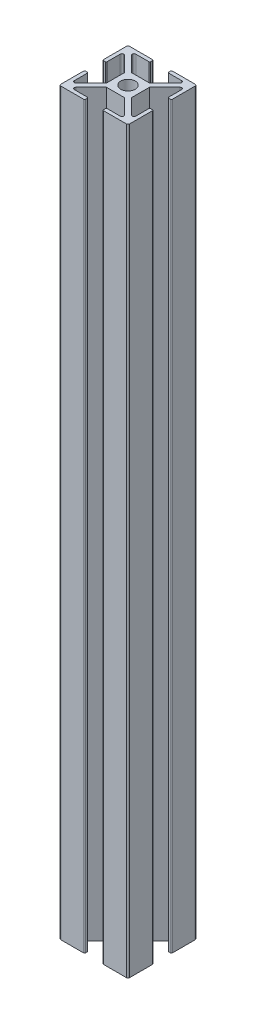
ISO-10303-21;
HEADER;
FILE_DESCRIPTION(('STEP AP214'),'2;1');
FILE_NAME('part.step','',(''),(''),'','','');
FILE_SCHEMA(('AUTOMOTIVE_DESIGN { 1 0 10303 214 1 1 1 1 }'));
ENDSEC;
DATA;
#1=APPLICATION_CONTEXT('core data for automotive mechanical design processes');
#2=APPLICATION_PROTOCOL_DEFINITION('international standard','automotive_design',2000,#1);
#3=PRODUCT_CONTEXT('',#1,'mechanical');
#4=PRODUCT('Part','Part','',(#3));
#5=PRODUCT_RELATED_PRODUCT_CATEGORY('part','',(#4));
#6=PRODUCT_DEFINITION_FORMATION('','',#4);
#7=PRODUCT_DEFINITION_CONTEXT('part definition',#1,'design');
#8=PRODUCT_DEFINITION('design','',#6,#7);
#9=PRODUCT_DEFINITION_SHAPE('','',#8);
#10=(LENGTH_UNIT() NAMED_UNIT(*) SI_UNIT(.MILLI.,.METRE.));
#11=(NAMED_UNIT(*) PLANE_ANGLE_UNIT() SI_UNIT($,.RADIAN.));
#12=(NAMED_UNIT(*) SI_UNIT($,.STERADIAN.) SOLID_ANGLE_UNIT());
#13=UNCERTAINTY_MEASURE_WITH_UNIT(LENGTH_MEASURE(1.E-05),#10,'distance_accuracy_value','');
#14=(GEOMETRIC_REPRESENTATION_CONTEXT(3) GLOBAL_UNCERTAINTY_ASSIGNED_CONTEXT((#13)) GLOBAL_UNIT_ASSIGNED_CONTEXT((#10,
#11,#12)) REPRESENTATION_CONTEXT('',''));
#15=CARTESIAN_POINT('',(0.,0.,0.));
#16=DIRECTION('',(0.,0.,1.));
#17=DIRECTION('',(1.,0.,0.));
#18=AXIS2_PLACEMENT_3D('',#15,#16,#17);
#19=CARTESIAN_POINT('',(0.,215.,0.));
#20=DIRECTION('',(0.,-1.,0.));
#21=DIRECTION('',(0.,0.,-1.));
#22=AXIS2_PLACEMENT_3D('',#19,#20,#21);
#23=CYLINDRICAL_SURFACE('',#22,2.095);
#24=CARTESIAN_POINT('',(0.,207.118007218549,-2.095));
#25=CARTESIAN_POINT('',(-0.0734690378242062,207.118022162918,-2.09499433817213));
#26=CARTESIAN_POINT('',(-0.147056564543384,207.124049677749,-2.09108660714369));
#27=CARTESIAN_POINT('',(-0.291808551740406,207.146897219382,-2.0758664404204));
#28=CARTESIAN_POINT('',(-0.362964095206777,207.163753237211,-2.06452930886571));
#29=CARTESIAN_POINT('',(-0.528618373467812,207.213579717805,-2.02960775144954));
#30=CARTESIAN_POINT('',(-0.621311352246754,207.250278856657,-2.00296220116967));
#31=CARTESIAN_POINT('',(-0.799048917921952,207.332044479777,-1.9389506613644));
#32=CARTESIAN_POINT('',(-0.88406687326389,207.37713855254,-1.90154909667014));
#33=CARTESIAN_POINT('',(-1.02472977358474,207.458176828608,-1.82849530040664));
#34=CARTESIAN_POINT('',(-1.08207673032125,207.49327585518,-1.79513158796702));
#35=CARTESIAN_POINT('',(-1.19307711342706,207.564164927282,-1.72335885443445));
#36=CARTESIAN_POINT('',(-1.24672890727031,207.599955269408,-1.68494762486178));
#37=CARTESIAN_POINT('',(-1.40202312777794,207.706720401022,-1.56229019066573));
#38=CARTESIAN_POINT('',(-1.49824875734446,207.77723919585,-1.47049275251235));
#39=CARTESIAN_POINT('',(-1.65500831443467,207.895807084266,-1.2888381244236));
#40=CARTESIAN_POINT('',(-1.71877253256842,207.945433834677,-1.20277635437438));
#41=CARTESIAN_POINT('',(-1.83382128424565,208.036419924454,-1.01874954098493));
#42=CARTESIAN_POINT('',(-1.88512607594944,208.077792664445,-0.920804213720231));
#43=CARTESIAN_POINT('',(-1.96498500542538,208.142772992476,-0.732412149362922));
#44=CARTESIAN_POINT('',(-1.9959442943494,208.168219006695,-0.643625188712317));
#45=CARTESIAN_POINT('',(-2.04593882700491,208.209458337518,-0.460585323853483));
#46=CARTESIAN_POINT('',(-2.064980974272,208.225257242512,-0.366335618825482));
#47=CARTESIAN_POINT('',(-2.08996840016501,208.245948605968,-0.174493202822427));
#48=CARTESIAN_POINT('',(-2.09585783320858,208.250794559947,-0.0768880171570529));
#49=CARTESIAN_POINT('',(-2.09393967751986,208.248992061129,0.118080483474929));
#50=CARTESIAN_POINT('',(-2.08613254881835,208.242343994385,0.215443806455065));
#51=CARTESIAN_POINT('',(-2.05839726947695,208.218991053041,0.40019759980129));
#52=CARTESIAN_POINT('',(-2.03933591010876,208.20300615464,0.487814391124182));
#53=CARTESIAN_POINT('',(-1.99091930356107,208.162728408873,0.658110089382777));
#54=CARTESIAN_POINT('',(-1.96156253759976,208.138434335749,0.740788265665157));
#55=CARTESIAN_POINT('',(-1.89100233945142,208.080639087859,0.90660295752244));
#56=CARTESIAN_POINT('',(-1.8490077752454,208.04653359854,0.989188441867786));
#57=CARTESIAN_POINT('',(-1.75606028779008,207.972209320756,1.14612986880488));
#58=CARTESIAN_POINT('',(-1.70509957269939,207.931985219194,1.22047856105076));
#59=CARTESIAN_POINT('',(-1.56902734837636,207.826807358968,1.39448720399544));
#60=CARTESIAN_POINT('',(-1.47930335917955,207.759287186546,1.48904696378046));
#61=CARTESIAN_POINT('',(-1.33408013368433,207.655654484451,1.61660816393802));
#62=CARTESIAN_POINT('',(-1.28381981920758,207.620666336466,1.65679613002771));
#63=CARTESIAN_POINT('',(-1.17979391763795,207.550760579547,1.7324084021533));
#64=CARTESIAN_POINT('',(-1.12602957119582,207.515842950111,1.76783438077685));
#65=CARTESIAN_POINT('',(-0.988193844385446,207.430483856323,1.84978176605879));
#66=CARTESIAN_POINT('',(-0.901998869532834,207.380666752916,1.89342767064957));
#67=CARTESIAN_POINT('',(-0.721322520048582,207.287995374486,1.96933401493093));
#68=CARTESIAN_POINT('',(-0.626865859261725,207.245121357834,2.0016270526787));
#69=CARTESIAN_POINT('',(-0.462814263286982,207.185715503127,2.04434808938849));
#70=CARTESIAN_POINT('',(-0.395673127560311,207.165182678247,2.05847715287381));
#71=CARTESIAN_POINT('',(-0.258308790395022,207.133063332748,2.08017090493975));
#72=CARTESIAN_POINT('',(-0.188093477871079,207.121455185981,2.08775146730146));
#73=CARTESIAN_POINT('',(-0.045682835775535,207.109239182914,2.09572181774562));
#74=CARTESIAN_POINT('',(0.0265237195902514,207.108718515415,2.09605461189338));
#75=CARTESIAN_POINT('',(0.169802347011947,207.119021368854,2.08934335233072));
#76=CARTESIAN_POINT('',(0.240872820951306,207.129859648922,2.08228970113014));
#77=CARTESIAN_POINT('',(0.396329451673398,207.164459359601,2.05900919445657));
#78=CARTESIAN_POINT('',(0.479876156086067,207.190676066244,2.04100353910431));
#79=CARTESIAN_POINT('',(0.641169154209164,207.252153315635,1.99624276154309));
#80=CARTESIAN_POINT('',(0.718894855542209,207.287444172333,1.96945822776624));
#81=CARTESIAN_POINT('',(0.853441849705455,207.355341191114,1.91437093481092));
#82=CARTESIAN_POINT('',(0.911312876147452,207.387048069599,1.88746946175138));
#83=CARTESIAN_POINT('',(1.02362320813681,207.452216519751,1.82899691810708));
#84=CARTESIAN_POINT('',(1.07806062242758,207.485679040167,1.79742330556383));
#85=CARTESIAN_POINT('',(1.23651095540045,207.587060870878,1.69583120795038));
#86=CARTESIAN_POINT('',(1.33562107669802,207.655952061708,1.61895849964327));
#87=CARTESIAN_POINT('',(1.5228332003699,207.791705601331,1.44459389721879));
#88=CARTESIAN_POINT('',(1.61051112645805,207.858443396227,1.34654825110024));
#89=CARTESIAN_POINT('',(1.76812400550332,207.981403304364,1.13154081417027));
#90=CARTESIAN_POINT('',(1.83811669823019,208.037659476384,1.01464267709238));
#91=CARTESIAN_POINT('',(1.93637458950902,208.117694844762,0.805073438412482));
#92=CARTESIAN_POINT('',(1.97079644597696,208.146074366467,0.717030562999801));
#93=CARTESIAN_POINT('',(2.02784115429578,208.193394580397,0.534767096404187));
#94=CARTESIAN_POINT('',(2.05047313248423,208.212342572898,0.44055134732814));
#95=CARTESIAN_POINT('',(2.08259361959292,208.239347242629,0.24782312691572));
#96=CARTESIAN_POINT('',(2.09201293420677,208.247346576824,0.149290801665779));
#97=CARTESIAN_POINT('',(2.09677143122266,208.251531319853,-0.0483673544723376));
#98=CARTESIAN_POINT('',(2.09211270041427,208.247718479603,-0.147493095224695));
#99=CARTESIAN_POINT('',(2.0700084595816,208.229424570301,-0.335111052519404));
#100=CARTESIAN_POINT('',(2.05361680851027,208.215822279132,-0.423819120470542));
#101=CARTESIAN_POINT('',(2.01019678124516,208.179957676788,-0.596729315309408));
#102=CARTESIAN_POINT('',(1.98316671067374,208.157693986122,-0.680930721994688));
#103=CARTESIAN_POINT('',(1.91772852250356,208.104254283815,-0.848496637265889));
#104=CARTESIAN_POINT('',(1.87870433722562,208.072600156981,-0.931464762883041));
#105=CARTESIAN_POINT('',(1.79163568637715,208.002930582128,-1.08960033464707));
#106=CARTESIAN_POINT('',(1.74358503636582,207.964910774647,-1.16476237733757));
#107=CARTESIAN_POINT('',(1.61489411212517,207.864991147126,-1.34093201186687));
#108=CARTESIAN_POINT('',(1.52967069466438,207.800378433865,-1.43706579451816));
#109=CARTESIAN_POINT('',(1.34503556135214,207.666773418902,-1.61123934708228));
#110=CARTESIAN_POINT('',(1.24559060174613,207.59777107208,-1.68923556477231));
#111=CARTESIAN_POINT('',(1.05247751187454,207.474317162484,-1.81440550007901));
#112=CARTESIAN_POINT('',(0.960995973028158,207.419483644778,-1.86460059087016));
#113=CARTESIAN_POINT('',(0.768405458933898,207.316697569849,-1.95184682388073));
#114=CARTESIAN_POINT('',(0.667324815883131,207.268725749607,-1.98893520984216));
#115=CARTESIAN_POINT('',(0.493687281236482,207.202934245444,-2.03720157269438));
#116=CARTESIAN_POINT('',(0.424170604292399,207.180498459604,-2.05289613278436));
#117=CARTESIAN_POINT('',(0.281678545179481,207.144992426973,-2.07722218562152));
#118=CARTESIAN_POINT('',(0.208717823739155,207.131885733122,-2.08588118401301));
#119=CARTESIAN_POINT('',(0.112612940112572,207.122445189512,-2.09209279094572));
#120=CARTESIAN_POINT('',(0.0901414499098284,207.120786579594,-2.09318085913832));
#121=CARTESIAN_POINT('',(0.0451170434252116,207.118565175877,-2.09463541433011));
#122=CARTESIAN_POINT('',(0.022564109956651,207.118002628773,-2.09500173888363));
#123=CARTESIAN_POINT('',(0.,207.118007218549,-2.095));
#124=B_SPLINE_CURVE_WITH_KNOTS('',3,(#24,#25,#26,#27,#28,#29,#30,#31,#32,#33,#34,#35,#36,#37,
#38,#39,#40,#41,#42,#43,#44,#45,#46,#47,#48,#49,#50,#51,#52,#53,#54,#55,#56,#57,#58,#59,#60,#61,
#62,#63,#64,#65,#66,#67,#68,#69,#70,#71,#72,#73,#74,#75,#76,#77,#78,#79,#80,#81,#82,#83,#84,#85,
#86,#87,#88,#89,#90,#91,#92,#93,#94,#95,#96,#97,#98,#99,#100,#101,#102,#103,#104,#105,#106,#107,
#108,#109,#110,#111,#112,#113,#114,#115,#116,#117,#118,#119,#120,#121,#122,#123),.UNSPECIFIED.,
.T.,.F.,(4,2,2,2,2,2,2,2,2,2,2,2,2,2,2,2,2,2,2,2,2,2,2,2,2,2,2,2,2,2,2,2,2,2,2,2,2,2,2,2,2,2,2,
2,2,2,2,2,2,4),(0.,0.220305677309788,0.44134740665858,0.749188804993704,1.05806032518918,
1.28296497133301,1.50796835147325,1.95704463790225,2.30993834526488,2.66225437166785,
2.9532788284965,3.24413454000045,3.53622287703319,3.8283014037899,4.10037546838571,
4.37248968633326,4.66758583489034,4.96293970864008,5.40082747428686,5.62040164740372,
5.83989849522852,6.16512799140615,6.48941586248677,6.70354810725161,6.91715982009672,
7.13245069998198,7.34802166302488,7.61471796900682,7.88231707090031,8.09582454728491,
8.30944861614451,8.73684395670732,9.17717777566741,9.61605483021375,9.9109942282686,
10.2057049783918,10.5019534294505,10.7981579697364,11.0706420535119,11.3431695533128,
11.6330902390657,11.9232102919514,12.3523517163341,12.7825132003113,13.1351825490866,
13.4868415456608,13.7102622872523,13.9328053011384,14.0004512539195,14.0681124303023),.UNSPECIFIED.);
#125=CARTESIAN_POINT('',(0.,207.118007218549,-2.095));
#126=VERTEX_POINT('',#125);
#127=EDGE_CURVE('E547',#126,#126,#124,.T.);
#128=ORIENTED_EDGE('',*,*,#127,.F.);
#129=EDGE_LOOP('',(#128));
#130=FACE_BOUND('',#129,.T.);
#131=CARTESIAN_POINT('',(0.,215.,0.));
#132=DIRECTION('',(0.,1.,0.));
#133=DIRECTION('',(0.,0.,1.));
#134=AXIS2_PLACEMENT_3D('',#131,#132,#133);
#135=CIRCLE('',#134,2.095);
#136=CARTESIAN_POINT('',(0.,215.,2.095));
#137=VERTEX_POINT('',#136);
#138=EDGE_CURVE('E783',#137,#137,#135,.T.);
#139=ORIENTED_EDGE('',*,*,#138,.T.);
#140=EDGE_LOOP('',(#139));
#141=FACE_BOUND('',#140,.T.);
#142=ADVANCED_FACE('F43',(#130,#141),#23,.F.);
#143=CARTESIAN_POINT('',(0.,215.,-3.66));
#144=DIRECTION('',(0.,0.,-1.));
#145=DIRECTION('',(-1.,0.,0.));
#146=AXIS2_PLACEMENT_3D('',#143,#144,#145);
#147=PLANE('',#146);
#148=DIRECTION('',(1.,0.,0.));
#149=VECTOR('',#148,1.);
#150=CARTESIAN_POINT('',(0.,0.,-3.66));
#151=LINE('',#150,#149);
#152=CARTESIAN_POINT('',(-2.59933982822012,0.,-3.66));
#153=VERTEX_POINT('',#152);
#154=CARTESIAN_POINT('',(2.59933982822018,0.,-3.66));
#155=VERTEX_POINT('',#154);
#156=EDGE_CURVE('E857',#153,#155,#151,.T.);
#157=ORIENTED_EDGE('',*,*,#156,.F.);
#158=DIRECTION('',(0.,-1.,0.));
#159=VECTOR('',#158,1.);
#160=CARTESIAN_POINT('',(-2.59933982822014,215.,-3.66000000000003));
#161=LINE('',#160,#159);
#162=CARTESIAN_POINT('',(-2.59933982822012,215.,-3.66));
#163=VERTEX_POINT('',#162);
#164=EDGE_CURVE('E601',#163,#153,#161,.T.);
#165=ORIENTED_EDGE('',*,*,#164,.F.);
#166=DIRECTION('',(1.,0.,0.));
#167=VECTOR('',#166,1.);
#168=CARTESIAN_POINT('',(0.,215.,-3.66));
#169=LINE('',#168,#167);
#170=CARTESIAN_POINT('',(2.59933982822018,215.,-3.66));
#171=VERTEX_POINT('',#170);
#172=EDGE_CURVE('E808',#163,#171,#169,.T.);
#173=ORIENTED_EDGE('',*,*,#172,.T.);
#174=DIRECTION('',(0.,-1.,0.));
#175=VECTOR('',#174,1.);
#176=CARTESIAN_POINT('',(2.59933982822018,215.,-3.66));
#177=LINE('',#176,#175);
#178=EDGE_CURVE('E884',#171,#155,#177,.T.);
#179=ORIENTED_EDGE('',*,*,#178,.T.);
#180=EDGE_LOOP('',(#157,#165,#173,#179));
#181=FACE_BOUND('',#180,.T.);
#182=ADVANCED_FACE('F1406',(#181),#147,.T.);
#183=CARTESIAN_POINT('',(-3.66,215.,0.));
#184=DIRECTION('',(-1.,0.,0.));
#185=DIRECTION('',(0.,0.,1.));
#186=AXIS2_PLACEMENT_3D('',#183,#184,#185);
#187=PLANE('',#186);
#188=CARTESIAN_POINT('',(-3.66,205.750000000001,-0.0024999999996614));
#189=DIRECTION('',(-1.,0.,0.));
#190=DIRECTION('',(0.,0.,1.));
#191=AXIS2_PLACEMENT_3D('',#188,#189,#190);
#192=CIRCLE('',#191,2.5);
#193=CARTESIAN_POINT('',(-3.66,205.750000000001,2.49750000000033));
#194=VERTEX_POINT('',#193);
#195=CARTESIAN_POINT('',(-3.66,205.750000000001,-2.50249999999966));
#196=VERTEX_POINT('',#195);
#197=EDGE_CURVE('E552',#194,#196,#192,.T.);
#198=ORIENTED_EDGE('',*,*,#197,.F.);
#199=DIRECTION('',(0.,1.,0.));
#200=VECTOR('',#199,1.);
#201=CARTESIAN_POINT('',(-3.66,215.,2.49750000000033));
#202=LINE('',#201,#200);
#203=CARTESIAN_POINT('',(-3.66,200.750000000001,2.49750000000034));
#204=VERTEX_POINT('',#203);
#205=EDGE_CURVE('E561',#204,#194,#202,.T.);
#206=ORIENTED_EDGE('',*,*,#205,.F.);
#207=CARTESIAN_POINT('',(-3.66,200.750000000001,-0.00249999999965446));
#208=DIRECTION('',(-1.,0.,0.));
#209=DIRECTION('',(0.,0.,1.));
#210=AXIS2_PLACEMENT_3D('',#207,#208,#209);
#211=CIRCLE('',#210,2.5);
#212=CARTESIAN_POINT('',(-3.66,200.750000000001,-2.50249999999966));
#213=VERTEX_POINT('',#212);
#214=EDGE_CURVE('E544',#213,#204,#211,.T.);
#215=ORIENTED_EDGE('',*,*,#214,.F.);
#216=DIRECTION('',(0.,-1.,0.));
#217=VECTOR('',#216,1.);
#218=CARTESIAN_POINT('',(-3.66,215.,-2.50249999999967));
#219=LINE('',#218,#217);
#220=EDGE_CURVE('E564',#196,#213,#219,.T.);
#221=ORIENTED_EDGE('',*,*,#220,.F.);
#222=EDGE_LOOP('',(#198,#206,#215,#221));
#223=FACE_BOUND('',#222,.T.);
#224=CARTESIAN_POINT('',(-3.66,14.2500000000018,-0.00250000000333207));
#225=DIRECTION('',(-1.,0.,0.));
#226=DIRECTION('',(0.,0.,1.));
#227=AXIS2_PLACEMENT_3D('',#224,#225,#226);
#228=CIRCLE('',#227,2.5);
#229=CARTESIAN_POINT('',(-3.66,14.2500000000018,2.49749999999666));
#230=VERTEX_POINT('',#229);
#231=CARTESIAN_POINT('',(-3.66,14.2500000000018,-2.50250000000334));
#232=VERTEX_POINT('',#231);
#233=EDGE_CURVE('E536',#230,#232,#228,.T.);
#234=ORIENTED_EDGE('',*,*,#233,.F.);
#235=DIRECTION('',(0.,1.,0.));
#236=VECTOR('',#235,1.);
#237=CARTESIAN_POINT('',(-3.66,215.,2.49749999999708));
#238=LINE('',#237,#236);
#239=CARTESIAN_POINT('',(-3.66,9.25000000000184,2.49749999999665));
#240=VERTEX_POINT('',#239);
#241=EDGE_CURVE('E555',#240,#230,#238,.T.);
#242=ORIENTED_EDGE('',*,*,#241,.F.);
#243=CARTESIAN_POINT('',(-3.66,9.25000000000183,-0.00250000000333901));
#244=DIRECTION('',(-1.,0.,0.));
#245=DIRECTION('',(0.,0.,1.));
#246=AXIS2_PLACEMENT_3D('',#243,#244,#245);
#247=CIRCLE('',#246,2.5);
#248=CARTESIAN_POINT('',(-3.66,9.25000000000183,-2.50250000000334));
#249=VERTEX_POINT('',#248);
#250=EDGE_CURVE('E510',#249,#240,#247,.T.);
#251=ORIENTED_EDGE('',*,*,#250,.F.);
#252=DIRECTION('',(0.,-1.,0.));
#253=VECTOR('',#252,1.);
#254=CARTESIAN_POINT('',(-3.66,215.,-2.5025000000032));
#255=LINE('',#254,#253);
#256=EDGE_CURVE('E558',#232,#249,#255,.T.);
#257=ORIENTED_EDGE('',*,*,#256,.F.);
#258=EDGE_LOOP('',(#234,#242,#251,#257));
#259=FACE_BOUND('',#258,.T.);
#260=DIRECTION('',(0.,0.,-1.));
#261=VECTOR('',#260,1.);
#262=CARTESIAN_POINT('',(-3.66,0.,0.));
#263=LINE('',#262,#261);
#264=CARTESIAN_POINT('',(-3.66000000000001,0.,2.59933982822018));
#265=VERTEX_POINT('',#264);
#266=CARTESIAN_POINT('',(-3.66,0.,-2.59933982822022));
#267=VERTEX_POINT('',#266);
#268=EDGE_CURVE('E860',#265,#267,#263,.T.);
#269=ORIENTED_EDGE('',*,*,#268,.F.);
#270=DIRECTION('',(0.,-1.,0.));
#271=VECTOR('',#270,1.);
#272=CARTESIAN_POINT('',(-3.66,215.,2.59933982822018));
#273=LINE('',#272,#271);
#274=CARTESIAN_POINT('',(-3.66000000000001,215.,2.59933982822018));
#275=VERTEX_POINT('',#274);
#276=EDGE_CURVE('E672',#275,#265,#273,.T.);
#277=ORIENTED_EDGE('',*,*,#276,.F.);
#278=DIRECTION('',(0.,0.,-1.));
#279=VECTOR('',#278,1.);
#280=CARTESIAN_POINT('',(-3.66,215.,0.));
#281=LINE('',#280,#279);
#282=CARTESIAN_POINT('',(-3.66,215.,-2.59933982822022));
#283=VERTEX_POINT('',#282);
#284=EDGE_CURVE('E811',#275,#283,#281,.T.);
#285=ORIENTED_EDGE('',*,*,#284,.T.);
#286=DIRECTION('',(0.,-1.,0.));
#287=VECTOR('',#286,1.);
#288=CARTESIAN_POINT('',(-3.65999999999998,215.,-2.59933982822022));
#289=LINE('',#288,#287);
#290=EDGE_CURVE('E635',#283,#267,#289,.T.);
#291=ORIENTED_EDGE('',*,*,#290,.T.);
#292=EDGE_LOOP('',(#269,#277,#285,#291));
#293=FACE_BOUND('',#292,.T.);
#294=ADVANCED_FACE('F1402',(#223,#259,#293),#187,.T.);
#295=CARTESIAN_POINT('',(0.,215.,3.66));
#296=DIRECTION('',(0.,0.,-1.));
#297=DIRECTION('',(-1.,0.,0.));
#298=AXIS2_PLACEMENT_3D('',#295,#296,#297);
#299=PLANE('',#298);
#300=DIRECTION('',(0.,-1.,0.));
#301=VECTOR('',#300,1.);
#302=CARTESIAN_POINT('',(2.59933982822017,215.,3.66000000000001));
#303=LINE('',#302,#301);
#304=CARTESIAN_POINT('',(2.59933982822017,215.,3.66));
#305=VERTEX_POINT('',#304);
#306=CARTESIAN_POINT('',(2.59933982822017,0.,3.66));
#307=VERTEX_POINT('',#306);
#308=EDGE_CURVE('E744',#305,#307,#303,.T.);
#309=ORIENTED_EDGE('',*,*,#308,.F.);
#310=DIRECTION('',(1.,0.,0.));
#311=VECTOR('',#310,1.);
#312=CARTESIAN_POINT('',(0.,215.,3.66));
#313=LINE('',#312,#311);
#314=CARTESIAN_POINT('',(-2.59933982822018,215.,3.65999999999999));
#315=VERTEX_POINT('',#314);
#316=EDGE_CURVE('E814',#315,#305,#313,.T.);
#317=ORIENTED_EDGE('',*,*,#316,.F.);
#318=DIRECTION('',(0.,-1.,0.));
#319=VECTOR('',#318,1.);
#320=CARTESIAN_POINT('',(-2.59933982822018,215.,3.66));
#321=LINE('',#320,#319);
#322=CARTESIAN_POINT('',(-2.59933982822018,0.,3.66));
#323=VERTEX_POINT('',#322);
#324=EDGE_CURVE('E706',#315,#323,#321,.T.);
#325=ORIENTED_EDGE('',*,*,#324,.T.);
#326=DIRECTION('',(1.,0.,0.));
#327=VECTOR('',#326,1.);
#328=CARTESIAN_POINT('',(0.,0.,3.66));
#329=LINE('',#328,#327);
#330=EDGE_CURVE('E864',#323,#307,#329,.T.);
#331=ORIENTED_EDGE('',*,*,#330,.T.);
#332=EDGE_LOOP('',(#309,#317,#325,#331));
#333=FACE_BOUND('',#332,.T.);
#334=ADVANCED_FACE('F1398',(#333),#299,.F.);
#335=CARTESIAN_POINT('',(10.,215.,0.));
#336=DIRECTION('',(1.,0.,0.));
#337=DIRECTION('',(0.,0.,-1.));
#338=AXIS2_PLACEMENT_3D('',#335,#336,#337);
#339=PLANE('',#338);
#340=DIRECTION('',(0.,0.,1.));
#341=VECTOR('',#340,1.);
#342=CARTESIAN_POINT('',(10.,215.,0.));
#343=LINE('',#342,#341);
#344=CARTESIAN_POINT('',(10.,215.,-9.50000000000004));
#345=VERTEX_POINT('',#344);
#346=CARTESIAN_POINT('',(10.,215.,-2.88));
#347=VERTEX_POINT('',#346);
#348=EDGE_CURVE('E787',#345,#347,#343,.T.);
#349=ORIENTED_EDGE('',*,*,#348,.T.);
#350=DIRECTION('',(0.,-1.,0.));
#351=VECTOR('',#350,1.);
#352=CARTESIAN_POINT('',(10.,0.,-2.88));
#353=LINE('',#352,#351);
#354=CARTESIAN_POINT('',(10.,0.,-2.88));
#355=VERTEX_POINT('',#354);
#356=EDGE_CURVE('E975',#347,#355,#353,.T.);
#357=ORIENTED_EDGE('',*,*,#356,.T.);
#358=DIRECTION('',(0.,0.,1.));
#359=VECTOR('',#358,1.);
#360=CARTESIAN_POINT('',(10.,0.,0.));
#361=LINE('',#360,#359);
#362=CARTESIAN_POINT('',(10.,0.,-9.50000000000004));
#363=VERTEX_POINT('',#362);
#364=EDGE_CURVE('E837',#363,#355,#361,.T.);
#365=ORIENTED_EDGE('',*,*,#364,.F.);
#366=DIRECTION('',(0.,-1.,0.));
#367=VECTOR('',#366,1.);
#368=CARTESIAN_POINT('',(10.,215.,-9.50000000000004));
#369=LINE('',#368,#367);
#370=EDGE_CURVE('E909',#363,#345,#369,.F.);
#371=ORIENTED_EDGE('',*,*,#370,.T.);
#372=EDGE_LOOP('',(#349,#357,#365,#371));
#373=FACE_BOUND('',#372,.T.);
#374=ADVANCED_FACE('F1401',(#373),#339,.T.);
#375=CARTESIAN_POINT('',(0.,215.,-10.));
#376=DIRECTION('',(0.,0.,1.));
#377=DIRECTION('',(1.,0.,0.));
#378=AXIS2_PLACEMENT_3D('',#375,#376,#377);
#379=PLANE('',#378);
#380=DIRECTION('',(-1.,0.,0.));
#381=VECTOR('',#380,1.);
#382=CARTESIAN_POINT('',(0.,0.,-10.));
#383=LINE('',#382,#381);
#384=CARTESIAN_POINT('',(9.50000000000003,0.,-10.));
#385=VERTEX_POINT('',#384);
#386=CARTESIAN_POINT('',(2.88,0.,-10.));
#387=VERTEX_POINT('',#386);
#388=EDGE_CURVE('E841',#385,#387,#383,.T.);
#389=ORIENTED_EDGE('',*,*,#388,.T.);
#390=DIRECTION('',(0.,-1.,0.));
#391=VECTOR('',#390,1.);
#392=CARTESIAN_POINT('',(2.88,215.,-10.));
#393=LINE('',#392,#391);
#394=CARTESIAN_POINT('',(2.88,215.,-10.));
#395=VERTEX_POINT('',#394);
#396=EDGE_CURVE('E946',#387,#395,#393,.F.);
#397=ORIENTED_EDGE('',*,*,#396,.T.);
#398=DIRECTION('',(-1.,0.,0.));
#399=VECTOR('',#398,1.);
#400=CARTESIAN_POINT('',(0.,215.,-10.));
#401=LINE('',#400,#399);
#402=CARTESIAN_POINT('',(9.50000000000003,215.,-10.));
#403=VERTEX_POINT('',#402);
#404=EDGE_CURVE('E792',#403,#395,#401,.T.);
#405=ORIENTED_EDGE('',*,*,#404,.F.);
#406=DIRECTION('',(0.,-1.,0.));
#407=VECTOR('',#406,1.);
#408=CARTESIAN_POINT('',(9.50000000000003,0.,-10.));
#409=LINE('',#408,#407);
#410=EDGE_CURVE('E902',#403,#385,#409,.T.);
#411=ORIENTED_EDGE('',*,*,#410,.T.);
#412=EDGE_LOOP('',(#389,#397,#405,#411));
#413=FACE_BOUND('',#412,.T.);
#414=ADVANCED_FACE('F1421',(#413),#379,.F.);
#415=CARTESIAN_POINT('',(2.63,215.,0.));
#416=DIRECTION('',(-1.,0.,0.));
#417=DIRECTION('',(0.,0.,1.));
#418=AXIS2_PLACEMENT_3D('',#415,#416,#417);
#419=PLANE('',#418);
#420=DIRECTION('',(0.,0.,-1.));
#421=VECTOR('',#420,1.);
#422=CARTESIAN_POINT('',(2.63,215.,0.));
#423=LINE('',#422,#421);
#424=CARTESIAN_POINT('',(2.63,215.,-9.18933982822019));
#425=VERTEX_POINT('',#424);
#426=CARTESIAN_POINT('',(2.63,215.,-9.75000000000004));
#427=VERTEX_POINT('',#426);
#428=EDGE_CURVE('E796',#425,#427,#423,.T.);
#429=ORIENTED_EDGE('',*,*,#428,.T.);
#430=DIRECTION('',(0.,-1.,0.));
#431=VECTOR('',#430,1.);
#432=CARTESIAN_POINT('',(2.63,0.,-9.75000000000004));
#433=LINE('',#432,#431);
#434=CARTESIAN_POINT('',(2.63,0.,-9.75000000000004));
#435=VERTEX_POINT('',#434);
#436=EDGE_CURVE('E930',#427,#435,#433,.T.);
#437=ORIENTED_EDGE('',*,*,#436,.T.);
#438=DIRECTION('',(0.,0.,-1.));
#439=VECTOR('',#438,1.);
#440=CARTESIAN_POINT('',(2.63,0.,0.));
#441=LINE('',#440,#439);
#442=CARTESIAN_POINT('',(2.63,0.,-9.18933982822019));
#443=VERTEX_POINT('',#442);
#444=EDGE_CURVE('E845',#443,#435,#441,.T.);
#445=ORIENTED_EDGE('',*,*,#444,.F.);
#446=DIRECTION('',(0.,-1.,0.));
#447=VECTOR('',#446,1.);
#448=CARTESIAN_POINT('',(2.63,215.,-9.18933982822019));
#449=LINE('',#448,#447);
#450=EDGE_CURVE('E927',#443,#425,#449,.F.);
#451=ORIENTED_EDGE('',*,*,#450,.T.);
#452=EDGE_LOOP('',(#429,#437,#445,#451));
#453=FACE_BOUND('',#452,.T.);
#454=ADVANCED_FACE('F1417',(#453),#419,.T.);
#455=CARTESIAN_POINT('',(0.,215.,-8.93933982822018));
#456=DIRECTION('',(0.,0.,1.));
#457=DIRECTION('',(1.,0.,0.));
#458=AXIS2_PLACEMENT_3D('',#455,#456,#457);
#459=PLANE('',#458);
#460=DIRECTION('',(-1.,0.,0.));
#461=VECTOR('',#460,1.);
#462=CARTESIAN_POINT('',(0.,215.,-8.93933982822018));
#463=LINE('',#462,#461);
#464=CARTESIAN_POINT('',(6.67157287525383,215.,-8.93933982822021));
#465=VERTEX_POINT('',#464);
#466=CARTESIAN_POINT('',(2.88,215.,-8.93933982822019));
#467=VERTEX_POINT('',#466);
#468=EDGE_CURVE('E800',#465,#467,#463,.T.);
#469=ORIENTED_EDGE('',*,*,#468,.T.);
#470=DIRECTION('',(0.,-1.,0.));
#471=VECTOR('',#470,1.);
#472=CARTESIAN_POINT('',(2.88,215.,-8.93933982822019));
#473=LINE('',#472,#471);
#474=CARTESIAN_POINT('',(2.88,0.,-8.93933982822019));
#475=VERTEX_POINT('',#474);
#476=EDGE_CURVE('E961',#467,#475,#473,.T.);
#477=ORIENTED_EDGE('',*,*,#476,.T.);
#478=DIRECTION('',(-1.,0.,0.));
#479=VECTOR('',#478,1.);
#480=CARTESIAN_POINT('',(0.,0.,-8.93933982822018));
#481=LINE('',#480,#479);
#482=CARTESIAN_POINT('',(6.67157287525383,0.,-8.93933982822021));
#483=VERTEX_POINT('',#482);
#484=EDGE_CURVE('E849',#483,#475,#481,.T.);
#485=ORIENTED_EDGE('',*,*,#484,.F.);
#486=DIRECTION('',(0.,-1.,0.));
#487=VECTOR('',#486,1.);
#488=CARTESIAN_POINT('',(6.67157287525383,215.,-8.93933982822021));
#489=LINE('',#488,#487);
#490=EDGE_CURVE('E892',#483,#465,#489,.F.);
#491=ORIENTED_EDGE('',*,*,#490,.T.);
#492=EDGE_LOOP('',(#469,#477,#485,#491));
#493=FACE_BOUND('',#492,.T.);
#494=ADVANCED_FACE('F1413',(#493),#459,.T.);
#495=CARTESIAN_POINT('',(-0.530330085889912,215.,-0.530330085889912));
#496=DIRECTION('',(-0.707106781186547,0.,-0.707106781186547));
#497=DIRECTION('',(-0.707106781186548,0.,0.707106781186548));
#498=AXIS2_PLACEMENT_3D('',#495,#496,#497);
#499=PLANE('',#498);
#500=DIRECTION('',(0.707106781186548,0.,-0.707106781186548));
#501=VECTOR('',#500,1.);
#502=CARTESIAN_POINT('',(-0.530330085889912,215.,-0.530330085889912));
#503=LINE('',#502,#501);
#504=CARTESIAN_POINT('',(7.02512626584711,215.,-8.08578643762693));
#505=VERTEX_POINT('',#504);
#506=EDGE_CURVE('E804',#171,#505,#503,.T.);
#507=ORIENTED_EDGE('',*,*,#506,.T.);
#508=DIRECTION('',(0.,-1.,0.));
#509=VECTOR('',#508,1.);
#510=CARTESIAN_POINT('',(7.02512626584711,0.,-8.08578643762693));
#511=LINE('',#510,#509);
#512=CARTESIAN_POINT('',(7.02512626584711,0.,-8.08578643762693));
#513=VERTEX_POINT('',#512);
#514=EDGE_CURVE('E888',#505,#513,#511,.T.);
#515=ORIENTED_EDGE('',*,*,#514,.T.);
#516=DIRECTION('',(0.707106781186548,0.,-0.707106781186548));
#517=VECTOR('',#516,1.);
#518=CARTESIAN_POINT('',(-0.530330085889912,0.,-0.530330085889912));
#519=LINE('',#518,#517);
#520=EDGE_CURVE('E853',#155,#513,#519,.T.);
#521=ORIENTED_EDGE('',*,*,#520,.F.);
#522=ORIENTED_EDGE('',*,*,#178,.F.);
#523=EDGE_LOOP('',(#507,#515,#521,#522));
#524=FACE_BOUND('',#523,.T.);
#525=ADVANCED_FACE('F1396',(#524),#499,.T.);
#526=CARTESIAN_POINT('',(3.66,215.,0.));
#527=DIRECTION('',(-1.,0.,0.));
#528=DIRECTION('',(0.,0.,1.));
#529=AXIS2_PLACEMENT_3D('',#526,#527,#528);
#530=PLANE('',#529);
#531=DIRECTION('',(0.,1.,0.));
#532=VECTOR('',#531,1.);
#533=CARTESIAN_POINT('',(3.66,215.,2.49750000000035));
#534=LINE('',#533,#532);
#535=CARTESIAN_POINT('',(3.66,200.750000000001,2.49750000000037));
#536=VERTEX_POINT('',#535);
#537=CARTESIAN_POINT('',(3.66,205.750000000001,2.49750000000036));
#538=VERTEX_POINT('',#537);
#539=EDGE_CURVE('E52',#536,#538,#534,.T.);
#540=ORIENTED_EDGE('',*,*,#539,.T.);
#541=CARTESIAN_POINT('',(3.66,205.750000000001,-0.00249999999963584));
#542=DIRECTION('',(-1.,0.,0.));
#543=DIRECTION('',(0.,0.,1.));
#544=AXIS2_PLACEMENT_3D('',#541,#542,#543);
#545=CIRCLE('',#544,2.5);
#546=CARTESIAN_POINT('',(3.66,205.750000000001,-2.50249999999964));
#547=VERTEX_POINT('',#546);
#548=EDGE_CURVE('E548',#538,#547,#545,.T.);
#549=ORIENTED_EDGE('',*,*,#548,.T.);
#550=DIRECTION('',(0.,-1.,0.));
#551=VECTOR('',#550,1.);
#552=CARTESIAN_POINT('',(3.66,215.,-2.50249999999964));
#553=LINE('',#552,#551);
#554=CARTESIAN_POINT('',(3.66,200.750000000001,-2.50249999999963));
#555=VERTEX_POINT('',#554);
#556=EDGE_CURVE('E11',#547,#555,#553,.T.);
#557=ORIENTED_EDGE('',*,*,#556,.T.);
#558=CARTESIAN_POINT('',(3.66,200.750000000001,-0.0024999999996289));
#559=DIRECTION('',(-1.,0.,0.));
#560=DIRECTION('',(0.,0.,1.));
#561=AXIS2_PLACEMENT_3D('',#558,#559,#560);
#562=CIRCLE('',#561,2.5);
#563=EDGE_CURVE('E540',#555,#536,#562,.T.);
#564=ORIENTED_EDGE('',*,*,#563,.T.);
#565=EDGE_LOOP('',(#540,#549,#557,#564));
#566=FACE_BOUND('',#565,.T.);
#567=DIRECTION('',(0.,1.,0.));
#568=VECTOR('',#567,1.);
#569=CARTESIAN_POINT('',(3.66,215.,2.4974999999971));
#570=LINE('',#569,#568);
#571=CARTESIAN_POINT('',(3.66,9.25000000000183,2.49749999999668));
#572=VERTEX_POINT('',#571);
#573=CARTESIAN_POINT('',(3.66,14.2500000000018,2.49749999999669));
#574=VERTEX_POINT('',#573);
#575=EDGE_CURVE('E491',#572,#574,#570,.T.);
#576=ORIENTED_EDGE('',*,*,#575,.T.);
#577=CARTESIAN_POINT('',(3.66,14.2500000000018,-0.00250000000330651));
#578=DIRECTION('',(-1.,0.,0.));
#579=DIRECTION('',(0.,0.,1.));
#580=AXIS2_PLACEMENT_3D('',#577,#578,#579);
#581=CIRCLE('',#580,2.5);
#582=CARTESIAN_POINT('',(3.66,14.2500000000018,-2.50250000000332));
#583=VERTEX_POINT('',#582);
#584=EDGE_CURVE('E533',#574,#583,#581,.T.);
#585=ORIENTED_EDGE('',*,*,#584,.T.);
#586=DIRECTION('',(0.,-1.,0.));
#587=VECTOR('',#586,1.);
#588=CARTESIAN_POINT('',(3.66,215.,-2.50250000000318));
#589=LINE('',#588,#587);
#590=CARTESIAN_POINT('',(3.66,9.25000000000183,-2.50250000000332));
#591=VERTEX_POINT('',#590);
#592=EDGE_CURVE('E500',#583,#591,#589,.T.);
#593=ORIENTED_EDGE('',*,*,#592,.T.);
#594=CARTESIAN_POINT('',(3.66,9.25000000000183,-0.00250000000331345));
#595=DIRECTION('',(-1.,0.,0.));
#596=DIRECTION('',(0.,0.,1.));
#597=AXIS2_PLACEMENT_3D('',#594,#595,#596);
#598=CIRCLE('',#597,2.5);
#599=EDGE_CURVE('E507',#591,#572,#598,.T.);
#600=ORIENTED_EDGE('',*,*,#599,.T.);
#601=EDGE_LOOP('',(#576,#585,#593,#600));
#602=FACE_BOUND('',#601,.T.);
#603=DIRECTION('',(0.,0.,-1.));
#604=VECTOR('',#603,1.);
#605=CARTESIAN_POINT('',(3.66,215.,0.));
#606=LINE('',#605,#604);
#607=CARTESIAN_POINT('',(3.66,215.,2.59933982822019));
#608=VERTEX_POINT('',#607);
#609=CARTESIAN_POINT('',(3.66,215.,-2.59933982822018));
#610=VERTEX_POINT('',#609);
#611=EDGE_CURVE('E818',#608,#610,#606,.T.);
#612=ORIENTED_EDGE('',*,*,#611,.F.);
#613=DIRECTION('',(0.,-1.,0.));
#614=VECTOR('',#613,1.);
#615=CARTESIAN_POINT('',(3.65999999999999,215.,2.59933982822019));
#616=LINE('',#615,#614);
#617=CARTESIAN_POINT('',(3.65999999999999,0.,2.59933982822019));
#618=VERTEX_POINT('',#617);
#619=EDGE_CURVE('E778',#608,#618,#616,.T.);
#620=ORIENTED_EDGE('',*,*,#619,.T.);
#621=DIRECTION('',(0.,0.,-1.));
#622=VECTOR('',#621,1.);
#623=CARTESIAN_POINT('',(3.66,0.,0.));
#624=LINE('',#623,#622);
#625=CARTESIAN_POINT('',(3.66,0.,-2.59933982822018));
#626=VERTEX_POINT('',#625);
#627=EDGE_CURVE('E867',#618,#626,#624,.T.);
#628=ORIENTED_EDGE('',*,*,#627,.T.);
#629=DIRECTION('',(0.,-1.,0.));
#630=VECTOR('',#629,1.);
#631=CARTESIAN_POINT('',(3.66,215.,-2.59933982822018));
#632=LINE('',#631,#630);
#633=EDGE_CURVE('E833',#610,#626,#632,.T.);
#634=ORIENTED_EDGE('',*,*,#633,.F.);
#635=EDGE_LOOP('',(#612,#620,#628,#634));
#636=FACE_BOUND('',#635,.T.);
#637=ADVANCED_FACE('F516',(#566,#602,#636),#530,.F.);
#638=CARTESIAN_POINT('',(0.53033008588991,215.,0.53033008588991));
#639=DIRECTION('',(-0.707106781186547,0.,-0.707106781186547));
#640=DIRECTION('',(-0.707106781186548,0.,0.707106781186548));
#641=AXIS2_PLACEMENT_3D('',#638,#639,#640);
#642=PLANE('',#641);
#643=DIRECTION('',(0.707106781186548,0.,-0.707106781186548));
#644=VECTOR('',#643,1.);
#645=CARTESIAN_POINT('',(0.53033008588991,0.,0.53033008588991));
#646=LINE('',#645,#644);
#647=CARTESIAN_POINT('',(8.08578643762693,0.,-7.02512626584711));
#648=VERTEX_POINT('',#647);
#649=EDGE_CURVE('E870',#626,#648,#646,.T.);
#650=ORIENTED_EDGE('',*,*,#649,.T.);
#651=DIRECTION('',(0.,-1.,0.));
#652=VECTOR('',#651,1.);
#653=CARTESIAN_POINT('',(8.08578643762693,215.,-7.02512626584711));
#654=LINE('',#653,#652);
#655=CARTESIAN_POINT('',(8.08578643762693,215.,-7.02512626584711));
#656=VERTEX_POINT('',#655);
#657=EDGE_CURVE('E899',#648,#656,#654,.F.);
#658=ORIENTED_EDGE('',*,*,#657,.T.);
#659=DIRECTION('',(0.707106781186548,0.,-0.707106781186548));
#660=VECTOR('',#659,1.);
#661=CARTESIAN_POINT('',(0.53033008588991,215.,0.53033008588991));
#662=LINE('',#661,#660);
#663=EDGE_CURVE('E821',#610,#656,#662,.T.);
#664=ORIENTED_EDGE('',*,*,#663,.F.);
#665=ORIENTED_EDGE('',*,*,#633,.T.);
#666=EDGE_LOOP('',(#650,#658,#664,#665));
#667=FACE_BOUND('',#666,.T.);
#668=ADVANCED_FACE('F1389',(#667),#642,.F.);
#669=CARTESIAN_POINT('',(8.93933982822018,215.,0.));
#670=DIRECTION('',(1.,0.,0.));
#671=DIRECTION('',(0.,0.,-1.));
#672=AXIS2_PLACEMENT_3D('',#669,#670,#671);
#673=PLANE('',#672);
#674=DIRECTION('',(0.,0.,1.));
#675=VECTOR('',#674,1.);
#676=CARTESIAN_POINT('',(8.93933982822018,0.,0.));
#677=LINE('',#676,#675);
#678=CARTESIAN_POINT('',(8.9393398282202,0.,-6.67157287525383));
#679=VERTEX_POINT('',#678);
#680=CARTESIAN_POINT('',(8.93933982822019,0.,-2.88000000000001));
#681=VERTEX_POINT('',#680);
#682=EDGE_CURVE('E874',#679,#681,#677,.T.);
#683=ORIENTED_EDGE('',*,*,#682,.T.);
#684=DIRECTION('',(0.,-1.,0.));
#685=VECTOR('',#684,1.);
#686=CARTESIAN_POINT('',(8.93933982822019,215.,-2.88000000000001));
#687=LINE('',#686,#685);
#688=CARTESIAN_POINT('',(8.93933982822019,215.,-2.88000000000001));
#689=VERTEX_POINT('',#688);
#690=EDGE_CURVE('E972',#681,#689,#687,.F.);
#691=ORIENTED_EDGE('',*,*,#690,.T.);
#692=DIRECTION('',(0.,0.,1.));
#693=VECTOR('',#692,1.);
#694=CARTESIAN_POINT('',(8.93933982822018,215.,0.));
#695=LINE('',#694,#693);
#696=CARTESIAN_POINT('',(8.9393398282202,215.,-6.67157287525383));
#697=VERTEX_POINT('',#696);
#698=EDGE_CURVE('E825',#697,#689,#695,.T.);
#699=ORIENTED_EDGE('',*,*,#698,.F.);
#700=DIRECTION('',(0.,-1.,0.));
#701=VECTOR('',#700,1.);
#702=CARTESIAN_POINT('',(8.9393398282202,0.,-6.67157287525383));
#703=LINE('',#702,#701);
#704=EDGE_CURVE('E895',#697,#679,#703,.T.);
#705=ORIENTED_EDGE('',*,*,#704,.T.);
#706=EDGE_LOOP('',(#683,#691,#699,#705));
#707=FACE_BOUND('',#706,.T.);
#708=ADVANCED_FACE('F1386',(#707),#673,.F.);
#709=CARTESIAN_POINT('',(0.,7.88199278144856,-2.095));
#710=CARTESIAN_POINT('',(0.0734690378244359,7.88197783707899,-2.09499433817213));
#711=CARTESIAN_POINT('',(0.147056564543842,7.87595032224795,-2.09108660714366));
#712=CARTESIAN_POINT('',(0.291808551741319,7.85310278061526,-2.07586644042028));
#713=CARTESIAN_POINT('',(0.362964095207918,7.83624676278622,-2.06452930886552));
#714=CARTESIAN_POINT('',(0.528618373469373,7.78642028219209,-2.02960775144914));
#715=CARTESIAN_POINT('',(0.621311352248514,7.74972114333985,-2.00296220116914));
#716=CARTESIAN_POINT('',(0.799048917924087,7.66795552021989,-1.93895066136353));
#717=CARTESIAN_POINT('',(0.884066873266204,7.6228614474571,-1.90154909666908));
#718=CARTESIAN_POINT('',(1.02472977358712,7.54182317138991,-1.82849530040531));
#719=CARTESIAN_POINT('',(1.08207673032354,7.50672414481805,-1.79513158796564));
#720=CARTESIAN_POINT('',(1.19307711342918,7.4358350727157,-1.72335885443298));
#721=CARTESIAN_POINT('',(1.24672890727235,7.40004473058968,-1.68494762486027));
#722=CARTESIAN_POINT('',(1.40202312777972,7.29327959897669,-1.56229019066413));
#723=CARTESIAN_POINT('',(1.49824875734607,7.22276080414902,-1.47049275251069));
#724=CARTESIAN_POINT('',(1.65500831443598,7.10419291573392,-1.28883812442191));
#725=CARTESIAN_POINT('',(1.71877253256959,7.05456616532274,-1.20277635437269));
#726=CARTESIAN_POINT('',(1.83382128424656,6.96358007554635,-1.01874954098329));
#727=CARTESIAN_POINT('',(1.88512607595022,6.92220733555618,-0.920804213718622));
#728=CARTESIAN_POINT('',(1.96498500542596,6.85722700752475,-0.732412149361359));
#729=CARTESIAN_POINT('',(1.9959442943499,6.83178099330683,-0.643625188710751));
#730=CARTESIAN_POINT('',(2.04593882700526,6.79054166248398,-0.460585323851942));
#731=CARTESIAN_POINT('',(2.06498097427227,6.77474275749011,-0.366335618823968));
#732=CARTESIAN_POINT('',(2.08996840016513,6.75405139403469,-0.174493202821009));
#733=CARTESIAN_POINT('',(2.09585783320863,6.74920544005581,-0.0768880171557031));
#734=CARTESIAN_POINT('',(2.09393967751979,6.7510079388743,0.118080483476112));
#735=CARTESIAN_POINT('',(2.08613254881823,6.75765600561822,0.215443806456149));
#736=CARTESIAN_POINT('',(2.05839726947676,6.78100894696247,0.400197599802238));
#737=CARTESIAN_POINT('',(2.03933591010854,6.79699384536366,0.487814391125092));
#738=CARTESIAN_POINT('',(1.9909193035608,6.83727159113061,0.658110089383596));
#739=CARTESIAN_POINT('',(1.96156253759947,6.8615656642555,0.740788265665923));
#740=CARTESIAN_POINT('',(1.89100233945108,6.91936091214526,0.906602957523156));
#741=CARTESIAN_POINT('',(1.84900777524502,6.95346640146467,0.989188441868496));
#742=CARTESIAN_POINT('',(1.75606028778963,7.02779067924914,1.14612986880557));
#743=CARTESIAN_POINT('',(1.70509957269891,7.06801478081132,1.22047856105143));
#744=CARTESIAN_POINT('',(1.56902734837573,7.17319264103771,1.39448720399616));
#745=CARTESIAN_POINT('',(1.4793033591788,7.24071281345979,1.48904696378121));
#746=CARTESIAN_POINT('',(1.33408013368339,7.3443455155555,1.6166081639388));
#747=CARTESIAN_POINT('',(1.28381981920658,7.37933366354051,1.65679613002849));
#748=CARTESIAN_POINT('',(1.17979391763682,7.44923942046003,1.73240840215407));
#749=CARTESIAN_POINT('',(1.12602957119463,7.48415704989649,1.76783438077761));
#750=CARTESIAN_POINT('',(0.988193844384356,7.56951614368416,1.84978176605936));
#751=CARTESIAN_POINT('',(0.901998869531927,7.61933324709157,1.89342767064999));
#752=CARTESIAN_POINT('',(0.721322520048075,7.71200462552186,1.9693340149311));
#753=CARTESIAN_POINT('',(0.626865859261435,7.75487864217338,2.00162705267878));
#754=CARTESIAN_POINT('',(0.46281426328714,7.81428449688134,2.04434808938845));
#755=CARTESIAN_POINT('',(0.395673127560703,7.83481732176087,2.05847715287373));
#756=CARTESIAN_POINT('',(0.258308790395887,7.86693666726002,2.08017090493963));
#757=CARTESIAN_POINT('',(0.188093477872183,7.87854481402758,2.08775146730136));
#758=CARTESIAN_POINT('',(0.0456828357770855,7.89076081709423,2.09572181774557));
#759=CARTESIAN_POINT('',(-0.0265237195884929,7.89128148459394,2.09605461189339));
#760=CARTESIAN_POINT('',(-0.169802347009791,7.88097863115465,2.08934335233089));
#761=CARTESIAN_POINT('',(-0.240872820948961,7.87014035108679,2.0822897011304));
#762=CARTESIAN_POINT('',(-0.396329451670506,7.83554064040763,2.05900919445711));
#763=CARTESIAN_POINT('',(-0.479876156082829,7.80932393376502,2.04100353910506));
#764=CARTESIAN_POINT('',(-0.641169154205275,7.74784668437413,1.99624276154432));
#765=CARTESIAN_POINT('',(-0.718894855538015,7.71255582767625,1.96945822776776));
#766=CARTESIAN_POINT('',(-0.853441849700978,7.64465880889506,1.91437093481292));
#767=CARTESIAN_POINT('',(-0.911312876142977,7.61295193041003,1.88746946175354));
#768=CARTESIAN_POINT('',(-1.02362320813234,7.54778348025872,1.82899691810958));
#769=CARTESIAN_POINT('',(-1.07806062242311,7.51432095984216,1.79742330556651));
#770=CARTESIAN_POINT('',(-1.23651095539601,7.41293912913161,1.6958312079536));
#771=CARTESIAN_POINT('',(-1.33562107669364,7.34404793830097,1.61895849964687));
#772=CARTESIAN_POINT('',(-1.52283320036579,7.20829439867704,1.44459389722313));
#773=CARTESIAN_POINT('',(-1.61051112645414,7.14155660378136,1.3465482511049));
#774=CARTESIAN_POINT('',(-1.76812400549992,7.01859669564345,1.13154081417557));
#775=CARTESIAN_POINT('',(-1.83811669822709,6.96234052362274,1.01464267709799));
#776=CARTESIAN_POINT('',(-1.93637458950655,6.88230515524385,0.805073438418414));
#777=CARTESIAN_POINT('',(-1.9707964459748,6.85392563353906,0.717030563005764));
#778=CARTESIAN_POINT('',(-2.02784115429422,6.80660541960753,0.534767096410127));
#779=CARTESIAN_POINT('',(-2.05047313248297,6.78765742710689,0.440551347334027));
#780=CARTESIAN_POINT('',(-2.08259361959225,6.76065275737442,0.247823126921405));
#781=CARTESIAN_POINT('',(-2.09201293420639,6.75265342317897,0.149290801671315));
#782=CARTESIAN_POINT('',(-2.09677143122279,6.74846868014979,-0.0483673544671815));
#783=CARTESIAN_POINT('',(-2.09211270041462,6.75228152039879,-0.147493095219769));
#784=CARTESIAN_POINT('',(-2.07000845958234,6.77057542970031,-0.335111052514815));
#785=CARTESIAN_POINT('',(-2.0536168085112,6.78417772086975,-0.423819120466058));
#786=CARTESIAN_POINT('',(-2.01019678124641,6.82004232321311,-0.596729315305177));
#787=CARTESIAN_POINT('',(-1.98316671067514,6.8423060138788,-0.680930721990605));
#788=CARTESIAN_POINT('',(-1.9177285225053,6.89574571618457,-0.848496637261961));
#789=CARTESIAN_POINT('',(-1.87870433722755,6.92739984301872,-0.931464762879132));
#790=CARTESIAN_POINT('',(-1.79163568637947,6.99706941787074,-1.08960033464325));
#791=CARTESIAN_POINT('',(-1.74358503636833,7.03508922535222,-1.16476237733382));
#792=CARTESIAN_POINT('',(-1.61489411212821,7.13500885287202,-1.34093201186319));
#793=CARTESIAN_POINT('',(-1.52967069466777,7.19962156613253,-1.43706579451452));
#794=CARTESIAN_POINT('',(-1.34503556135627,7.33322658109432,-1.61123934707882));
#795=CARTESIAN_POINT('',(-1.24559060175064,7.40222892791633,-1.68923556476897));
#796=CARTESIAN_POINT('',(-1.0524775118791,7.52568283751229,-1.8144055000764));
#797=CARTESIAN_POINT('',(-0.960995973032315,7.58051635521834,-1.86460059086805));
#798=CARTESIAN_POINT('',(-0.768405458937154,7.68330243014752,-1.95184682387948));
#799=CARTESIAN_POINT('',(-0.667324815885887,7.73127425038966,-1.98893520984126));
#800=CARTESIAN_POINT('',(-0.493687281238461,7.79706575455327,-2.03720157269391));
#801=CARTESIAN_POINT('',(-0.424170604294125,7.81950154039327,-2.05289613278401));
#802=CARTESIAN_POINT('',(-0.281678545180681,7.85500757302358,-2.07722218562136));
#803=CARTESIAN_POINT('',(-0.208717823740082,7.86811426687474,-2.08588118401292));
#804=CARTESIAN_POINT('',(-0.112612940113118,7.877554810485,-2.0920927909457));
#805=CARTESIAN_POINT('',(-0.0901414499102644,7.87921342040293,-2.0931808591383));
#806=CARTESIAN_POINT('',(-0.0451170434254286,7.88143482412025,-2.0946354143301));
#807=CARTESIAN_POINT('',(-0.0225641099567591,7.88199737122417,-2.09500173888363));
#808=CARTESIAN_POINT('',(0.,7.88199278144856,-2.095));
#809=B_SPLINE_CURVE_WITH_KNOTS('',3,(#709,#710,#711,#712,#713,#714,#715,#716,#717,#718,#719,
#720,#721,#722,#723,#724,#725,#726,#727,#728,#729,#730,#731,#732,#733,#734,#735,#736,#737,#738,
#739,#740,#741,#742,#743,#744,#745,#746,#747,#748,#749,#750,#751,#752,#753,#754,#755,#756,#757,
#758,#759,#760,#761,#762,#763,#764,#765,#766,#767,#768,#769,#770,#771,#772,#773,#774,#775,#776,
#777,#778,#779,#780,#781,#782,#783,#784,#785,#786,#787,#788,#789,#790,#791,#792,#793,#794,#795,
#796,#797,#798,#799,#800,#801,#802,#803,#804,#805,#806,#807,#808),.UNSPECIFIED.,.T.,.F.,(4,2,2,
2,2,2,2,2,2,2,2,2,2,2,2,2,2,2,2,2,2,2,2,2,2,2,2,2,2,2,2,2,2,2,2,2,2,2,2,2,2,2,2,2,2,2,2,2,2,4),
(0.,0.220305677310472,0.441347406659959,0.749188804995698,1.05806032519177,1.28296497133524,
1.50796835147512,1.9570446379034,2.30993834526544,2.66225437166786,2.95327882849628,
3.24413454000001,3.53622287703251,3.82830140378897,4.10037546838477,4.37248968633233,
4.66758583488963,4.96293970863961,5.40082747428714,5.62040164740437,5.83989849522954,
6.16512799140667,6.48941586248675,6.70354810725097,6.91715982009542,7.13245069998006,
7.34802166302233,7.61471796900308,7.88231707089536,8.09582454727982,8.30944861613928,
8.73684395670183,9.17717777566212,9.61605483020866,9.91099422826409,10.2057049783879,
10.5019534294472,10.7981579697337,11.0706420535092,11.3431695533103,11.6330902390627,
11.9232102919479,12.3523517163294,12.7825132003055,13.1351825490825,13.4868415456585,
13.7102622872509,13.9328053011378,14.0004512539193,14.0681124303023),.UNSPECIFIED.);
#810=CARTESIAN_POINT('',(0.,7.88199278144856,-2.095));
#811=VERTEX_POINT('',#810);
#812=EDGE_CURVE('E519',#811,#811,#809,.T.);
#813=ORIENTED_EDGE('',*,*,#812,.F.);
#814=EDGE_LOOP('',(#813));
#815=FACE_BOUND('',#814,.T.);
#816=CARTESIAN_POINT('',(0.,0.,0.));
#817=DIRECTION('',(0.,1.,0.));
#818=DIRECTION('',(0.,0.,1.));
#819=AXIS2_PLACEMENT_3D('',#816,#817,#818);
#820=CIRCLE('',#819,2.095);
#821=CARTESIAN_POINT('',(0.,0.,2.095));
#822=VERTEX_POINT('',#821);
#823=EDGE_CURVE('E782',#822,#822,#820,.T.);
#824=ORIENTED_EDGE('',*,*,#823,.F.);
#825=EDGE_LOOP('',(#824));
#826=FACE_BOUND('',#825,.T.);
#827=ADVANCED_FACE('F1261',(#815,#826),#23,.F.);
#828=CARTESIAN_POINT('',(0.,215.,-2.63000000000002));
#829=DIRECTION('',(0.,0.,-1.));
#830=DIRECTION('',(-1.,0.,0.));
#831=AXIS2_PLACEMENT_3D('',#828,#829,#830);
#832=PLANE('',#831);
#833=DIRECTION('',(1.,0.,0.));
#834=VECTOR('',#833,1.);
#835=CARTESIAN_POINT('',(0.,215.,-2.63000000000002));
#836=LINE('',#835,#834);
#837=CARTESIAN_POINT('',(9.18933982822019,215.,-2.63000000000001));
#838=VERTEX_POINT('',#837);
#839=CARTESIAN_POINT('',(9.75000000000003,215.,-2.63));
#840=VERTEX_POINT('',#839);
#841=EDGE_CURVE('E829',#838,#840,#836,.T.);
#842=ORIENTED_EDGE('',*,*,#841,.F.);
#843=DIRECTION('',(0.,-1.,0.));
#844=VECTOR('',#843,1.);
#845=CARTESIAN_POINT('',(9.18933982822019,215.,-2.63000000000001));
#846=LINE('',#845,#844);
#847=CARTESIAN_POINT('',(9.18933982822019,0.,-2.63000000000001));
#848=VERTEX_POINT('',#847);
#849=EDGE_CURVE('E968',#838,#848,#846,.T.);
#850=ORIENTED_EDGE('',*,*,#849,.T.);
#851=DIRECTION('',(1.,0.,0.));
#852=VECTOR('',#851,1.);
#853=CARTESIAN_POINT('',(0.,0.,-2.63000000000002));
#854=LINE('',#853,#852);
#855=CARTESIAN_POINT('',(9.75000000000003,0.,-2.63));
#856=VERTEX_POINT('',#855);
#857=EDGE_CURVE('E788',#848,#856,#854,.T.);
#858=ORIENTED_EDGE('',*,*,#857,.T.);
#859=DIRECTION('',(0.,-1.,0.));
#860=VECTOR('',#859,1.);
#861=CARTESIAN_POINT('',(9.75000000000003,215.,-2.63));
#862=LINE('',#861,#860);
#863=EDGE_CURVE('E965',#856,#840,#862,.F.);
#864=ORIENTED_EDGE('',*,*,#863,.T.);
#865=EDGE_LOOP('',(#842,#850,#858,#864));
#866=FACE_BOUND('',#865,.T.);
#867=ADVANCED_FACE('F1377',(#866),#832,.F.);
#868=CARTESIAN_POINT('',(0.,215.,0.));
#869=DIRECTION('',(0.,1.,0.));
#870=DIRECTION('',(0.,0.,1.));
#871=AXIS2_PLACEMENT_3D('',#868,#869,#870);
#872=PLANE('',#871);
#873=DIRECTION('',(0.,0.,1.));
#874=VECTOR('',#873,1.);
#875=CARTESIAN_POINT('',(-10.,215.,-1.04744440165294E-13));
#876=LINE('',#875,#874);
#877=CARTESIAN_POINT('',(-9.99999999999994,215.,-9.50000000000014));
#878=VERTEX_POINT('',#877);
#879=CARTESIAN_POINT('',(-10.,215.,-2.88000000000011));
#880=VERTEX_POINT('',#879);
#881=EDGE_CURVE('E572',#878,#880,#876,.T.);
#882=ORIENTED_EDGE('',*,*,#881,.T.);
#883=CARTESIAN_POINT('',(-9.75000000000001,215.,-2.8800000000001));
#884=DIRECTION('',(0.,1.,0.));
#885=DIRECTION('',(0.,0.,1.));
#886=AXIS2_PLACEMENT_3D('',#883,#884,#885);
#887=CIRCLE('',#886,0.25);
#888=CARTESIAN_POINT('',(-9.75000000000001,215.,-2.6300000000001));
#889=VERTEX_POINT('',#888);
#890=EDGE_CURVE('E1231',#880,#889,#887,.T.);
#891=ORIENTED_EDGE('',*,*,#890,.T.);
#892=DIRECTION('',(-1.,0.,0.));
#893=VECTOR('',#892,1.);
#894=CARTESIAN_POINT('',(0.,215.,-2.63));
#895=LINE('',#894,#893);
#896=CARTESIAN_POINT('',(-9.18933982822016,215.,-2.6300000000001));
#897=VERTEX_POINT('',#896);
#898=EDGE_CURVE('E577',#897,#889,#895,.T.);
#899=ORIENTED_EDGE('',*,*,#898,.F.);
#900=CARTESIAN_POINT('',(-9.18933982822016,215.,-2.8800000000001));
#901=DIRECTION('',(0.,1.,0.));
#902=DIRECTION('',(0.,0.,1.));
#903=AXIS2_PLACEMENT_3D('',#900,#901,#902);
#904=CIRCLE('',#903,0.25);
#905=CARTESIAN_POINT('',(-8.93933982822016,215.,-2.8800000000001));
#906=VERTEX_POINT('',#905);
#907=EDGE_CURVE('E1228',#897,#906,#904,.T.);
#908=ORIENTED_EDGE('',*,*,#907,.T.);
#909=DIRECTION('',(0.,0.,1.));
#910=VECTOR('',#909,1.);
#911=CARTESIAN_POINT('',(-8.93933982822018,215.,0.));
#912=LINE('',#911,#910);
#913=CARTESIAN_POINT('',(-8.93933982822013,215.,-6.67157287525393));
#914=VERTEX_POINT('',#913);
#915=EDGE_CURVE('E581',#914,#906,#912,.T.);
#916=ORIENTED_EDGE('',*,*,#915,.F.);
#917=CARTESIAN_POINT('',(-8.43933982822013,215.,-6.67157287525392));
#918=DIRECTION('',(0.,1.,0.));
#919=DIRECTION('',(0.,0.,1.));
#920=AXIS2_PLACEMENT_3D('',#917,#918,#919);
#921=CIRCLE('',#920,0.5);
#922=CARTESIAN_POINT('',(-8.08578643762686,215.,-7.02512626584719));
#923=VERTEX_POINT('',#922);
#924=EDGE_CURVE('E1087',#914,#923,#921,.F.);
#925=ORIENTED_EDGE('',*,*,#924,.T.);
#926=DIRECTION('',(-0.70710678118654,0.,-0.707106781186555));
#927=VECTOR('',#926,1.);
#928=CARTESIAN_POINT('',(-0.530330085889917,215.,0.530330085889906));
#929=LINE('',#928,#927);
#930=EDGE_CURVE('E585',#283,#923,#929,.T.);
#931=ORIENTED_EDGE('',*,*,#930,.F.);
#932=ORIENTED_EDGE('',*,*,#284,.F.);
#933=DIRECTION('',(-0.707106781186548,0.,0.707106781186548));
#934=VECTOR('',#933,1.);
#935=CARTESIAN_POINT('',(-0.53033008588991,215.,-0.53033008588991));
#936=LINE('',#935,#934);
#937=CARTESIAN_POINT('',(-8.08578643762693,215.,7.02512626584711));
#938=VERTEX_POINT('',#937);
#939=EDGE_CURVE('E660',#275,#938,#936,.T.);
#940=ORIENTED_EDGE('',*,*,#939,.T.);
#941=CARTESIAN_POINT('',(-8.4393398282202,215.,6.67157287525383));
#942=DIRECTION('',(0.,1.,0.));
#943=DIRECTION('',(0.,0.,1.));
#944=AXIS2_PLACEMENT_3D('',#941,#942,#943);
#945=CIRCLE('',#944,0.5);
#946=CARTESIAN_POINT('',(-8.9393398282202,215.,6.67157287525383));
#947=VERTEX_POINT('',#946);
#948=EDGE_CURVE('E1054',#938,#947,#945,.F.);
#949=ORIENTED_EDGE('',*,*,#948,.T.);
#950=DIRECTION('',(0.,0.,-1.));
#951=VECTOR('',#950,1.);
#952=CARTESIAN_POINT('',(-8.93933982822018,215.,0.));
#953=LINE('',#952,#951);
#954=CARTESIAN_POINT('',(-8.93933982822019,215.,2.88000000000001));
#955=VERTEX_POINT('',#954);
#956=EDGE_CURVE('E664',#947,#955,#953,.T.);
#957=ORIENTED_EDGE('',*,*,#956,.T.);
#958=CARTESIAN_POINT('',(-9.18933982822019,215.,2.88000000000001));
#959=DIRECTION('',(0.,1.,0.));
#960=DIRECTION('',(0.,0.,1.));
#961=AXIS2_PLACEMENT_3D('',#958,#959,#960);
#962=CIRCLE('',#961,0.25);
#963=CARTESIAN_POINT('',(-9.18933982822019,215.,2.63000000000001));
#964=VERTEX_POINT('',#963);
#965=EDGE_CURVE('E1173',#955,#964,#962,.T.);
#966=ORIENTED_EDGE('',*,*,#965,.T.);
#967=DIRECTION('',(-1.,0.,0.));
#968=VECTOR('',#967,1.);
#969=CARTESIAN_POINT('',(0.,215.,2.63000000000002));
#970=LINE('',#969,#968);
#971=CARTESIAN_POINT('',(-9.75000000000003,215.,2.63));
#972=VERTEX_POINT('',#971);
#973=EDGE_CURVE('E668',#964,#972,#970,.T.);
#974=ORIENTED_EDGE('',*,*,#973,.T.);
#975=CARTESIAN_POINT('',(-9.75000000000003,215.,2.88));
#976=DIRECTION('',(0.,1.,0.));
#977=DIRECTION('',(0.,0.,1.));
#978=AXIS2_PLACEMENT_3D('',#975,#976,#977);
#979=CIRCLE('',#978,0.25);
#980=CARTESIAN_POINT('',(-10.,215.,2.88));
#981=VERTEX_POINT('',#980);
#982=EDGE_CURVE('E1170',#972,#981,#979,.T.);
#983=ORIENTED_EDGE('',*,*,#982,.T.);
#984=DIRECTION('',(0.,0.,-1.));
#985=VECTOR('',#984,1.);
#986=CARTESIAN_POINT('',(-10.,215.,0.));
#987=LINE('',#986,#985);
#988=CARTESIAN_POINT('',(-10.,215.,9.50000000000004));
#989=VERTEX_POINT('',#988);
#990=EDGE_CURVE('E639',#989,#981,#987,.T.);
#991=ORIENTED_EDGE('',*,*,#990,.F.);
#992=CARTESIAN_POINT('',(-9.50000000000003,215.,9.50000000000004));
#993=DIRECTION('',(0.,1.,0.));
#994=DIRECTION('',(0.,0.,1.));
#995=AXIS2_PLACEMENT_3D('',#992,#993,#994);
#996=CIRCLE('',#995,0.5);
#997=CARTESIAN_POINT('',(-9.50000000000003,215.,10.));
#998=VERTEX_POINT('',#997);
#999=EDGE_CURVE('E1042',#989,#998,#996,.T.);
#1000=ORIENTED_EDGE('',*,*,#999,.T.);
#1001=DIRECTION('',(1.,0.,0.));
#1002=VECTOR('',#1001,1.);
#1003=CARTESIAN_POINT('',(0.,215.,10.));
#1004=LINE('',#1003,#1002);
#1005=CARTESIAN_POINT('',(-2.88,215.,10.));
#1006=VERTEX_POINT('',#1005);
#1007=EDGE_CURVE('E643',#998,#1006,#1004,.T.);
#1008=ORIENTED_EDGE('',*,*,#1007,.T.);
#1009=CARTESIAN_POINT('',(-2.88,215.,9.75000000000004));
#1010=DIRECTION('',(0.,1.,0.));
#1011=DIRECTION('',(0.,0.,1.));
#1012=AXIS2_PLACEMENT_3D('',#1009,#1010,#1011);
#1013=CIRCLE('',#1012,0.25);
#1014=CARTESIAN_POINT('',(-2.63,215.,9.75000000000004));
#1015=VERTEX_POINT('',#1014);
#1016=EDGE_CURVE('E1179',#1006,#1015,#1013,.T.);
#1017=ORIENTED_EDGE('',*,*,#1016,.T.);
#1018=DIRECTION('',(0.,0.,1.));
#1019=VECTOR('',#1018,1.);
#1020=CARTESIAN_POINT('',(-2.63,215.,0.));
#1021=LINE('',#1020,#1019);
#1022=CARTESIAN_POINT('',(-2.63,215.,9.18933982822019));
#1023=VERTEX_POINT('',#1022);
#1024=EDGE_CURVE('E648',#1023,#1015,#1021,.T.);
#1025=ORIENTED_EDGE('',*,*,#1024,.F.);
#1026=CARTESIAN_POINT('',(-2.88,215.,9.18933982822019));
#1027=DIRECTION('',(0.,1.,0.));
#1028=DIRECTION('',(0.,0.,1.));
#1029=AXIS2_PLACEMENT_3D('',#1026,#1027,#1028);
#1030=CIRCLE('',#1029,0.25);
#1031=CARTESIAN_POINT('',(-2.88,215.,8.93933982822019));
#1032=VERTEX_POINT('',#1031);
#1033=EDGE_CURVE('E1176',#1023,#1032,#1030,.T.);
#1034=ORIENTED_EDGE('',*,*,#1033,.T.);
#1035=DIRECTION('',(1.,0.,0.));
#1036=VECTOR('',#1035,1.);
#1037=CARTESIAN_POINT('',(0.,215.,8.93933982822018));
#1038=LINE('',#1037,#1036);
#1039=CARTESIAN_POINT('',(-6.67157287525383,215.,8.93933982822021));
#1040=VERTEX_POINT('',#1039);
#1041=EDGE_CURVE('E652',#1040,#1032,#1038,.T.);
#1042=ORIENTED_EDGE('',*,*,#1041,.F.);
#1043=CARTESIAN_POINT('',(-6.67157287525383,215.,8.4393398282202));
#1044=DIRECTION('',(0.,1.,0.));
#1045=DIRECTION('',(0.,0.,1.));
#1046=AXIS2_PLACEMENT_3D('',#1043,#1044,#1045);
#1047=CIRCLE('',#1046,0.5);
#1048=CARTESIAN_POINT('',(-7.02512626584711,215.,8.08578643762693));
#1049=VERTEX_POINT('',#1048);
#1050=EDGE_CURVE('E1048',#1040,#1049,#1047,.F.);
#1051=ORIENTED_EDGE('',*,*,#1050,.T.);
#1052=DIRECTION('',(-0.707106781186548,0.,0.707106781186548));
#1053=VECTOR('',#1052,1.);
#1054=CARTESIAN_POINT('',(0.530330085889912,215.,0.530330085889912));
#1055=LINE('',#1054,#1053);
#1056=EDGE_CURVE('E656',#315,#1049,#1055,.T.);
#1057=ORIENTED_EDGE('',*,*,#1056,.F.);
#1058=ORIENTED_EDGE('',*,*,#316,.T.);
#1059=DIRECTION('',(0.707106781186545,0.,0.70710678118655));
#1060=VECTOR('',#1059,1.);
#1061=CARTESIAN_POINT('',(-0.530330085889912,215.,0.530330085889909));
#1062=LINE('',#1061,#1060);
#1063=CARTESIAN_POINT('',(7.02512626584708,215.,8.08578643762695));
#1064=VERTEX_POINT('',#1063);
#1065=EDGE_CURVE('E732',#305,#1064,#1062,.T.);
#1066=ORIENTED_EDGE('',*,*,#1065,.T.);
#1067=CARTESIAN_POINT('',(6.6715728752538,215.,8.43933982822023));
#1068=DIRECTION('',(0.,1.,0.));
#1069=DIRECTION('',(0.,0.,1.));
#1070=AXIS2_PLACEMENT_3D('',#1067,#1068,#1069);
#1071=CIRCLE('',#1070,0.5);
#1072=CARTESIAN_POINT('',(6.6715728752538,215.,8.93933982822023));
#1073=VERTEX_POINT('',#1072);
#1074=EDGE_CURVE('E1015',#1064,#1073,#1071,.F.);
#1075=ORIENTED_EDGE('',*,*,#1074,.T.);
#1076=DIRECTION('',(-1.,0.,0.));
#1077=VECTOR('',#1076,1.);
#1078=CARTESIAN_POINT('',(0.,215.,8.93933982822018));
#1079=LINE('',#1078,#1077);
#1080=CARTESIAN_POINT('',(2.87999999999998,215.,8.9393398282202));
#1081=VERTEX_POINT('',#1080);
#1082=EDGE_CURVE('E736',#1073,#1081,#1079,.T.);
#1083=ORIENTED_EDGE('',*,*,#1082,.T.);
#1084=CARTESIAN_POINT('',(2.87999999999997,215.,9.1893398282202));
#1085=DIRECTION('',(0.,1.,0.));
#1086=DIRECTION('',(0.,0.,1.));
#1087=AXIS2_PLACEMENT_3D('',#1084,#1085,#1086);
#1088=CIRCLE('',#1087,0.25);
#1089=CARTESIAN_POINT('',(2.62999999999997,215.,9.1893398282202));
#1090=VERTEX_POINT('',#1089);
#1091=EDGE_CURVE('E1121',#1081,#1090,#1088,.T.);
#1092=ORIENTED_EDGE('',*,*,#1091,.T.);
#1093=DIRECTION('',(0.,0.,1.));
#1094=VECTOR('',#1093,1.);
#1095=CARTESIAN_POINT('',(2.63000000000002,215.,0.));
#1096=LINE('',#1095,#1094);
#1097=CARTESIAN_POINT('',(2.62999999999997,215.,9.75000000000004));
#1098=VERTEX_POINT('',#1097);
#1099=EDGE_CURVE('E740',#1090,#1098,#1096,.T.);
#1100=ORIENTED_EDGE('',*,*,#1099,.T.);
#1101=CARTESIAN_POINT('',(2.87999999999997,215.,9.75000000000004));
#1102=DIRECTION('',(0.,1.,0.));
#1103=DIRECTION('',(0.,0.,1.));
#1104=AXIS2_PLACEMENT_3D('',#1101,#1102,#1103);
#1105=CIRCLE('',#1104,0.25);
#1106=CARTESIAN_POINT('',(2.87999999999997,215.,10.));
#1107=VERTEX_POINT('',#1106);
#1108=EDGE_CURVE('E1118',#1098,#1107,#1105,.T.);
#1109=ORIENTED_EDGE('',*,*,#1108,.T.);
#1110=DIRECTION('',(-1.,0.,0.));
#1111=VECTOR('',#1110,1.);
#1112=CARTESIAN_POINT('',(0.,215.,10.));
#1113=LINE('',#1112,#1111);
#1114=CARTESIAN_POINT('',(9.5,215.,10.0000000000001));
#1115=VERTEX_POINT('',#1114);
#1116=EDGE_CURVE('E711',#1115,#1107,#1113,.T.);
#1117=ORIENTED_EDGE('',*,*,#1116,.F.);
#1118=CARTESIAN_POINT('',(9.5,215.,9.50000000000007));
#1119=DIRECTION('',(0.,1.,0.));
#1120=DIRECTION('',(0.,0.,1.));
#1121=AXIS2_PLACEMENT_3D('',#1118,#1119,#1120);
#1122=CIRCLE('',#1121,0.5);
#1123=CARTESIAN_POINT('',(10.,215.,9.50000000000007));
#1124=VERTEX_POINT('',#1123);
#1125=EDGE_CURVE('E1003',#1115,#1124,#1122,.T.);
#1126=ORIENTED_EDGE('',*,*,#1125,.T.);
#1127=DIRECTION('',(0.,0.,-1.));
#1128=VECTOR('',#1127,1.);
#1129=CARTESIAN_POINT('',(10.,215.,0.));
#1130=LINE('',#1129,#1128);
#1131=CARTESIAN_POINT('',(10.,215.,2.88000000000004));
#1132=VERTEX_POINT('',#1131);
#1133=EDGE_CURVE('E715',#1124,#1132,#1130,.T.);
#1134=ORIENTED_EDGE('',*,*,#1133,.T.);
#1135=CARTESIAN_POINT('',(9.75000000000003,215.,2.88000000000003));
#1136=DIRECTION('',(0.,1.,0.));
#1137=DIRECTION('',(0.,0.,1.));
#1138=AXIS2_PLACEMENT_3D('',#1135,#1136,#1137);
#1139=CIRCLE('',#1138,0.25);
#1140=CARTESIAN_POINT('',(9.75000000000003,215.,2.63000000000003));
#1141=VERTEX_POINT('',#1140);
#1142=EDGE_CURVE('E1127',#1132,#1141,#1139,.T.);
#1143=ORIENTED_EDGE('',*,*,#1142,.T.);
#1144=DIRECTION('',(1.,0.,0.));
#1145=VECTOR('',#1144,1.);
#1146=CARTESIAN_POINT('',(0.,215.,2.63));
#1147=LINE('',#1146,#1145);
#1148=CARTESIAN_POINT('',(9.18933982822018,215.,2.63000000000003));
#1149=VERTEX_POINT('',#1148);
#1150=EDGE_CURVE('E720',#1149,#1141,#1147,.T.);
#1151=ORIENTED_EDGE('',*,*,#1150,.F.);
#1152=CARTESIAN_POINT('',(9.18933982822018,215.,2.88000000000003));
#1153=DIRECTION('',(0.,1.,0.));
#1154=DIRECTION('',(0.,0.,1.));
#1155=AXIS2_PLACEMENT_3D('',#1152,#1153,#1154);
#1156=CIRCLE('',#1155,0.25);
#1157=CARTESIAN_POINT('',(8.93933982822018,215.,2.88000000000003));
#1158=VERTEX_POINT('',#1157);
#1159=EDGE_CURVE('E1124',#1149,#1158,#1156,.T.);
#1160=ORIENTED_EDGE('',*,*,#1159,.T.);
#1161=DIRECTION('',(0.,0.,-1.));
#1162=VECTOR('',#1161,1.);
#1163=CARTESIAN_POINT('',(8.93933982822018,215.,0.));
#1164=LINE('',#1163,#1162);
#1165=CARTESIAN_POINT('',(8.93933982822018,215.,6.67157287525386));
#1166=VERTEX_POINT('',#1165);
#1167=EDGE_CURVE('E724',#1166,#1158,#1164,.T.);
#1168=ORIENTED_EDGE('',*,*,#1167,.F.);
#1169=CARTESIAN_POINT('',(8.43933982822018,215.,6.67157287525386));
#1170=DIRECTION('',(0.,1.,0.));
#1171=DIRECTION('',(0.,0.,1.));
#1172=AXIS2_PLACEMENT_3D('',#1169,#1170,#1171);
#1173=CIRCLE('',#1172,0.5);
#1174=CARTESIAN_POINT('',(8.08578643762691,215.,7.02512626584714));
#1175=VERTEX_POINT('',#1174);
#1176=EDGE_CURVE('E1009',#1166,#1175,#1173,.F.);
#1177=ORIENTED_EDGE('',*,*,#1176,.T.);
#1178=DIRECTION('',(0.707106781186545,0.,0.70710678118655));
#1179=VECTOR('',#1178,1.);
#1180=CARTESIAN_POINT('',(0.530330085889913,215.,-0.53033008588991));
#1181=LINE('',#1180,#1179);
#1182=EDGE_CURVE('E728',#608,#1175,#1181,.T.);
#1183=ORIENTED_EDGE('',*,*,#1182,.F.);
#1184=ORIENTED_EDGE('',*,*,#611,.T.);
#1185=ORIENTED_EDGE('',*,*,#663,.T.);
#1186=CARTESIAN_POINT('',(8.4393398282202,215.,-6.67157287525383));
#1187=DIRECTION('',(0.,1.,0.));
#1188=DIRECTION('',(0.,0.,1.));
#1189=AXIS2_PLACEMENT_3D('',#1186,#1187,#1188);
#1190=CIRCLE('',#1189,0.5);
#1191=EDGE_CURVE('E924',#656,#697,#1190,.F.);
#1192=ORIENTED_EDGE('',*,*,#1191,.T.);
#1193=ORIENTED_EDGE('',*,*,#698,.T.);
#1194=CARTESIAN_POINT('',(9.18933982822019,215.,-2.88000000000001));
#1195=DIRECTION('',(0.,1.,0.));
#1196=DIRECTION('',(0.,0.,1.));
#1197=AXIS2_PLACEMENT_3D('',#1194,#1195,#1196);
#1198=CIRCLE('',#1197,0.25);
#1199=EDGE_CURVE('E952',#689,#838,#1198,.T.);
#1200=ORIENTED_EDGE('',*,*,#1199,.T.);
#1201=ORIENTED_EDGE('',*,*,#841,.T.);
#1202=CARTESIAN_POINT('',(9.75000000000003,215.,-2.88));
#1203=DIRECTION('',(0.,1.,0.));
#1204=DIRECTION('',(0.,0.,1.));
#1205=AXIS2_PLACEMENT_3D('',#1202,#1203,#1204);
#1206=CIRCLE('',#1205,0.25);
#1207=EDGE_CURVE('E949',#840,#347,#1206,.T.);
#1208=ORIENTED_EDGE('',*,*,#1207,.T.);
#1209=ORIENTED_EDGE('',*,*,#348,.F.);
#1210=CARTESIAN_POINT('',(9.50000000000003,215.,-9.50000000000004));
#1211=DIRECTION('',(0.,1.,0.));
#1212=DIRECTION('',(0.,0.,1.));
#1213=AXIS2_PLACEMENT_3D('',#1210,#1211,#1212);
#1214=CIRCLE('',#1213,0.5);
#1215=EDGE_CURVE('E912',#345,#403,#1214,.T.);
#1216=ORIENTED_EDGE('',*,*,#1215,.T.);
#1217=ORIENTED_EDGE('',*,*,#404,.T.);
#1218=CARTESIAN_POINT('',(2.88,215.,-9.75000000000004));
#1219=DIRECTION('',(0.,1.,0.));
#1220=DIRECTION('',(0.,0.,1.));
#1221=AXIS2_PLACEMENT_3D('',#1218,#1219,#1220);
#1222=CIRCLE('',#1221,0.25);
#1223=EDGE_CURVE('E958',#395,#427,#1222,.T.);
#1224=ORIENTED_EDGE('',*,*,#1223,.T.);
#1225=ORIENTED_EDGE('',*,*,#428,.F.);
#1226=CARTESIAN_POINT('',(2.88,215.,-9.18933982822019));
#1227=DIRECTION('',(0.,1.,0.));
#1228=DIRECTION('',(0.,0.,1.));
#1229=AXIS2_PLACEMENT_3D('',#1226,#1227,#1228);
#1230=CIRCLE('',#1229,0.25);
#1231=EDGE_CURVE('E955',#425,#467,#1230,.T.);
#1232=ORIENTED_EDGE('',*,*,#1231,.T.);
#1233=ORIENTED_EDGE('',*,*,#468,.F.);
#1234=CARTESIAN_POINT('',(6.67157287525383,215.,-8.4393398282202));
#1235=DIRECTION('',(0.,1.,0.));
#1236=DIRECTION('',(0.,0.,1.));
#1237=AXIS2_PLACEMENT_3D('',#1234,#1235,#1236);
#1238=CIRCLE('',#1237,0.5);
#1239=EDGE_CURVE('E918',#465,#505,#1238,.F.);
#1240=ORIENTED_EDGE('',*,*,#1239,.T.);
#1241=ORIENTED_EDGE('',*,*,#506,.F.);
#1242=ORIENTED_EDGE('',*,*,#172,.F.);
#1243=DIRECTION('',(-0.70710678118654,0.,-0.707106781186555));
#1244=VECTOR('',#1243,1.);
#1245=CARTESIAN_POINT('',(0.530330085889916,215.,-0.530330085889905));
#1246=LINE('',#1245,#1244);
#1247=CARTESIAN_POINT('',(-7.02512626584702,215.,-8.085786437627));
#1248=VERTEX_POINT('',#1247);
#1249=EDGE_CURVE('E589',#163,#1248,#1246,.T.);
#1250=ORIENTED_EDGE('',*,*,#1249,.T.);
#1251=CARTESIAN_POINT('',(-6.67157287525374,215.,-8.43933982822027));
#1252=DIRECTION('',(0.,1.,0.));
#1253=DIRECTION('',(0.,0.,1.));
#1254=AXIS2_PLACEMENT_3D('',#1251,#1252,#1253);
#1255=CIRCLE('',#1254,0.5);
#1256=CARTESIAN_POINT('',(-6.67157287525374,215.,-8.93933982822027));
#1257=VERTEX_POINT('',#1256);
#1258=EDGE_CURVE('E1093',#1248,#1257,#1255,.F.);
#1259=ORIENTED_EDGE('',*,*,#1258,.T.);
#1260=DIRECTION('',(1.,0.,0.));
#1261=VECTOR('',#1260,1.);
#1262=CARTESIAN_POINT('',(1.25196248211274E-13,215.,-8.93933982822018));
#1263=LINE('',#1262,#1261);
#1264=CARTESIAN_POINT('',(-2.87999999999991,215.,-8.93933982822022));
#1265=VERTEX_POINT('',#1264);
#1266=EDGE_CURVE('E593',#1257,#1265,#1263,.T.);
#1267=ORIENTED_EDGE('',*,*,#1266,.T.);
#1268=CARTESIAN_POINT('',(-2.87999999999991,215.,-9.18933982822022));
#1269=DIRECTION('',(0.,1.,0.));
#1270=DIRECTION('',(0.,0.,1.));
#1271=AXIS2_PLACEMENT_3D('',#1268,#1269,#1270);
#1272=CIRCLE('',#1271,0.25);
#1273=CARTESIAN_POINT('',(-2.62999999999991,215.,-9.18933982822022));
#1274=VERTEX_POINT('',#1273);
#1275=EDGE_CURVE('E1225',#1265,#1274,#1272,.T.);
#1276=ORIENTED_EDGE('',*,*,#1275,.T.);
#1277=DIRECTION('',(0.,0.,-1.));
#1278=VECTOR('',#1277,1.);
#1279=CARTESIAN_POINT('',(-2.63000000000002,215.,0.));
#1280=LINE('',#1279,#1278);
#1281=CARTESIAN_POINT('',(-2.6299999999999,215.,-9.75000000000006));
#1282=VERTEX_POINT('',#1281);
#1283=EDGE_CURVE('E597',#1274,#1282,#1280,.T.);
#1284=ORIENTED_EDGE('',*,*,#1283,.T.);
#1285=CARTESIAN_POINT('',(-2.8799999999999,215.,-9.75000000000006));
#1286=DIRECTION('',(0.,1.,0.));
#1287=DIRECTION('',(0.,0.,1.));
#1288=AXIS2_PLACEMENT_3D('',#1285,#1286,#1287);
#1289=CIRCLE('',#1288,0.25);
#1290=CARTESIAN_POINT('',(-2.8799999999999,215.,-10.0000000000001));
#1291=VERTEX_POINT('',#1290);
#1292=EDGE_CURVE('E1222',#1282,#1291,#1289,.T.);
#1293=ORIENTED_EDGE('',*,*,#1292,.T.);
#1294=DIRECTION('',(1.,0.,0.));
#1295=VECTOR('',#1294,1.);
#1296=CARTESIAN_POINT('',(1.07098203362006E-13,215.,-10.));
#1297=LINE('',#1296,#1295);
#1298=CARTESIAN_POINT('',(-9.49999999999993,215.,-10.0000000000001));
#1299=VERTEX_POINT('',#1298);
#1300=EDGE_CURVE('E568',#1299,#1291,#1297,.T.);
#1301=ORIENTED_EDGE('',*,*,#1300,.F.);
#1302=CARTESIAN_POINT('',(-9.49999999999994,215.,-9.50000000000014));
#1303=DIRECTION('',(0.,1.,0.));
#1304=DIRECTION('',(0.,0.,1.));
#1305=AXIS2_PLACEMENT_3D('',#1302,#1303,#1304);
#1306=CIRCLE('',#1305,0.5);
#1307=EDGE_CURVE('E1081',#1299,#878,#1306,.T.);
#1308=ORIENTED_EDGE('',*,*,#1307,.T.);
#1309=EDGE_LOOP('',(#882,#891,#899,#908,#916,#925,#931,#932,#940,#949,#957,#966,#974,#983,#991,
#1000,#1008,#1017,#1025,#1034,#1042,#1051,#1057,#1058,#1066,#1075,#1083,#1092,#1100,#1109,#1117,
#1126,#1134,#1143,#1151,#1160,#1168,#1177,#1183,#1184,#1185,#1192,#1193,#1200,#1201,#1208,#1209,
#1216,#1217,#1224,#1225,#1232,#1233,#1240,#1241,#1242,#1250,#1259,#1267,#1276,#1284,#1293,#1301,#1308));
#1310=FACE_BOUND('',#1309,.T.);
#1311=ORIENTED_EDGE('',*,*,#138,.F.);
#1312=EDGE_LOOP('',(#1311));
#1313=FACE_BOUND('',#1312,.T.);
#1314=ADVANCED_FACE('F1373',(#1310,#1313),#872,.T.);
#1315=CARTESIAN_POINT('',(0.,0.,0.));
#1316=DIRECTION('',(0.,1.,0.));
#1317=DIRECTION('',(0.,0.,1.));
#1318=AXIS2_PLACEMENT_3D('',#1315,#1316,#1317);
#1319=PLANE('',#1318);
#1320=DIRECTION('',(-1.,0.,0.));
#1321=VECTOR('',#1320,1.);
#1322=CARTESIAN_POINT('',(0.,0.,-2.63));
#1323=LINE('',#1322,#1321);
#1324=CARTESIAN_POINT('',(-9.18933982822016,0.,-2.6300000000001));
#1325=VERTEX_POINT('',#1324);
#1326=CARTESIAN_POINT('',(-9.75000000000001,0.,-2.6300000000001));
#1327=VERTEX_POINT('',#1326);
#1328=EDGE_CURVE('E609',#1325,#1327,#1323,.T.);
#1329=ORIENTED_EDGE('',*,*,#1328,.T.);
#1330=CARTESIAN_POINT('',(-9.75000000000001,0.,-2.8800000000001));
#1331=DIRECTION('',(0.,1.,0.));
#1332=DIRECTION('',(0.,0.,1.));
#1333=AXIS2_PLACEMENT_3D('',#1330,#1331,#1332);
#1334=CIRCLE('',#1333,0.25);
#1335=CARTESIAN_POINT('',(-10.,0.,-2.88000000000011));
#1336=VERTEX_POINT('',#1335);
#1337=EDGE_CURVE('E1216',#1327,#1336,#1334,.F.);
#1338=ORIENTED_EDGE('',*,*,#1337,.T.);
#1339=DIRECTION('',(0.,0.,1.));
#1340=VECTOR('',#1339,1.);
#1341=CARTESIAN_POINT('',(-10.,0.,-1.04744440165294E-13));
#1342=LINE('',#1341,#1340);
#1343=CARTESIAN_POINT('',(-9.99999999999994,0.,-9.50000000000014));
#1344=VERTEX_POINT('',#1343);
#1345=EDGE_CURVE('E605',#1344,#1336,#1342,.T.);
#1346=ORIENTED_EDGE('',*,*,#1345,.F.);
#1347=CARTESIAN_POINT('',(-9.49999999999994,0.,-9.50000000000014));
#1348=DIRECTION('',(0.,1.,0.));
#1349=DIRECTION('',(0.,0.,1.));
#1350=AXIS2_PLACEMENT_3D('',#1347,#1348,#1349);
#1351=CIRCLE('',#1350,0.5);
#1352=CARTESIAN_POINT('',(-9.49999999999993,0.,-10.0000000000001));
#1353=VERTEX_POINT('',#1352);
#1354=EDGE_CURVE('E1075',#1344,#1353,#1351,.F.);
#1355=ORIENTED_EDGE('',*,*,#1354,.T.);
#1356=DIRECTION('',(1.,0.,0.));
#1357=VECTOR('',#1356,1.);
#1358=CARTESIAN_POINT('',(1.07098203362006E-13,0.,-10.));
#1359=LINE('',#1358,#1357);
#1360=CARTESIAN_POINT('',(-2.8799999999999,0.,-10.0000000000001));
#1361=VERTEX_POINT('',#1360);
#1362=EDGE_CURVE('E567',#1353,#1361,#1359,.T.);
#1363=ORIENTED_EDGE('',*,*,#1362,.T.);
#1364=CARTESIAN_POINT('',(-2.8799999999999,0.,-9.75000000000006));
#1365=DIRECTION('',(0.,1.,0.));
#1366=DIRECTION('',(0.,0.,1.));
#1367=AXIS2_PLACEMENT_3D('',#1364,#1365,#1366);
#1368=CIRCLE('',#1367,0.25);
#1369=CARTESIAN_POINT('',(-2.6299999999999,0.,-9.75000000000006));
#1370=VERTEX_POINT('',#1369);
#1371=EDGE_CURVE('E1207',#1361,#1370,#1368,.F.);
#1372=ORIENTED_EDGE('',*,*,#1371,.T.);
#1373=DIRECTION('',(0.,0.,-1.));
#1374=VECTOR('',#1373,1.);
#1375=CARTESIAN_POINT('',(-2.63000000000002,0.,0.));
#1376=LINE('',#1375,#1374);
#1377=CARTESIAN_POINT('',(-2.62999999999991,0.,-9.18933982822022));
#1378=VERTEX_POINT('',#1377);
#1379=EDGE_CURVE('E573',#1378,#1370,#1376,.T.);
#1380=ORIENTED_EDGE('',*,*,#1379,.F.);
#1381=CARTESIAN_POINT('',(-2.87999999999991,0.,-9.18933982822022));
#1382=DIRECTION('',(0.,1.,0.));
#1383=DIRECTION('',(0.,0.,1.));
#1384=AXIS2_PLACEMENT_3D('',#1381,#1382,#1383);
#1385=CIRCLE('',#1384,0.25);
#1386=CARTESIAN_POINT('',(-2.87999999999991,0.,-8.93933982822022));
#1387=VERTEX_POINT('',#1386);
#1388=EDGE_CURVE('E1210',#1378,#1387,#1385,.F.);
#1389=ORIENTED_EDGE('',*,*,#1388,.T.);
#1390=DIRECTION('',(1.,0.,0.));
#1391=VECTOR('',#1390,1.);
#1392=CARTESIAN_POINT('',(1.25196248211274E-13,0.,-8.93933982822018));
#1393=LINE('',#1392,#1391);
#1394=CARTESIAN_POINT('',(-6.67157287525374,0.,-8.93933982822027));
#1395=VERTEX_POINT('',#1394);
#1396=EDGE_CURVE('E625',#1395,#1387,#1393,.T.);
#1397=ORIENTED_EDGE('',*,*,#1396,.F.);
#1398=CARTESIAN_POINT('',(-6.67157287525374,0.,-8.43933982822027));
#1399=DIRECTION('',(0.,1.,0.));
#1400=DIRECTION('',(0.,0.,1.));
#1401=AXIS2_PLACEMENT_3D('',#1398,#1399,#1400);
#1402=CIRCLE('',#1401,0.5);
#1403=CARTESIAN_POINT('',(-7.02512626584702,0.,-8.085786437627));
#1404=VERTEX_POINT('',#1403);
#1405=EDGE_CURVE('E1090',#1395,#1404,#1402,.T.);
#1406=ORIENTED_EDGE('',*,*,#1405,.T.);
#1407=DIRECTION('',(-0.70710678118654,0.,-0.707106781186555));
#1408=VECTOR('',#1407,1.);
#1409=CARTESIAN_POINT('',(0.530330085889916,0.,-0.530330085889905));
#1410=LINE('',#1409,#1408);
#1411=EDGE_CURVE('E621',#153,#1404,#1410,.T.);
#1412=ORIENTED_EDGE('',*,*,#1411,.F.);
#1413=ORIENTED_EDGE('',*,*,#156,.T.);
#1414=ORIENTED_EDGE('',*,*,#520,.T.);
#1415=CARTESIAN_POINT('',(6.67157287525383,0.,-8.4393398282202));
#1416=DIRECTION('',(0.,1.,0.));
#1417=DIRECTION('',(0.,0.,1.));
#1418=AXIS2_PLACEMENT_3D('',#1415,#1416,#1417);
#1419=CIRCLE('',#1418,0.5);
#1420=EDGE_CURVE('E915',#513,#483,#1419,.T.);
#1421=ORIENTED_EDGE('',*,*,#1420,.T.);
#1422=ORIENTED_EDGE('',*,*,#484,.T.);
#1423=CARTESIAN_POINT('',(2.88,0.,-9.18933982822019));
#1424=DIRECTION('',(0.,1.,0.));
#1425=DIRECTION('',(0.,0.,1.));
#1426=AXIS2_PLACEMENT_3D('',#1423,#1424,#1425);
#1427=CIRCLE('',#1426,0.25);
#1428=EDGE_CURVE('E940',#475,#443,#1427,.F.);
#1429=ORIENTED_EDGE('',*,*,#1428,.T.);
#1430=ORIENTED_EDGE('',*,*,#444,.T.);
#1431=CARTESIAN_POINT('',(2.88,0.,-9.75000000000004));
#1432=DIRECTION('',(0.,1.,0.));
#1433=DIRECTION('',(0.,0.,1.));
#1434=AXIS2_PLACEMENT_3D('',#1431,#1432,#1433);
#1435=CIRCLE('',#1434,0.25);
#1436=EDGE_CURVE('E943',#435,#387,#1435,.F.);
#1437=ORIENTED_EDGE('',*,*,#1436,.T.);
#1438=ORIENTED_EDGE('',*,*,#388,.F.);
#1439=CARTESIAN_POINT('',(9.50000000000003,0.,-9.50000000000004));
#1440=DIRECTION('',(0.,1.,0.));
#1441=DIRECTION('',(0.,0.,1.));
#1442=AXIS2_PLACEMENT_3D('',#1439,#1440,#1441);
#1443=CIRCLE('',#1442,0.5);
#1444=EDGE_CURVE('E906',#385,#363,#1443,.F.);
#1445=ORIENTED_EDGE('',*,*,#1444,.T.);
#1446=ORIENTED_EDGE('',*,*,#364,.T.);
#1447=CARTESIAN_POINT('',(9.75000000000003,0.,-2.88));
#1448=DIRECTION('',(0.,1.,0.));
#1449=DIRECTION('',(0.,0.,1.));
#1450=AXIS2_PLACEMENT_3D('',#1447,#1448,#1449);
#1451=CIRCLE('',#1450,0.25);
#1452=EDGE_CURVE('E934',#355,#856,#1451,.F.);
#1453=ORIENTED_EDGE('',*,*,#1452,.T.);
#1454=ORIENTED_EDGE('',*,*,#857,.F.);
#1455=CARTESIAN_POINT('',(9.18933982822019,0.,-2.88000000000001));
#1456=DIRECTION('',(0.,1.,0.));
#1457=DIRECTION('',(0.,0.,1.));
#1458=AXIS2_PLACEMENT_3D('',#1455,#1456,#1457);
#1459=CIRCLE('',#1458,0.25);
#1460=EDGE_CURVE('E937',#848,#681,#1459,.F.);
#1461=ORIENTED_EDGE('',*,*,#1460,.T.);
#1462=ORIENTED_EDGE('',*,*,#682,.F.);
#1463=CARTESIAN_POINT('',(8.4393398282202,0.,-6.67157287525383));
#1464=DIRECTION('',(0.,1.,0.));
#1465=DIRECTION('',(0.,0.,1.));
#1466=AXIS2_PLACEMENT_3D('',#1463,#1464,#1465);
#1467=CIRCLE('',#1466,0.5);
#1468=EDGE_CURVE('E921',#679,#648,#1467,.T.);
#1469=ORIENTED_EDGE('',*,*,#1468,.T.);
#1470=ORIENTED_EDGE('',*,*,#649,.F.);
#1471=ORIENTED_EDGE('',*,*,#627,.F.);
#1472=DIRECTION('',(0.707106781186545,0.,0.70710678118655));
#1473=VECTOR('',#1472,1.);
#1474=CARTESIAN_POINT('',(0.530330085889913,0.,-0.53033008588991));
#1475=LINE('',#1474,#1473);
#1476=CARTESIAN_POINT('',(8.08578643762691,0.,7.02512626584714));
#1477=VERTEX_POINT('',#1476);
#1478=EDGE_CURVE('E760',#618,#1477,#1475,.T.);
#1479=ORIENTED_EDGE('',*,*,#1478,.T.);
#1480=CARTESIAN_POINT('',(8.43933982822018,0.,6.67157287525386));
#1481=DIRECTION('',(0.,1.,0.));
#1482=DIRECTION('',(0.,0.,1.));
#1483=AXIS2_PLACEMENT_3D('',#1480,#1481,#1482);
#1484=CIRCLE('',#1483,0.5);
#1485=CARTESIAN_POINT('',(8.93933982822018,0.,6.67157287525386));
#1486=VERTEX_POINT('',#1485);
#1487=EDGE_CURVE('E1006',#1477,#1486,#1484,.T.);
#1488=ORIENTED_EDGE('',*,*,#1487,.T.);
#1489=DIRECTION('',(0.,0.,-1.));
#1490=VECTOR('',#1489,1.);
#1491=CARTESIAN_POINT('',(8.93933982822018,0.,0.));
#1492=LINE('',#1491,#1490);
#1493=CARTESIAN_POINT('',(8.93933982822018,0.,2.88000000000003));
#1494=VERTEX_POINT('',#1493);
#1495=EDGE_CURVE('E756',#1486,#1494,#1492,.T.);
#1496=ORIENTED_EDGE('',*,*,#1495,.T.);
#1497=CARTESIAN_POINT('',(9.18933982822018,0.,2.88000000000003));
#1498=DIRECTION('',(0.,1.,0.));
#1499=DIRECTION('',(0.,0.,1.));
#1500=AXIS2_PLACEMENT_3D('',#1497,#1498,#1499);
#1501=CIRCLE('',#1500,0.25);
#1502=CARTESIAN_POINT('',(9.18933982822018,0.,2.63000000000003));
#1503=VERTEX_POINT('',#1502);
#1504=EDGE_CURVE('E1109',#1494,#1503,#1501,.F.);
#1505=ORIENTED_EDGE('',*,*,#1504,.T.);
#1506=DIRECTION('',(1.,0.,0.));
#1507=VECTOR('',#1506,1.);
#1508=CARTESIAN_POINT('',(0.,0.,2.63));
#1509=LINE('',#1508,#1507);
#1510=CARTESIAN_POINT('',(9.75000000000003,0.,2.63000000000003));
#1511=VERTEX_POINT('',#1510);
#1512=EDGE_CURVE('E752',#1503,#1511,#1509,.T.);
#1513=ORIENTED_EDGE('',*,*,#1512,.T.);
#1514=CARTESIAN_POINT('',(9.75000000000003,0.,2.88000000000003));
#1515=DIRECTION('',(0.,1.,0.));
#1516=DIRECTION('',(0.,0.,1.));
#1517=AXIS2_PLACEMENT_3D('',#1514,#1515,#1516);
#1518=CIRCLE('',#1517,0.25);
#1519=CARTESIAN_POINT('',(10.,0.,2.88000000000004));
#1520=VERTEX_POINT('',#1519);
#1521=EDGE_CURVE('E1112',#1511,#1520,#1518,.F.);
#1522=ORIENTED_EDGE('',*,*,#1521,.T.);
#1523=DIRECTION('',(0.,0.,-1.));
#1524=VECTOR('',#1523,1.);
#1525=CARTESIAN_POINT('',(10.,0.,0.));
#1526=LINE('',#1525,#1524);
#1527=CARTESIAN_POINT('',(10.,0.,9.50000000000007));
#1528=VERTEX_POINT('',#1527);
#1529=EDGE_CURVE('E748',#1528,#1520,#1526,.T.);
#1530=ORIENTED_EDGE('',*,*,#1529,.F.);
#1531=CARTESIAN_POINT('',(9.5,0.,9.50000000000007));
#1532=DIRECTION('',(0.,1.,0.));
#1533=DIRECTION('',(0.,0.,1.));
#1534=AXIS2_PLACEMENT_3D('',#1531,#1532,#1533);
#1535=CIRCLE('',#1534,0.5);
#1536=CARTESIAN_POINT('',(9.5,0.,10.0000000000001));
#1537=VERTEX_POINT('',#1536);
#1538=EDGE_CURVE('E997',#1528,#1537,#1535,.F.);
#1539=ORIENTED_EDGE('',*,*,#1538,.T.);
#1540=DIRECTION('',(-1.,0.,0.));
#1541=VECTOR('',#1540,1.);
#1542=CARTESIAN_POINT('',(0.,0.,10.));
#1543=LINE('',#1542,#1541);
#1544=CARTESIAN_POINT('',(2.87999999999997,0.,10.));
#1545=VERTEX_POINT('',#1544);
#1546=EDGE_CURVE('E710',#1537,#1545,#1543,.T.);
#1547=ORIENTED_EDGE('',*,*,#1546,.T.);
#1548=CARTESIAN_POINT('',(2.87999999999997,0.,9.75000000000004));
#1549=DIRECTION('',(0.,1.,0.));
#1550=DIRECTION('',(0.,0.,1.));
#1551=AXIS2_PLACEMENT_3D('',#1548,#1549,#1550);
#1552=CIRCLE('',#1551,0.25);
#1553=CARTESIAN_POINT('',(2.62999999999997,0.,9.75000000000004));
#1554=VERTEX_POINT('',#1553);
#1555=EDGE_CURVE('E1103',#1545,#1554,#1552,.F.);
#1556=ORIENTED_EDGE('',*,*,#1555,.T.);
#1557=DIRECTION('',(0.,0.,1.));
#1558=VECTOR('',#1557,1.);
#1559=CARTESIAN_POINT('',(2.63000000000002,0.,0.));
#1560=LINE('',#1559,#1558);
#1561=CARTESIAN_POINT('',(2.62999999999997,0.,9.1893398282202));
#1562=VERTEX_POINT('',#1561);
#1563=EDGE_CURVE('E716',#1562,#1554,#1560,.T.);
#1564=ORIENTED_EDGE('',*,*,#1563,.F.);
#1565=CARTESIAN_POINT('',(2.87999999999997,0.,9.1893398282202));
#1566=DIRECTION('',(0.,1.,0.));
#1567=DIRECTION('',(0.,0.,1.));
#1568=AXIS2_PLACEMENT_3D('',#1565,#1566,#1567);
#1569=CIRCLE('',#1568,0.25);
#1570=CARTESIAN_POINT('',(2.87999999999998,0.,8.9393398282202));
#1571=VERTEX_POINT('',#1570);
#1572=EDGE_CURVE('E1106',#1562,#1571,#1569,.F.);
#1573=ORIENTED_EDGE('',*,*,#1572,.T.);
#1574=DIRECTION('',(-1.,0.,0.));
#1575=VECTOR('',#1574,1.);
#1576=CARTESIAN_POINT('',(0.,0.,8.93933982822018));
#1577=LINE('',#1576,#1575);
#1578=CARTESIAN_POINT('',(6.6715728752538,0.,8.93933982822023));
#1579=VERTEX_POINT('',#1578);
#1580=EDGE_CURVE('E768',#1579,#1571,#1577,.T.);
#1581=ORIENTED_EDGE('',*,*,#1580,.F.);
#1582=CARTESIAN_POINT('',(6.6715728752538,0.,8.43933982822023));
#1583=DIRECTION('',(0.,1.,0.));
#1584=DIRECTION('',(0.,0.,1.));
#1585=AXIS2_PLACEMENT_3D('',#1582,#1583,#1584);
#1586=CIRCLE('',#1585,0.5);
#1587=CARTESIAN_POINT('',(7.02512626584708,0.,8.08578643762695));
#1588=VERTEX_POINT('',#1587);
#1589=EDGE_CURVE('E1012',#1579,#1588,#1586,.T.);
#1590=ORIENTED_EDGE('',*,*,#1589,.T.);
#1591=DIRECTION('',(0.707106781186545,0.,0.70710678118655));
#1592=VECTOR('',#1591,1.);
#1593=CARTESIAN_POINT('',(-0.530330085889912,0.,0.530330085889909));
#1594=LINE('',#1593,#1592);
#1595=EDGE_CURVE('E764',#307,#1588,#1594,.T.);
#1596=ORIENTED_EDGE('',*,*,#1595,.F.);
#1597=ORIENTED_EDGE('',*,*,#330,.F.);
#1598=DIRECTION('',(-0.707106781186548,0.,0.707106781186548));
#1599=VECTOR('',#1598,1.);
#1600=CARTESIAN_POINT('',(0.530330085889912,0.,0.530330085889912));
#1601=LINE('',#1600,#1599);
#1602=CARTESIAN_POINT('',(-7.02512626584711,0.,8.08578643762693));
#1603=VERTEX_POINT('',#1602);
#1604=EDGE_CURVE('E688',#323,#1603,#1601,.T.);
#1605=ORIENTED_EDGE('',*,*,#1604,.T.);
#1606=CARTESIAN_POINT('',(-6.67157287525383,0.,8.4393398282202));
#1607=DIRECTION('',(0.,1.,0.));
#1608=DIRECTION('',(0.,0.,1.));
#1609=AXIS2_PLACEMENT_3D('',#1606,#1607,#1608);
#1610=CIRCLE('',#1609,0.5);
#1611=CARTESIAN_POINT('',(-6.67157287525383,0.,8.93933982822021));
#1612=VERTEX_POINT('',#1611);
#1613=EDGE_CURVE('E1045',#1603,#1612,#1610,.T.);
#1614=ORIENTED_EDGE('',*,*,#1613,.T.);
#1615=DIRECTION('',(1.,0.,0.));
#1616=VECTOR('',#1615,1.);
#1617=CARTESIAN_POINT('',(0.,0.,8.93933982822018));
#1618=LINE('',#1617,#1616);
#1619=CARTESIAN_POINT('',(-2.88,0.,8.93933982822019));
#1620=VERTEX_POINT('',#1619);
#1621=EDGE_CURVE('E684',#1612,#1620,#1618,.T.);
#1622=ORIENTED_EDGE('',*,*,#1621,.T.);
#1623=CARTESIAN_POINT('',(-2.88,0.,9.18933982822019));
#1624=DIRECTION('',(0.,1.,0.));
#1625=DIRECTION('',(0.,0.,1.));
#1626=AXIS2_PLACEMENT_3D('',#1623,#1624,#1625);
#1627=CIRCLE('',#1626,0.25);
#1628=CARTESIAN_POINT('',(-2.63,0.,9.18933982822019));
#1629=VERTEX_POINT('',#1628);
#1630=EDGE_CURVE('E1161',#1620,#1629,#1627,.F.);
#1631=ORIENTED_EDGE('',*,*,#1630,.T.);
#1632=DIRECTION('',(0.,0.,1.));
#1633=VECTOR('',#1632,1.);
#1634=CARTESIAN_POINT('',(-2.63,0.,0.));
#1635=LINE('',#1634,#1633);
#1636=CARTESIAN_POINT('',(-2.63,0.,9.75000000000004));
#1637=VERTEX_POINT('',#1636);
#1638=EDGE_CURVE('E680',#1629,#1637,#1635,.T.);
#1639=ORIENTED_EDGE('',*,*,#1638,.T.);
#1640=CARTESIAN_POINT('',(-2.88,0.,9.75000000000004));
#1641=DIRECTION('',(0.,1.,0.));
#1642=DIRECTION('',(0.,0.,1.));
#1643=AXIS2_PLACEMENT_3D('',#1640,#1641,#1642);
#1644=CIRCLE('',#1643,0.25);
#1645=CARTESIAN_POINT('',(-2.88,0.,10.));
#1646=VERTEX_POINT('',#1645);
#1647=EDGE_CURVE('E1164',#1637,#1646,#1644,.F.);
#1648=ORIENTED_EDGE('',*,*,#1647,.T.);
#1649=DIRECTION('',(1.,0.,0.));
#1650=VECTOR('',#1649,1.);
#1651=CARTESIAN_POINT('',(0.,0.,10.));
#1652=LINE('',#1651,#1650);
#1653=CARTESIAN_POINT('',(-9.50000000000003,0.,10.));
#1654=VERTEX_POINT('',#1653);
#1655=EDGE_CURVE('E676',#1654,#1646,#1652,.T.);
#1656=ORIENTED_EDGE('',*,*,#1655,.F.);
#1657=CARTESIAN_POINT('',(-9.50000000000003,0.,9.50000000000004));
#1658=DIRECTION('',(0.,1.,0.));
#1659=DIRECTION('',(0.,0.,1.));
#1660=AXIS2_PLACEMENT_3D('',#1657,#1658,#1659);
#1661=CIRCLE('',#1660,0.5);
#1662=CARTESIAN_POINT('',(-10.,0.,9.50000000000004));
#1663=VERTEX_POINT('',#1662);
#1664=EDGE_CURVE('E1036',#1654,#1663,#1661,.F.);
#1665=ORIENTED_EDGE('',*,*,#1664,.T.);
#1666=DIRECTION('',(0.,0.,-1.));
#1667=VECTOR('',#1666,1.);
#1668=CARTESIAN_POINT('',(-10.,0.,0.));
#1669=LINE('',#1668,#1667);
#1670=CARTESIAN_POINT('',(-10.,0.,2.88));
#1671=VERTEX_POINT('',#1670);
#1672=EDGE_CURVE('E638',#1663,#1671,#1669,.T.);
#1673=ORIENTED_EDGE('',*,*,#1672,.T.);
#1674=CARTESIAN_POINT('',(-9.75000000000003,0.,2.88));
#1675=DIRECTION('',(0.,1.,0.));
#1676=DIRECTION('',(0.,0.,1.));
#1677=AXIS2_PLACEMENT_3D('',#1674,#1675,#1676);
#1678=CIRCLE('',#1677,0.25);
#1679=CARTESIAN_POINT('',(-9.75000000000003,0.,2.63));
#1680=VERTEX_POINT('',#1679);
#1681=EDGE_CURVE('E1155',#1671,#1680,#1678,.F.);
#1682=ORIENTED_EDGE('',*,*,#1681,.T.);
#1683=DIRECTION('',(-1.,0.,0.));
#1684=VECTOR('',#1683,1.);
#1685=CARTESIAN_POINT('',(0.,0.,2.63000000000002));
#1686=LINE('',#1685,#1684);
#1687=CARTESIAN_POINT('',(-9.18933982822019,0.,2.63000000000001));
#1688=VERTEX_POINT('',#1687);
#1689=EDGE_CURVE('E644',#1688,#1680,#1686,.T.);
#1690=ORIENTED_EDGE('',*,*,#1689,.F.);
#1691=CARTESIAN_POINT('',(-9.18933982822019,0.,2.88000000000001));
#1692=DIRECTION('',(0.,1.,0.));
#1693=DIRECTION('',(0.,0.,1.));
#1694=AXIS2_PLACEMENT_3D('',#1691,#1692,#1693);
#1695=CIRCLE('',#1694,0.25);
#1696=CARTESIAN_POINT('',(-8.93933982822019,0.,2.88000000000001));
#1697=VERTEX_POINT('',#1696);
#1698=EDGE_CURVE('E1158',#1688,#1697,#1695,.F.);
#1699=ORIENTED_EDGE('',*,*,#1698,.T.);
#1700=DIRECTION('',(0.,0.,-1.));
#1701=VECTOR('',#1700,1.);
#1702=CARTESIAN_POINT('',(-8.93933982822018,0.,0.));
#1703=LINE('',#1702,#1701);
#1704=CARTESIAN_POINT('',(-8.9393398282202,0.,6.67157287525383));
#1705=VERTEX_POINT('',#1704);
#1706=EDGE_CURVE('E696',#1705,#1697,#1703,.T.);
#1707=ORIENTED_EDGE('',*,*,#1706,.F.);
#1708=CARTESIAN_POINT('',(-8.4393398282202,0.,6.67157287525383));
#1709=DIRECTION('',(0.,1.,0.));
#1710=DIRECTION('',(0.,0.,1.));
#1711=AXIS2_PLACEMENT_3D('',#1708,#1709,#1710);
#1712=CIRCLE('',#1711,0.5);
#1713=CARTESIAN_POINT('',(-8.08578643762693,0.,7.02512626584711));
#1714=VERTEX_POINT('',#1713);
#1715=EDGE_CURVE('E1051',#1705,#1714,#1712,.T.);
#1716=ORIENTED_EDGE('',*,*,#1715,.T.);
#1717=DIRECTION('',(-0.707106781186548,0.,0.707106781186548));
#1718=VECTOR('',#1717,1.);
#1719=CARTESIAN_POINT('',(-0.53033008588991,0.,-0.53033008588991));
#1720=LINE('',#1719,#1718);
#1721=EDGE_CURVE('E692',#265,#1714,#1720,.T.);
#1722=ORIENTED_EDGE('',*,*,#1721,.F.);
#1723=ORIENTED_EDGE('',*,*,#268,.T.);
#1724=DIRECTION('',(-0.70710678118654,0.,-0.707106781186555));
#1725=VECTOR('',#1724,1.);
#1726=CARTESIAN_POINT('',(-0.530330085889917,0.,0.530330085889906));
#1727=LINE('',#1726,#1725);
#1728=CARTESIAN_POINT('',(-8.08578643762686,0.,-7.02512626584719));
#1729=VERTEX_POINT('',#1728);
#1730=EDGE_CURVE('E617',#267,#1729,#1727,.T.);
#1731=ORIENTED_EDGE('',*,*,#1730,.T.);
#1732=CARTESIAN_POINT('',(-8.43933982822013,0.,-6.67157287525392));
#1733=DIRECTION('',(0.,1.,0.));
#1734=DIRECTION('',(0.,0.,1.));
#1735=AXIS2_PLACEMENT_3D('',#1732,#1733,#1734);
#1736=CIRCLE('',#1735,0.5);
#1737=CARTESIAN_POINT('',(-8.93933982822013,0.,-6.67157287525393));
#1738=VERTEX_POINT('',#1737);
#1739=EDGE_CURVE('E1084',#1729,#1738,#1736,.T.);
#1740=ORIENTED_EDGE('',*,*,#1739,.T.);
#1741=DIRECTION('',(0.,0.,1.));
#1742=VECTOR('',#1741,1.);
#1743=CARTESIAN_POINT('',(-8.93933982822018,0.,0.));
#1744=LINE('',#1743,#1742);
#1745=CARTESIAN_POINT('',(-8.93933982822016,0.,-2.8800000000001));
#1746=VERTEX_POINT('',#1745);
#1747=EDGE_CURVE('E613',#1738,#1746,#1744,.T.);
#1748=ORIENTED_EDGE('',*,*,#1747,.T.);
#1749=CARTESIAN_POINT('',(-9.18933982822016,0.,-2.8800000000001));
#1750=DIRECTION('',(0.,1.,0.));
#1751=DIRECTION('',(0.,0.,1.));
#1752=AXIS2_PLACEMENT_3D('',#1749,#1750,#1751);
#1753=CIRCLE('',#1752,0.25);
#1754=EDGE_CURVE('E1213',#1746,#1325,#1753,.F.);
#1755=ORIENTED_EDGE('',*,*,#1754,.T.);
#1756=EDGE_LOOP('',(#1329,#1338,#1346,#1355,#1363,#1372,#1380,#1389,#1397,#1406,#1412,#1413,
#1414,#1421,#1422,#1429,#1430,#1437,#1438,#1445,#1446,#1453,#1454,#1461,#1462,#1469,#1470,#1471,
#1479,#1488,#1496,#1505,#1513,#1522,#1530,#1539,#1547,#1556,#1564,#1573,#1581,#1590,#1596,#1597,
#1605,#1614,#1622,#1631,#1639,#1648,#1656,#1665,#1673,#1682,#1690,#1699,#1707,#1716,#1722,#1723,
#1731,#1740,#1748,#1755));
#1757=FACE_BOUND('',#1756,.T.);
#1758=ORIENTED_EDGE('',*,*,#823,.T.);
#1759=EDGE_LOOP('',(#1758));
#1760=FACE_BOUND('',#1759,.T.);
#1761=ADVANCED_FACE('F1376',(#1757,#1760),#1319,.F.);
#1762=CARTESIAN_POINT('',(6.67157287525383,215.,-8.4393398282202));
#1763=DIRECTION('',(0.,1.,0.));
#1764=DIRECTION('',(0.,0.,1.));
#1765=AXIS2_PLACEMENT_3D('',#1762,#1763,#1764);
#1766=CYLINDRICAL_SURFACE('',#1765,0.5);
#1767=ORIENTED_EDGE('',*,*,#1239,.F.);
#1768=ORIENTED_EDGE('',*,*,#490,.F.);
#1769=ORIENTED_EDGE('',*,*,#1420,.F.);
#1770=ORIENTED_EDGE('',*,*,#514,.F.);
#1771=EDGE_LOOP('',(#1767,#1768,#1769,#1770));
#1772=FACE_BOUND('',#1771,.T.);
#1773=ADVANCED_FACE('F1381',(#1772),#1766,.F.);
#1774=CARTESIAN_POINT('',(8.4393398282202,215.,-6.67157287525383));
#1775=DIRECTION('',(0.,1.,0.));
#1776=DIRECTION('',(0.,0.,1.));
#1777=AXIS2_PLACEMENT_3D('',#1774,#1775,#1776);
#1778=CYLINDRICAL_SURFACE('',#1777,0.5);
#1779=ORIENTED_EDGE('',*,*,#1191,.F.);
#1780=ORIENTED_EDGE('',*,*,#657,.F.);
#1781=ORIENTED_EDGE('',*,*,#1468,.F.);
#1782=ORIENTED_EDGE('',*,*,#704,.F.);
#1783=EDGE_LOOP('',(#1779,#1780,#1781,#1782));
#1784=FACE_BOUND('',#1783,.T.);
#1785=ADVANCED_FACE('F1992',(#1784),#1778,.F.);
#1786=CARTESIAN_POINT('',(9.50000000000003,215.,-9.50000000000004));
#1787=DIRECTION('',(0.,1.,0.));
#1788=DIRECTION('',(0.,0.,1.));
#1789=AXIS2_PLACEMENT_3D('',#1786,#1787,#1788);
#1790=CYLINDRICAL_SURFACE('',#1789,0.5);
#1791=ORIENTED_EDGE('',*,*,#1215,.F.);
#1792=ORIENTED_EDGE('',*,*,#370,.F.);
#1793=ORIENTED_EDGE('',*,*,#1444,.F.);
#1794=ORIENTED_EDGE('',*,*,#410,.F.);
#1795=EDGE_LOOP('',(#1791,#1792,#1793,#1794));
#1796=FACE_BOUND('',#1795,.T.);
#1797=ADVANCED_FACE('F1914',(#1796),#1790,.T.);
#1798=CARTESIAN_POINT('',(2.88,215.,-9.75000000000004));
#1799=DIRECTION('',(0.,1.,0.));
#1800=DIRECTION('',(0.,0.,1.));
#1801=AXIS2_PLACEMENT_3D('',#1798,#1799,#1800);
#1802=CYLINDRICAL_SURFACE('',#1801,0.25);
#1803=ORIENTED_EDGE('',*,*,#1223,.F.);
#1804=ORIENTED_EDGE('',*,*,#396,.F.);
#1805=ORIENTED_EDGE('',*,*,#1436,.F.);
#1806=ORIENTED_EDGE('',*,*,#436,.F.);
#1807=EDGE_LOOP('',(#1803,#1804,#1805,#1806));
#1808=FACE_BOUND('',#1807,.T.);
#1809=ADVANCED_FACE('F1906',(#1808),#1802,.T.);
#1810=CARTESIAN_POINT('',(2.88,215.,-9.18933982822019));
#1811=DIRECTION('',(0.,-1.,0.));
#1812=DIRECTION('',(0.,0.,-1.));
#1813=AXIS2_PLACEMENT_3D('',#1810,#1811,#1812);
#1814=CYLINDRICAL_SURFACE('',#1813,0.25);
#1815=ORIENTED_EDGE('',*,*,#1231,.F.);
#1816=ORIENTED_EDGE('',*,*,#450,.F.);
#1817=ORIENTED_EDGE('',*,*,#1428,.F.);
#1818=ORIENTED_EDGE('',*,*,#476,.F.);
#1819=EDGE_LOOP('',(#1815,#1816,#1817,#1818));
#1820=FACE_BOUND('',#1819,.T.);
#1821=ADVANCED_FACE('F1897',(#1820),#1814,.T.);
#1822=CARTESIAN_POINT('',(9.18933982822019,215.,-2.88000000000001));
#1823=DIRECTION('',(0.,-1.,0.));
#1824=DIRECTION('',(0.,0.,-1.));
#1825=AXIS2_PLACEMENT_3D('',#1822,#1823,#1824);
#1826=CYLINDRICAL_SURFACE('',#1825,0.25);
#1827=ORIENTED_EDGE('',*,*,#1199,.F.);
#1828=ORIENTED_EDGE('',*,*,#690,.F.);
#1829=ORIENTED_EDGE('',*,*,#1460,.F.);
#1830=ORIENTED_EDGE('',*,*,#849,.F.);
#1831=EDGE_LOOP('',(#1827,#1828,#1829,#1830));
#1832=FACE_BOUND('',#1831,.T.);
#1833=ADVANCED_FACE('F1889',(#1832),#1826,.T.);
#1834=CARTESIAN_POINT('',(9.75000000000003,215.,-2.88));
#1835=DIRECTION('',(0.,1.,0.));
#1836=DIRECTION('',(0.,0.,1.));
#1837=AXIS2_PLACEMENT_3D('',#1834,#1835,#1836);
#1838=CYLINDRICAL_SURFACE('',#1837,0.25);
#1839=ORIENTED_EDGE('',*,*,#1207,.F.);
#1840=ORIENTED_EDGE('',*,*,#863,.F.);
#1841=ORIENTED_EDGE('',*,*,#1452,.F.);
#1842=ORIENTED_EDGE('',*,*,#356,.F.);
#1843=EDGE_LOOP('',(#1839,#1840,#1841,#1842));
#1844=FACE_BOUND('',#1843,.T.);
#1845=ADVANCED_FACE('F1349',(#1844),#1838,.T.);
#1846=CARTESIAN_POINT('',(0.,215.,8.93933982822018));
#1847=DIRECTION('',(0.,0.,1.));
#1848=DIRECTION('',(1.,0.,0.));
#1849=AXIS2_PLACEMENT_3D('',#1846,#1847,#1848);
#1850=PLANE('',#1849);
#1851=ORIENTED_EDGE('',*,*,#1580,.T.);
#1852=DIRECTION('',(0.,-1.,0.));
#1853=VECTOR('',#1852,1.);
#1854=CARTESIAN_POINT('',(2.87999999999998,215.,8.9393398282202));
#1855=LINE('',#1854,#1853);
#1856=EDGE_CURVE('E1141',#1571,#1081,#1855,.F.);
#1857=ORIENTED_EDGE('',*,*,#1856,.T.);
#1858=ORIENTED_EDGE('',*,*,#1082,.F.);
#1859=DIRECTION('',(0.,-1.,0.));
#1860=VECTOR('',#1859,1.);
#1861=CARTESIAN_POINT('',(6.6715728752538,0.,8.93933982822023));
#1862=LINE('',#1861,#1860);
#1863=EDGE_CURVE('E986',#1073,#1579,#1862,.T.);
#1864=ORIENTED_EDGE('',*,*,#1863,.T.);
#1865=EDGE_LOOP('',(#1851,#1857,#1858,#1864));
#1866=FACE_BOUND('',#1865,.T.);
#1867=ADVANCED_FACE('F1345',(#1866),#1850,.F.);
#1868=CARTESIAN_POINT('',(2.63000000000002,215.,0.));
#1869=DIRECTION('',(1.,0.,0.));
#1870=DIRECTION('',(0.,0.,-1.));
#1871=AXIS2_PLACEMENT_3D('',#1868,#1869,#1870);
#1872=PLANE('',#1871);
#1873=ORIENTED_EDGE('',*,*,#1099,.F.);
#1874=DIRECTION('',(0.,-1.,0.));
#1875=VECTOR('',#1874,1.);
#1876=CARTESIAN_POINT('',(2.62999999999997,215.,9.1893398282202));
#1877=LINE('',#1876,#1875);
#1878=EDGE_CURVE('E1137',#1090,#1562,#1877,.T.);
#1879=ORIENTED_EDGE('',*,*,#1878,.T.);
#1880=ORIENTED_EDGE('',*,*,#1563,.T.);
#1881=DIRECTION('',(0.,-1.,0.));
#1882=VECTOR('',#1881,1.);
#1883=CARTESIAN_POINT('',(2.62999999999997,215.,9.75000000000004));
#1884=LINE('',#1883,#1882);
#1885=EDGE_CURVE('E1134',#1554,#1098,#1884,.F.);
#1886=ORIENTED_EDGE('',*,*,#1885,.T.);
#1887=EDGE_LOOP('',(#1873,#1879,#1880,#1886));
#1888=FACE_BOUND('',#1887,.T.);
#1889=ADVANCED_FACE('F1341',(#1888),#1872,.F.);
#1890=CARTESIAN_POINT('',(0.,215.,10.));
#1891=DIRECTION('',(0.,0.,1.));
#1892=DIRECTION('',(1.,0.,0.));
#1893=AXIS2_PLACEMENT_3D('',#1890,#1891,#1892);
#1894=PLANE('',#1893);
#1895=ORIENTED_EDGE('',*,*,#1116,.T.);
#1896=DIRECTION('',(0.,-1.,0.));
#1897=VECTOR('',#1896,1.);
#1898=CARTESIAN_POINT('',(2.87999999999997,0.,10.));
#1899=LINE('',#1898,#1897);
#1900=EDGE_CURVE('E1144',#1107,#1545,#1899,.T.);
#1901=ORIENTED_EDGE('',*,*,#1900,.T.);
#1902=ORIENTED_EDGE('',*,*,#1546,.F.);
#1903=DIRECTION('',(0.,-1.,0.));
#1904=VECTOR('',#1903,1.);
#1905=CARTESIAN_POINT('',(9.5,215.,10.0000000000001));
#1906=LINE('',#1905,#1904);
#1907=EDGE_CURVE('E1000',#1537,#1115,#1906,.F.);
#1908=ORIENTED_EDGE('',*,*,#1907,.T.);
#1909=EDGE_LOOP('',(#1895,#1901,#1902,#1908));
#1910=FACE_BOUND('',#1909,.T.);
#1911=ADVANCED_FACE('F1344',(#1910),#1894,.T.);
#1912=CARTESIAN_POINT('',(10.,215.,0.));
#1913=DIRECTION('',(-1.,0.,0.));
#1914=DIRECTION('',(0.,0.,1.));
#1915=AXIS2_PLACEMENT_3D('',#1912,#1913,#1914);
#1916=PLANE('',#1915);
#1917=ORIENTED_EDGE('',*,*,#1529,.T.);
#1918=DIRECTION('',(0.,-1.,0.));
#1919=VECTOR('',#1918,1.);
#1920=CARTESIAN_POINT('',(10.,215.,2.88000000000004));
#1921=LINE('',#1920,#1919);
#1922=EDGE_CURVE('E1115',#1520,#1132,#1921,.F.);
#1923=ORIENTED_EDGE('',*,*,#1922,.T.);
#1924=ORIENTED_EDGE('',*,*,#1133,.F.);
#1925=DIRECTION('',(0.,-1.,0.));
#1926=VECTOR('',#1925,1.);
#1927=CARTESIAN_POINT('',(10.,0.,9.50000000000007));
#1928=LINE('',#1927,#1926);
#1929=EDGE_CURVE('E993',#1124,#1528,#1928,.T.);
#1930=ORIENTED_EDGE('',*,*,#1929,.T.);
#1931=EDGE_LOOP('',(#1917,#1923,#1924,#1930));
#1932=FACE_BOUND('',#1931,.T.);
#1933=ADVANCED_FACE('F1365',(#1932),#1916,.F.);
#1934=CARTESIAN_POINT('',(0.,215.,2.63));
#1935=DIRECTION('',(0.,0.,-1.));
#1936=DIRECTION('',(-1.,0.,0.));
#1937=AXIS2_PLACEMENT_3D('',#1934,#1935,#1936);
#1938=PLANE('',#1937);
#1939=ORIENTED_EDGE('',*,*,#1150,.T.);
#1940=DIRECTION('',(0.,-1.,0.));
#1941=VECTOR('',#1940,1.);
#1942=CARTESIAN_POINT('',(9.75000000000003,0.,2.63000000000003));
#1943=LINE('',#1942,#1941);
#1944=EDGE_CURVE('E1099',#1141,#1511,#1943,.T.);
#1945=ORIENTED_EDGE('',*,*,#1944,.T.);
#1946=ORIENTED_EDGE('',*,*,#1512,.F.);
#1947=DIRECTION('',(0.,-1.,0.));
#1948=VECTOR('',#1947,1.);
#1949=CARTESIAN_POINT('',(9.18933982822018,215.,2.63000000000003));
#1950=LINE('',#1949,#1948);
#1951=EDGE_CURVE('E1096',#1503,#1149,#1950,.F.);
#1952=ORIENTED_EDGE('',*,*,#1951,.T.);
#1953=EDGE_LOOP('',(#1939,#1945,#1946,#1952));
#1954=FACE_BOUND('',#1953,.T.);
#1955=ADVANCED_FACE('F1361',(#1954),#1938,.T.);
#1956=CARTESIAN_POINT('',(8.93933982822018,215.,0.));
#1957=DIRECTION('',(-1.,0.,0.));
#1958=DIRECTION('',(0.,0.,1.));
#1959=AXIS2_PLACEMENT_3D('',#1956,#1957,#1958);
#1960=PLANE('',#1959);
#1961=ORIENTED_EDGE('',*,*,#1167,.T.);
#1962=DIRECTION('',(0.,-1.,0.));
#1963=VECTOR('',#1962,1.);
#1964=CARTESIAN_POINT('',(8.93933982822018,215.,2.88000000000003));
#1965=LINE('',#1964,#1963);
#1966=EDGE_CURVE('E1130',#1158,#1494,#1965,.T.);
#1967=ORIENTED_EDGE('',*,*,#1966,.T.);
#1968=ORIENTED_EDGE('',*,*,#1495,.F.);
#1969=DIRECTION('',(0.,-1.,0.));
#1970=VECTOR('',#1969,1.);
#1971=CARTESIAN_POINT('',(8.93933982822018,215.,6.67157287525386));
#1972=LINE('',#1971,#1970);
#1973=EDGE_CURVE('E983',#1486,#1166,#1972,.F.);
#1974=ORIENTED_EDGE('',*,*,#1973,.T.);
#1975=EDGE_LOOP('',(#1961,#1967,#1968,#1974));
#1976=FACE_BOUND('',#1975,.T.);
#1977=ADVANCED_FACE('F1357',(#1976),#1960,.T.);
#1978=CARTESIAN_POINT('',(0.530330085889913,215.,-0.53033008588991));
#1979=DIRECTION('',(0.70710678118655,0.,-0.707106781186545));
#1980=DIRECTION('',(-0.707106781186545,0.,-0.70710678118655));
#1981=AXIS2_PLACEMENT_3D('',#1978,#1979,#1980);
#1982=PLANE('',#1981);
#1983=ORIENTED_EDGE('',*,*,#1182,.T.);
#1984=DIRECTION('',(0.,-1.,0.));
#1985=VECTOR('',#1984,1.);
#1986=CARTESIAN_POINT('',(8.08578643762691,0.,7.02512626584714));
#1987=LINE('',#1986,#1985);
#1988=EDGE_CURVE('E979',#1175,#1477,#1987,.T.);
#1989=ORIENTED_EDGE('',*,*,#1988,.T.);
#1990=ORIENTED_EDGE('',*,*,#1478,.F.);
#1991=ORIENTED_EDGE('',*,*,#619,.F.);
#1992=EDGE_LOOP('',(#1983,#1989,#1990,#1991));
#1993=FACE_BOUND('',#1992,.T.);
#1994=ADVANCED_FACE('F1353',(#1993),#1982,.T.);
#1995=CARTESIAN_POINT('',(-0.530330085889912,215.,0.530330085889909));
#1996=DIRECTION('',(0.70710678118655,0.,-0.707106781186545));
#1997=DIRECTION('',(-0.707106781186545,0.,-0.70710678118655));
#1998=AXIS2_PLACEMENT_3D('',#1995,#1996,#1997);
#1999=PLANE('',#1998);
#2000=ORIENTED_EDGE('',*,*,#1595,.T.);
#2001=DIRECTION('',(0.,-1.,0.));
#2002=VECTOR('',#2001,1.);
#2003=CARTESIAN_POINT('',(7.02512626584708,215.,8.08578643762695));
#2004=LINE('',#2003,#2002);
#2005=EDGE_CURVE('E990',#1588,#1064,#2004,.F.);
#2006=ORIENTED_EDGE('',*,*,#2005,.T.);
#2007=ORIENTED_EDGE('',*,*,#1065,.F.);
#2008=ORIENTED_EDGE('',*,*,#308,.T.);
#2009=EDGE_LOOP('',(#2000,#2006,#2007,#2008));
#2010=FACE_BOUND('',#2009,.T.);
#2011=ADVANCED_FACE('F1317',(#2010),#1999,.F.);
#2012=CARTESIAN_POINT('',(-8.93933982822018,215.,0.));
#2013=DIRECTION('',(-1.,0.,0.));
#2014=DIRECTION('',(0.,0.,1.));
#2015=AXIS2_PLACEMENT_3D('',#2012,#2013,#2014);
#2016=PLANE('',#2015);
#2017=ORIENTED_EDGE('',*,*,#1706,.T.);
#2018=DIRECTION('',(0.,-1.,0.));
#2019=VECTOR('',#2018,1.);
#2020=CARTESIAN_POINT('',(-8.93933982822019,215.,2.88000000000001));
#2021=LINE('',#2020,#2019);
#2022=EDGE_CURVE('E1193',#1697,#955,#2021,.F.);
#2023=ORIENTED_EDGE('',*,*,#2022,.T.);
#2024=ORIENTED_EDGE('',*,*,#956,.F.);
#2025=DIRECTION('',(0.,-1.,0.));
#2026=VECTOR('',#2025,1.);
#2027=CARTESIAN_POINT('',(-8.9393398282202,0.,6.67157287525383));
#2028=LINE('',#2027,#2026);
#2029=EDGE_CURVE('E1025',#947,#1705,#2028,.T.);
#2030=ORIENTED_EDGE('',*,*,#2029,.T.);
#2031=EDGE_LOOP('',(#2017,#2023,#2024,#2030));
#2032=FACE_BOUND('',#2031,.T.);
#2033=ADVANCED_FACE('F1313',(#2032),#2016,.F.);
#2034=CARTESIAN_POINT('',(0.,215.,2.63000000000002));
#2035=DIRECTION('',(0.,0.,1.));
#2036=DIRECTION('',(1.,0.,0.));
#2037=AXIS2_PLACEMENT_3D('',#2034,#2035,#2036);
#2038=PLANE('',#2037);
#2039=ORIENTED_EDGE('',*,*,#973,.F.);
#2040=DIRECTION('',(0.,-1.,0.));
#2041=VECTOR('',#2040,1.);
#2042=CARTESIAN_POINT('',(-9.18933982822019,215.,2.63000000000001));
#2043=LINE('',#2042,#2041);
#2044=EDGE_CURVE('E1189',#964,#1688,#2043,.T.);
#2045=ORIENTED_EDGE('',*,*,#2044,.T.);
#2046=ORIENTED_EDGE('',*,*,#1689,.T.);
#2047=DIRECTION('',(0.,-1.,0.));
#2048=VECTOR('',#2047,1.);
#2049=CARTESIAN_POINT('',(-9.75000000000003,215.,2.63));
#2050=LINE('',#2049,#2048);
#2051=EDGE_CURVE('E1186',#1680,#972,#2050,.F.);
#2052=ORIENTED_EDGE('',*,*,#2051,.T.);
#2053=EDGE_LOOP('',(#2039,#2045,#2046,#2052));
#2054=FACE_BOUND('',#2053,.T.);
#2055=ADVANCED_FACE('F1309',(#2054),#2038,.F.);
#2056=CARTESIAN_POINT('',(-10.,215.,0.));
#2057=DIRECTION('',(-1.,0.,0.));
#2058=DIRECTION('',(0.,0.,1.));
#2059=AXIS2_PLACEMENT_3D('',#2056,#2057,#2058);
#2060=PLANE('',#2059);
#2061=ORIENTED_EDGE('',*,*,#990,.T.);
#2062=DIRECTION('',(0.,-1.,0.));
#2063=VECTOR('',#2062,1.);
#2064=CARTESIAN_POINT('',(-10.,0.,2.88));
#2065=LINE('',#2064,#2063);
#2066=EDGE_CURVE('E1196',#981,#1671,#2065,.T.);
#2067=ORIENTED_EDGE('',*,*,#2066,.T.);
#2068=ORIENTED_EDGE('',*,*,#1672,.F.);
#2069=DIRECTION('',(0.,-1.,0.));
#2070=VECTOR('',#2069,1.);
#2071=CARTESIAN_POINT('',(-10.,215.,9.50000000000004));
#2072=LINE('',#2071,#2070);
#2073=EDGE_CURVE('E1039',#1663,#989,#2072,.F.);
#2074=ORIENTED_EDGE('',*,*,#2073,.T.);
#2075=EDGE_LOOP('',(#2061,#2067,#2068,#2074));
#2076=FACE_BOUND('',#2075,.T.);
#2077=ADVANCED_FACE('F1312',(#2076),#2060,.T.);
#2078=CARTESIAN_POINT('',(0.,215.,10.));
#2079=DIRECTION('',(0.,0.,-1.));
#2080=DIRECTION('',(-1.,0.,0.));
#2081=AXIS2_PLACEMENT_3D('',#2078,#2079,#2080);
#2082=PLANE('',#2081);
#2083=ORIENTED_EDGE('',*,*,#1655,.T.);
#2084=DIRECTION('',(0.,-1.,0.));
#2085=VECTOR('',#2084,1.);
#2086=CARTESIAN_POINT('',(-2.88,215.,10.));
#2087=LINE('',#2086,#2085);
#2088=EDGE_CURVE('E1167',#1646,#1006,#2087,.F.);
#2089=ORIENTED_EDGE('',*,*,#2088,.T.);
#2090=ORIENTED_EDGE('',*,*,#1007,.F.);
#2091=DIRECTION('',(0.,-1.,0.));
#2092=VECTOR('',#2091,1.);
#2093=CARTESIAN_POINT('',(-9.50000000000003,0.,10.));
#2094=LINE('',#2093,#2092);
#2095=EDGE_CURVE('E1032',#998,#1654,#2094,.T.);
#2096=ORIENTED_EDGE('',*,*,#2095,.T.);
#2097=EDGE_LOOP('',(#2083,#2089,#2090,#2096));
#2098=FACE_BOUND('',#2097,.T.);
#2099=ADVANCED_FACE('F1333',(#2098),#2082,.F.);
#2100=CARTESIAN_POINT('',(-2.63,215.,0.));
#2101=DIRECTION('',(1.,0.,0.));
#2102=DIRECTION('',(0.,0.,-1.));
#2103=AXIS2_PLACEMENT_3D('',#2100,#2101,#2102);
#2104=PLANE('',#2103);
#2105=ORIENTED_EDGE('',*,*,#1024,.T.);
#2106=DIRECTION('',(0.,-1.,0.));
#2107=VECTOR('',#2106,1.);
#2108=CARTESIAN_POINT('',(-2.63,0.,9.75000000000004));
#2109=LINE('',#2108,#2107);
#2110=EDGE_CURVE('E1151',#1015,#1637,#2109,.T.);
#2111=ORIENTED_EDGE('',*,*,#2110,.T.);
#2112=ORIENTED_EDGE('',*,*,#1638,.F.);
#2113=DIRECTION('',(0.,-1.,0.));
#2114=VECTOR('',#2113,1.);
#2115=CARTESIAN_POINT('',(-2.63,215.,9.18933982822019));
#2116=LINE('',#2115,#2114);
#2117=EDGE_CURVE('E1148',#1629,#1023,#2116,.F.);
#2118=ORIENTED_EDGE('',*,*,#2117,.T.);
#2119=EDGE_LOOP('',(#2105,#2111,#2112,#2118));
#2120=FACE_BOUND('',#2119,.T.);
#2121=ADVANCED_FACE('F1329',(#2120),#2104,.T.);
#2122=CARTESIAN_POINT('',(0.,215.,8.93933982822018));
#2123=DIRECTION('',(0.,0.,-1.));
#2124=DIRECTION('',(-1.,0.,0.));
#2125=AXIS2_PLACEMENT_3D('',#2122,#2123,#2124);
#2126=PLANE('',#2125);
#2127=ORIENTED_EDGE('',*,*,#1041,.T.);
#2128=DIRECTION('',(0.,-1.,0.));
#2129=VECTOR('',#2128,1.);
#2130=CARTESIAN_POINT('',(-2.88,215.,8.93933982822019));
#2131=LINE('',#2130,#2129);
#2132=EDGE_CURVE('E1182',#1032,#1620,#2131,.T.);
#2133=ORIENTED_EDGE('',*,*,#2132,.T.);
#2134=ORIENTED_EDGE('',*,*,#1621,.F.);
#2135=DIRECTION('',(0.,-1.,0.));
#2136=VECTOR('',#2135,1.);
#2137=CARTESIAN_POINT('',(-6.67157287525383,215.,8.93933982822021));
#2138=LINE('',#2137,#2136);
#2139=EDGE_CURVE('E1022',#1612,#1040,#2138,.F.);
#2140=ORIENTED_EDGE('',*,*,#2139,.T.);
#2141=EDGE_LOOP('',(#2127,#2133,#2134,#2140));
#2142=FACE_BOUND('',#2141,.T.);
#2143=ADVANCED_FACE('F1325',(#2142),#2126,.T.);
#2144=CARTESIAN_POINT('',(0.530330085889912,215.,0.530330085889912));
#2145=DIRECTION('',(0.707106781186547,0.,0.707106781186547));
#2146=DIRECTION('',(0.707106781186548,0.,-0.707106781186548));
#2147=AXIS2_PLACEMENT_3D('',#2144,#2145,#2146);
#2148=PLANE('',#2147);
#2149=ORIENTED_EDGE('',*,*,#1056,.T.);
#2150=DIRECTION('',(0.,-1.,0.));
#2151=VECTOR('',#2150,1.);
#2152=CARTESIAN_POINT('',(-7.02512626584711,0.,8.08578643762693));
#2153=LINE('',#2152,#2151);
#2154=EDGE_CURVE('E1018',#1049,#1603,#2153,.T.);
#2155=ORIENTED_EDGE('',*,*,#2154,.T.);
#2156=ORIENTED_EDGE('',*,*,#1604,.F.);
#2157=ORIENTED_EDGE('',*,*,#324,.F.);
#2158=EDGE_LOOP('',(#2149,#2155,#2156,#2157));
#2159=FACE_BOUND('',#2158,.T.);
#2160=ADVANCED_FACE('F1321',(#2159),#2148,.T.);
#2161=CARTESIAN_POINT('',(-0.53033008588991,215.,-0.53033008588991));
#2162=DIRECTION('',(0.707106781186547,0.,0.707106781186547));
#2163=DIRECTION('',(0.707106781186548,0.,-0.707106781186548));
#2164=AXIS2_PLACEMENT_3D('',#2161,#2162,#2163);
#2165=PLANE('',#2164);
#2166=ORIENTED_EDGE('',*,*,#1721,.T.);
#2167=DIRECTION('',(0.,-1.,0.));
#2168=VECTOR('',#2167,1.);
#2169=CARTESIAN_POINT('',(-8.08578643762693,215.,7.02512626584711));
#2170=LINE('',#2169,#2168);
#2171=EDGE_CURVE('E1029',#1714,#938,#2170,.F.);
#2172=ORIENTED_EDGE('',*,*,#2171,.T.);
#2173=ORIENTED_EDGE('',*,*,#939,.F.);
#2174=ORIENTED_EDGE('',*,*,#276,.T.);
#2175=EDGE_LOOP('',(#2166,#2172,#2173,#2174));
#2176=FACE_BOUND('',#2175,.T.);
#2177=ADVANCED_FACE('F1307',(#2176),#2165,.F.);
#2178=CARTESIAN_POINT('',(1.07098203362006E-13,215.,-10.));
#2179=DIRECTION('',(0.,0.,-1.));
#2180=DIRECTION('',(-1.,0.,0.));
#2181=AXIS2_PLACEMENT_3D('',#2178,#2179,#2180);
#2182=PLANE('',#2181);
#2183=ORIENTED_EDGE('',*,*,#1300,.T.);
#2184=DIRECTION('',(0.,-1.,0.));
#2185=VECTOR('',#2184,1.);
#2186=CARTESIAN_POINT('',(-2.8799999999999,0.,-10.0000000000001));
#2187=LINE('',#2186,#2185);
#2188=EDGE_CURVE('E501',#1291,#1361,#2187,.T.);
#2189=ORIENTED_EDGE('',*,*,#2188,.T.);
#2190=ORIENTED_EDGE('',*,*,#1362,.F.);
#2191=DIRECTION('',(0.,-1.,0.));
#2192=VECTOR('',#2191,1.);
#2193=CARTESIAN_POINT('',(-9.49999999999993,215.,-10.0000000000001));
#2194=LINE('',#2193,#2192);
#2195=EDGE_CURVE('E1078',#1353,#1299,#2194,.F.);
#2196=ORIENTED_EDGE('',*,*,#2195,.T.);
#2197=EDGE_LOOP('',(#2183,#2189,#2190,#2196));
#2198=FACE_BOUND('',#2197,.T.);
#2199=ADVANCED_FACE('F1303',(#2198),#2182,.T.);
#2200=CARTESIAN_POINT('',(-10.,215.,-1.04744440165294E-13));
#2201=DIRECTION('',(1.,0.,0.));
#2202=DIRECTION('',(0.,0.,-1.));
#2203=AXIS2_PLACEMENT_3D('',#2200,#2201,#2202);
#2204=PLANE('',#2203);
#2205=ORIENTED_EDGE('',*,*,#1345,.T.);
#2206=DIRECTION('',(0.,-1.,0.));
#2207=VECTOR('',#2206,1.);
#2208=CARTESIAN_POINT('',(-10.,215.,-2.88000000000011));
#2209=LINE('',#2208,#2207);
#2210=EDGE_CURVE('E1219',#1336,#880,#2209,.F.);
#2211=ORIENTED_EDGE('',*,*,#2210,.T.);
#2212=ORIENTED_EDGE('',*,*,#881,.F.);
#2213=DIRECTION('',(0.,-1.,0.));
#2214=VECTOR('',#2213,1.);
#2215=CARTESIAN_POINT('',(-9.99999999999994,0.,-9.50000000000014));
#2216=LINE('',#2215,#2214);
#2217=EDGE_CURVE('E1071',#878,#1344,#2216,.T.);
#2218=ORIENTED_EDGE('',*,*,#2217,.T.);
#2219=EDGE_LOOP('',(#2205,#2211,#2212,#2218));
#2220=FACE_BOUND('',#2219,.T.);
#2221=ADVANCED_FACE('F1299',(#2220),#2204,.F.);
#2222=CARTESIAN_POINT('',(0.,215.,-2.63));
#2223=DIRECTION('',(0.,0.,1.));
#2224=DIRECTION('',(1.,0.,0.));
#2225=AXIS2_PLACEMENT_3D('',#2222,#2223,#2224);
#2226=PLANE('',#2225);
#2227=ORIENTED_EDGE('',*,*,#898,.T.);
#2228=DIRECTION('',(0.,-1.,0.));
#2229=VECTOR('',#2228,1.);
#2230=CARTESIAN_POINT('',(-9.75000000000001,0.,-2.6300000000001));
#2231=LINE('',#2230,#2229);
#2232=EDGE_CURVE('E1203',#889,#1327,#2231,.T.);
#2233=ORIENTED_EDGE('',*,*,#2232,.T.);
#2234=ORIENTED_EDGE('',*,*,#1328,.F.);
#2235=DIRECTION('',(0.,-1.,0.));
#2236=VECTOR('',#2235,1.);
#2237=CARTESIAN_POINT('',(-9.18933982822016,215.,-2.6300000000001));
#2238=LINE('',#2237,#2236);
#2239=EDGE_CURVE('E1200',#1325,#897,#2238,.F.);
#2240=ORIENTED_EDGE('',*,*,#2239,.T.);
#2241=EDGE_LOOP('',(#2227,#2233,#2234,#2240));
#2242=FACE_BOUND('',#2241,.T.);
#2243=ADVANCED_FACE('F1295',(#2242),#2226,.T.);
#2244=CARTESIAN_POINT('',(-8.93933982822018,215.,0.));
#2245=DIRECTION('',(1.,0.,0.));
#2246=DIRECTION('',(0.,0.,-1.));
#2247=AXIS2_PLACEMENT_3D('',#2244,#2245,#2246);
#2248=PLANE('',#2247);
#2249=ORIENTED_EDGE('',*,*,#915,.T.);
#2250=DIRECTION('',(0.,-1.,0.));
#2251=VECTOR('',#2250,1.);
#2252=CARTESIAN_POINT('',(-8.93933982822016,215.,-2.8800000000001));
#2253=LINE('',#2252,#2251);
#2254=EDGE_CURVE('E1234',#906,#1746,#2253,.T.);
#2255=ORIENTED_EDGE('',*,*,#2254,.T.);
#2256=ORIENTED_EDGE('',*,*,#1747,.F.);
#2257=DIRECTION('',(0.,-1.,0.));
#2258=VECTOR('',#2257,1.);
#2259=CARTESIAN_POINT('',(-8.93933982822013,215.,-6.67157287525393));
#2260=LINE('',#2259,#2258);
#2261=EDGE_CURVE('E1061',#1738,#914,#2260,.F.);
#2262=ORIENTED_EDGE('',*,*,#2261,.T.);
#2263=EDGE_LOOP('',(#2249,#2255,#2256,#2262));
#2264=FACE_BOUND('',#2263,.T.);
#2265=ADVANCED_FACE('F1291',(#2264),#2248,.T.);
#2266=CARTESIAN_POINT('',(-0.530330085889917,215.,0.530330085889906));
#2267=DIRECTION('',(-0.707106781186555,0.,0.70710678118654));
#2268=DIRECTION('',(0.70710678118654,0.,0.707106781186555));
#2269=AXIS2_PLACEMENT_3D('',#2266,#2267,#2268);
#2270=PLANE('',#2269);
#2271=ORIENTED_EDGE('',*,*,#930,.T.);
#2272=DIRECTION('',(0.,-1.,0.));
#2273=VECTOR('',#2272,1.);
#2274=CARTESIAN_POINT('',(-8.08578643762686,0.,-7.02512626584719));
#2275=LINE('',#2274,#2273);
#2276=EDGE_CURVE('E1057',#923,#1729,#2275,.T.);
#2277=ORIENTED_EDGE('',*,*,#2276,.T.);
#2278=ORIENTED_EDGE('',*,*,#1730,.F.);
#2279=ORIENTED_EDGE('',*,*,#290,.F.);
#2280=EDGE_LOOP('',(#2271,#2277,#2278,#2279));
#2281=FACE_BOUND('',#2280,.T.);
#2282=ADVANCED_FACE('F1287',(#2281),#2270,.T.);
#2283=CARTESIAN_POINT('',(0.530330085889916,215.,-0.530330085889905));
#2284=DIRECTION('',(-0.707106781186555,0.,0.70710678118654));
#2285=DIRECTION('',(0.70710678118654,0.,0.707106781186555));
#2286=AXIS2_PLACEMENT_3D('',#2283,#2284,#2285);
#2287=PLANE('',#2286);
#2288=ORIENTED_EDGE('',*,*,#1411,.T.);
#2289=DIRECTION('',(0.,-1.,0.));
#2290=VECTOR('',#2289,1.);
#2291=CARTESIAN_POINT('',(-7.02512626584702,215.,-8.085786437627));
#2292=LINE('',#2291,#2290);
#2293=EDGE_CURVE('E1068',#1404,#1248,#2292,.F.);
#2294=ORIENTED_EDGE('',*,*,#2293,.T.);
#2295=ORIENTED_EDGE('',*,*,#1249,.F.);
#2296=ORIENTED_EDGE('',*,*,#164,.T.);
#2297=EDGE_LOOP('',(#2288,#2294,#2295,#2296));
#2298=FACE_BOUND('',#2297,.T.);
#2299=ADVANCED_FACE('F1283',(#2298),#2287,.F.);
#2300=CARTESIAN_POINT('',(1.25196248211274E-13,215.,-8.93933982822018));
#2301=DIRECTION('',(0.,0.,-1.));
#2302=DIRECTION('',(-1.,0.,0.));
#2303=AXIS2_PLACEMENT_3D('',#2300,#2301,#2302);
#2304=PLANE('',#2303);
#2305=ORIENTED_EDGE('',*,*,#1396,.T.);
#2306=DIRECTION('',(0.,-1.,0.));
#2307=VECTOR('',#2306,1.);
#2308=CARTESIAN_POINT('',(-2.87999999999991,215.,-8.93933982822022));
#2309=LINE('',#2308,#2307);
#2310=EDGE_CURVE('E1245',#1387,#1265,#2309,.F.);
#2311=ORIENTED_EDGE('',*,*,#2310,.T.);
#2312=ORIENTED_EDGE('',*,*,#1266,.F.);
#2313=DIRECTION('',(0.,-1.,0.));
#2314=VECTOR('',#2313,1.);
#2315=CARTESIAN_POINT('',(-6.67157287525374,0.,-8.93933982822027));
#2316=LINE('',#2315,#2314);
#2317=EDGE_CURVE('E1064',#1257,#1395,#2316,.T.);
#2318=ORIENTED_EDGE('',*,*,#2317,.T.);
#2319=EDGE_LOOP('',(#2305,#2311,#2312,#2318));
#2320=FACE_BOUND('',#2319,.T.);
#2321=ADVANCED_FACE('F1279',(#2320),#2304,.F.);
#2322=CARTESIAN_POINT('',(-2.63000000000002,215.,0.));
#2323=DIRECTION('',(-1.,0.,0.));
#2324=DIRECTION('',(0.,0.,1.));
#2325=AXIS2_PLACEMENT_3D('',#2322,#2323,#2324);
#2326=PLANE('',#2325);
#2327=ORIENTED_EDGE('',*,*,#1283,.F.);
#2328=DIRECTION('',(0.,-1.,0.));
#2329=VECTOR('',#2328,1.);
#2330=CARTESIAN_POINT('',(-2.62999999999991,215.,-9.18933982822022));
#2331=LINE('',#2330,#2329);
#2332=EDGE_CURVE('E1241',#1274,#1378,#2331,.T.);
#2333=ORIENTED_EDGE('',*,*,#2332,.T.);
#2334=ORIENTED_EDGE('',*,*,#1379,.T.);
#2335=DIRECTION('',(0.,-1.,0.));
#2336=VECTOR('',#2335,1.);
#2337=CARTESIAN_POINT('',(-2.6299999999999,215.,-9.75000000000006));
#2338=LINE('',#2337,#2336);
#2339=EDGE_CURVE('E1238',#1370,#1282,#2338,.F.);
#2340=ORIENTED_EDGE('',*,*,#2339,.T.);
#2341=EDGE_LOOP('',(#2327,#2333,#2334,#2340));
#2342=FACE_BOUND('',#2341,.T.);
#2343=ADVANCED_FACE('F1275',(#2342),#2326,.F.);
#2344=CARTESIAN_POINT('',(8.43933982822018,215.,6.67157287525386));
#2345=DIRECTION('',(0.,1.,0.));
#2346=DIRECTION('',(0.,0.,1.));
#2347=AXIS2_PLACEMENT_3D('',#2344,#2345,#2346);
#2348=CYLINDRICAL_SURFACE('',#2347,0.5);
#2349=ORIENTED_EDGE('',*,*,#1176,.F.);
#2350=ORIENTED_EDGE('',*,*,#1973,.F.);
#2351=ORIENTED_EDGE('',*,*,#1487,.F.);
#2352=ORIENTED_EDGE('',*,*,#1988,.F.);
#2353=EDGE_LOOP('',(#2349,#2350,#2351,#2352));
#2354=FACE_BOUND('',#2353,.T.);
#2355=ADVANCED_FACE('F1278',(#2354),#2348,.F.);
#2356=CARTESIAN_POINT('',(6.6715728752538,215.,8.43933982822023));
#2357=DIRECTION('',(0.,1.,0.));
#2358=DIRECTION('',(0.,0.,1.));
#2359=AXIS2_PLACEMENT_3D('',#2356,#2357,#2358);
#2360=CYLINDRICAL_SURFACE('',#2359,0.5);
#2361=ORIENTED_EDGE('',*,*,#1074,.F.);
#2362=ORIENTED_EDGE('',*,*,#2005,.F.);
#2363=ORIENTED_EDGE('',*,*,#1589,.F.);
#2364=ORIENTED_EDGE('',*,*,#1863,.F.);
#2365=EDGE_LOOP('',(#2361,#2362,#2363,#2364));
#2366=FACE_BOUND('',#2365,.T.);
#2367=ADVANCED_FACE('F1713',(#2366),#2360,.F.);
#2368=CARTESIAN_POINT('',(9.5,215.,9.50000000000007));
#2369=DIRECTION('',(0.,1.,0.));
#2370=DIRECTION('',(0.,0.,1.));
#2371=AXIS2_PLACEMENT_3D('',#2368,#2369,#2370);
#2372=CYLINDRICAL_SURFACE('',#2371,0.5);
#2373=ORIENTED_EDGE('',*,*,#1125,.F.);
#2374=ORIENTED_EDGE('',*,*,#1907,.F.);
#2375=ORIENTED_EDGE('',*,*,#1538,.F.);
#2376=ORIENTED_EDGE('',*,*,#1929,.F.);
#2377=EDGE_LOOP('',(#2373,#2374,#2375,#2376));
#2378=FACE_BOUND('',#2377,.T.);
#2379=ADVANCED_FACE('F1703',(#2378),#2372,.T.);
#2380=CARTESIAN_POINT('',(-6.67157287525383,215.,8.4393398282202));
#2381=DIRECTION('',(0.,1.,0.));
#2382=DIRECTION('',(0.,0.,1.));
#2383=AXIS2_PLACEMENT_3D('',#2380,#2381,#2382);
#2384=CYLINDRICAL_SURFACE('',#2383,0.5);
#2385=ORIENTED_EDGE('',*,*,#1050,.F.);
#2386=ORIENTED_EDGE('',*,*,#2139,.F.);
#2387=ORIENTED_EDGE('',*,*,#1613,.F.);
#2388=ORIENTED_EDGE('',*,*,#2154,.F.);
#2389=EDGE_LOOP('',(#2385,#2386,#2387,#2388));
#2390=FACE_BOUND('',#2389,.T.);
#2391=ADVANCED_FACE('F1693',(#2390),#2384,.F.);
#2392=CARTESIAN_POINT('',(-8.4393398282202,215.,6.67157287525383));
#2393=DIRECTION('',(0.,1.,0.));
#2394=DIRECTION('',(0.,0.,1.));
#2395=AXIS2_PLACEMENT_3D('',#2392,#2393,#2394);
#2396=CYLINDRICAL_SURFACE('',#2395,0.5);
#2397=ORIENTED_EDGE('',*,*,#948,.F.);
#2398=ORIENTED_EDGE('',*,*,#2171,.F.);
#2399=ORIENTED_EDGE('',*,*,#1715,.F.);
#2400=ORIENTED_EDGE('',*,*,#2029,.F.);
#2401=EDGE_LOOP('',(#2397,#2398,#2399,#2400));
#2402=FACE_BOUND('',#2401,.T.);
#2403=ADVANCED_FACE('F1683',(#2402),#2396,.F.);
#2404=CARTESIAN_POINT('',(-9.50000000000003,215.,9.50000000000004));
#2405=DIRECTION('',(0.,1.,0.));
#2406=DIRECTION('',(0.,0.,1.));
#2407=AXIS2_PLACEMENT_3D('',#2404,#2405,#2406);
#2408=CYLINDRICAL_SURFACE('',#2407,0.5);
#2409=ORIENTED_EDGE('',*,*,#999,.F.);
#2410=ORIENTED_EDGE('',*,*,#2073,.F.);
#2411=ORIENTED_EDGE('',*,*,#1664,.F.);
#2412=ORIENTED_EDGE('',*,*,#2095,.F.);
#2413=EDGE_LOOP('',(#2409,#2410,#2411,#2412));
#2414=FACE_BOUND('',#2413,.T.);
#2415=ADVANCED_FACE('F1673',(#2414),#2408,.T.);
#2416=CARTESIAN_POINT('',(-8.43933982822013,215.,-6.67157287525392));
#2417=DIRECTION('',(0.,1.,0.));
#2418=DIRECTION('',(0.,0.,1.));
#2419=AXIS2_PLACEMENT_3D('',#2416,#2417,#2418);
#2420=CYLINDRICAL_SURFACE('',#2419,0.5);
#2421=ORIENTED_EDGE('',*,*,#924,.F.);
#2422=ORIENTED_EDGE('',*,*,#2261,.F.);
#2423=ORIENTED_EDGE('',*,*,#1739,.F.);
#2424=ORIENTED_EDGE('',*,*,#2276,.F.);
#2425=EDGE_LOOP('',(#2421,#2422,#2423,#2424));
#2426=FACE_BOUND('',#2425,.T.);
#2427=ADVANCED_FACE('F1663',(#2426),#2420,.F.);
#2428=CARTESIAN_POINT('',(-6.67157287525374,215.,-8.43933982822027));
#2429=DIRECTION('',(0.,1.,0.));
#2430=DIRECTION('',(0.,0.,1.));
#2431=AXIS2_PLACEMENT_3D('',#2428,#2429,#2430);
#2432=CYLINDRICAL_SURFACE('',#2431,0.5);
#2433=ORIENTED_EDGE('',*,*,#1258,.F.);
#2434=ORIENTED_EDGE('',*,*,#2293,.F.);
#2435=ORIENTED_EDGE('',*,*,#1405,.F.);
#2436=ORIENTED_EDGE('',*,*,#2317,.F.);
#2437=EDGE_LOOP('',(#2433,#2434,#2435,#2436));
#2438=FACE_BOUND('',#2437,.T.);
#2439=ADVANCED_FACE('F1653',(#2438),#2432,.F.);
#2440=CARTESIAN_POINT('',(-9.49999999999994,215.,-9.50000000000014));
#2441=DIRECTION('',(0.,1.,0.));
#2442=DIRECTION('',(0.,0.,1.));
#2443=AXIS2_PLACEMENT_3D('',#2440,#2441,#2442);
#2444=CYLINDRICAL_SURFACE('',#2443,0.5);
#2445=ORIENTED_EDGE('',*,*,#1307,.F.);
#2446=ORIENTED_EDGE('',*,*,#2195,.F.);
#2447=ORIENTED_EDGE('',*,*,#1354,.F.);
#2448=ORIENTED_EDGE('',*,*,#2217,.F.);
#2449=EDGE_LOOP('',(#2445,#2446,#2447,#2448));
#2450=FACE_BOUND('',#2449,.T.);
#2451=ADVANCED_FACE('F1643',(#2450),#2444,.T.);
#2452=CARTESIAN_POINT('',(9.75000000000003,215.,2.88000000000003));
#2453=DIRECTION('',(0.,1.,0.));
#2454=DIRECTION('',(0.,0.,1.));
#2455=AXIS2_PLACEMENT_3D('',#2452,#2453,#2454);
#2456=CYLINDRICAL_SURFACE('',#2455,0.25);
#2457=ORIENTED_EDGE('',*,*,#1142,.F.);
#2458=ORIENTED_EDGE('',*,*,#1922,.F.);
#2459=ORIENTED_EDGE('',*,*,#1521,.F.);
#2460=ORIENTED_EDGE('',*,*,#1944,.F.);
#2461=EDGE_LOOP('',(#2457,#2458,#2459,#2460));
#2462=FACE_BOUND('',#2461,.T.);
#2463=ADVANCED_FACE('F1633',(#2462),#2456,.T.);
#2464=CARTESIAN_POINT('',(9.18933982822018,215.,2.88000000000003));
#2465=DIRECTION('',(0.,-1.,0.));
#2466=DIRECTION('',(0.,0.,-1.));
#2467=AXIS2_PLACEMENT_3D('',#2464,#2465,#2466);
#2468=CYLINDRICAL_SURFACE('',#2467,0.25);
#2469=ORIENTED_EDGE('',*,*,#1159,.F.);
#2470=ORIENTED_EDGE('',*,*,#1951,.F.);
#2471=ORIENTED_EDGE('',*,*,#1504,.F.);
#2472=ORIENTED_EDGE('',*,*,#1966,.F.);
#2473=EDGE_LOOP('',(#2469,#2470,#2471,#2472));
#2474=FACE_BOUND('',#2473,.T.);
#2475=ADVANCED_FACE('F1623',(#2474),#2468,.T.);
#2476=CARTESIAN_POINT('',(2.87999999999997,215.,9.1893398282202));
#2477=DIRECTION('',(0.,-1.,0.));
#2478=DIRECTION('',(0.,0.,-1.));
#2479=AXIS2_PLACEMENT_3D('',#2476,#2477,#2478);
#2480=CYLINDRICAL_SURFACE('',#2479,0.25);
#2481=ORIENTED_EDGE('',*,*,#1091,.F.);
#2482=ORIENTED_EDGE('',*,*,#1856,.F.);
#2483=ORIENTED_EDGE('',*,*,#1572,.F.);
#2484=ORIENTED_EDGE('',*,*,#1878,.F.);
#2485=EDGE_LOOP('',(#2481,#2482,#2483,#2484));
#2486=FACE_BOUND('',#2485,.T.);
#2487=ADVANCED_FACE('F1613',(#2486),#2480,.T.);
#2488=CARTESIAN_POINT('',(2.87999999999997,215.,9.75000000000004));
#2489=DIRECTION('',(0.,1.,0.));
#2490=DIRECTION('',(0.,0.,1.));
#2491=AXIS2_PLACEMENT_3D('',#2488,#2489,#2490);
#2492=CYLINDRICAL_SURFACE('',#2491,0.25);
#2493=ORIENTED_EDGE('',*,*,#1108,.F.);
#2494=ORIENTED_EDGE('',*,*,#1885,.F.);
#2495=ORIENTED_EDGE('',*,*,#1555,.F.);
#2496=ORIENTED_EDGE('',*,*,#1900,.F.);
#2497=EDGE_LOOP('',(#2493,#2494,#2495,#2496));
#2498=FACE_BOUND('',#2497,.T.);
#2499=ADVANCED_FACE('F1603',(#2498),#2492,.T.);
#2500=CARTESIAN_POINT('',(-2.88,215.,9.75000000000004));
#2501=DIRECTION('',(0.,1.,0.));
#2502=DIRECTION('',(0.,0.,1.));
#2503=AXIS2_PLACEMENT_3D('',#2500,#2501,#2502);
#2504=CYLINDRICAL_SURFACE('',#2503,0.25);
#2505=ORIENTED_EDGE('',*,*,#1016,.F.);
#2506=ORIENTED_EDGE('',*,*,#2088,.F.);
#2507=ORIENTED_EDGE('',*,*,#1647,.F.);
#2508=ORIENTED_EDGE('',*,*,#2110,.F.);
#2509=EDGE_LOOP('',(#2505,#2506,#2507,#2508));
#2510=FACE_BOUND('',#2509,.T.);
#2511=ADVANCED_FACE('F1593',(#2510),#2504,.T.);
#2512=CARTESIAN_POINT('',(-2.88,215.,9.18933982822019));
#2513=DIRECTION('',(0.,-1.,0.));
#2514=DIRECTION('',(0.,0.,-1.));
#2515=AXIS2_PLACEMENT_3D('',#2512,#2513,#2514);
#2516=CYLINDRICAL_SURFACE('',#2515,0.25);
#2517=ORIENTED_EDGE('',*,*,#1033,.F.);
#2518=ORIENTED_EDGE('',*,*,#2117,.F.);
#2519=ORIENTED_EDGE('',*,*,#1630,.F.);
#2520=ORIENTED_EDGE('',*,*,#2132,.F.);
#2521=EDGE_LOOP('',(#2517,#2518,#2519,#2520));
#2522=FACE_BOUND('',#2521,.T.);
#2523=ADVANCED_FACE('F1583',(#2522),#2516,.T.);
#2524=CARTESIAN_POINT('',(-9.18933982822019,215.,2.88000000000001));
#2525=DIRECTION('',(0.,-1.,0.));
#2526=DIRECTION('',(0.,0.,-1.));
#2527=AXIS2_PLACEMENT_3D('',#2524,#2525,#2526);
#2528=CYLINDRICAL_SURFACE('',#2527,0.25);
#2529=ORIENTED_EDGE('',*,*,#965,.F.);
#2530=ORIENTED_EDGE('',*,*,#2022,.F.);
#2531=ORIENTED_EDGE('',*,*,#1698,.F.);
#2532=ORIENTED_EDGE('',*,*,#2044,.F.);
#2533=EDGE_LOOP('',(#2529,#2530,#2531,#2532));
#2534=FACE_BOUND('',#2533,.T.);
#2535=ADVANCED_FACE('F1573',(#2534),#2528,.T.);
#2536=CARTESIAN_POINT('',(-9.75000000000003,215.,2.88));
#2537=DIRECTION('',(0.,1.,0.));
#2538=DIRECTION('',(0.,0.,1.));
#2539=AXIS2_PLACEMENT_3D('',#2536,#2537,#2538);
#2540=CYLINDRICAL_SURFACE('',#2539,0.25);
#2541=ORIENTED_EDGE('',*,*,#982,.F.);
#2542=ORIENTED_EDGE('',*,*,#2051,.F.);
#2543=ORIENTED_EDGE('',*,*,#1681,.F.);
#2544=ORIENTED_EDGE('',*,*,#2066,.F.);
#2545=EDGE_LOOP('',(#2541,#2542,#2543,#2544));
#2546=FACE_BOUND('',#2545,.T.);
#2547=ADVANCED_FACE('F1563',(#2546),#2540,.T.);
#2548=CARTESIAN_POINT('',(-9.75000000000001,215.,-2.8800000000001));
#2549=DIRECTION('',(0.,1.,0.));
#2550=DIRECTION('',(0.,0.,1.));
#2551=AXIS2_PLACEMENT_3D('',#2548,#2549,#2550);
#2552=CYLINDRICAL_SURFACE('',#2551,0.25);
#2553=ORIENTED_EDGE('',*,*,#890,.F.);
#2554=ORIENTED_EDGE('',*,*,#2210,.F.);
#2555=ORIENTED_EDGE('',*,*,#1337,.F.);
#2556=ORIENTED_EDGE('',*,*,#2232,.F.);
#2557=EDGE_LOOP('',(#2553,#2554,#2555,#2556));
#2558=FACE_BOUND('',#2557,.T.);
#2559=ADVANCED_FACE('F1553',(#2558),#2552,.T.);
#2560=CARTESIAN_POINT('',(-9.18933982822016,215.,-2.8800000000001));
#2561=DIRECTION('',(0.,-1.,0.));
#2562=DIRECTION('',(0.,0.,-1.));
#2563=AXIS2_PLACEMENT_3D('',#2560,#2561,#2562);
#2564=CYLINDRICAL_SURFACE('',#2563,0.25);
#2565=ORIENTED_EDGE('',*,*,#907,.F.);
#2566=ORIENTED_EDGE('',*,*,#2239,.F.);
#2567=ORIENTED_EDGE('',*,*,#1754,.F.);
#2568=ORIENTED_EDGE('',*,*,#2254,.F.);
#2569=EDGE_LOOP('',(#2565,#2566,#2567,#2568));
#2570=FACE_BOUND('',#2569,.T.);
#2571=ADVANCED_FACE('F1544',(#2570),#2564,.T.);
#2572=CARTESIAN_POINT('',(-2.87999999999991,215.,-9.18933982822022));
#2573=DIRECTION('',(0.,-1.,0.));
#2574=DIRECTION('',(0.,0.,-1.));
#2575=AXIS2_PLACEMENT_3D('',#2572,#2573,#2574);
#2576=CYLINDRICAL_SURFACE('',#2575,0.25);
#2577=ORIENTED_EDGE('',*,*,#1275,.F.);
#2578=ORIENTED_EDGE('',*,*,#2310,.F.);
#2579=ORIENTED_EDGE('',*,*,#1388,.F.);
#2580=ORIENTED_EDGE('',*,*,#2332,.F.);
#2581=EDGE_LOOP('',(#2577,#2578,#2579,#2580));
#2582=FACE_BOUND('',#2581,.T.);
#2583=ADVANCED_FACE('F1535',(#2582),#2576,.T.);
#2584=CARTESIAN_POINT('',(-2.8799999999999,215.,-9.75000000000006));
#2585=DIRECTION('',(0.,1.,0.));
#2586=DIRECTION('',(0.,0.,1.));
#2587=AXIS2_PLACEMENT_3D('',#2584,#2585,#2586);
#2588=CYLINDRICAL_SURFACE('',#2587,0.25);
#2589=ORIENTED_EDGE('',*,*,#1292,.F.);
#2590=ORIENTED_EDGE('',*,*,#2339,.F.);
#2591=ORIENTED_EDGE('',*,*,#1371,.F.);
#2592=ORIENTED_EDGE('',*,*,#2188,.F.);
#2593=EDGE_LOOP('',(#2589,#2590,#2591,#2592));
#2594=FACE_BOUND('',#2593,.T.);
#2595=ADVANCED_FACE('F45',(#2594),#2588,.T.);
#2596=CARTESIAN_POINT('',(-10.0000000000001,9.25000000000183,-2.50250000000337));
#2597=DIRECTION('',(0.,0.,-1.));
#2598=DIRECTION('',(-1.,0.,0.));
#2599=AXIS2_PLACEMENT_3D('',#2596,#2597,#2598);
#2600=PLANE('',#2599);
#2601=ORIENTED_EDGE('',*,*,#256,.T.);
#2602=DIRECTION('',(1.,0.,0.));
#2603=VECTOR('',#2602,1.);
#2604=CARTESIAN_POINT('',(-10.0000000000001,9.25000000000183,-2.50250000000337));
#2605=LINE('',#2604,#2603);
#2606=EDGE_CURVE('E513',#249,#591,#2605,.T.);
#2607=ORIENTED_EDGE('',*,*,#2606,.T.);
#2608=ORIENTED_EDGE('',*,*,#592,.F.);
#2609=DIRECTION('',(1.,0.,0.));
#2610=VECTOR('',#2609,1.);
#2611=CARTESIAN_POINT('',(-10.0000000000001,14.2500000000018,-2.50250000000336));
#2612=LINE('',#2611,#2610);
#2613=EDGE_CURVE('E530',#232,#583,#2612,.T.);
#2614=ORIENTED_EDGE('',*,*,#2613,.F.);
#2615=EDGE_LOOP('',(#2601,#2607,#2608,#2614));
#2616=FACE_BOUND('',#2615,.T.);
#2617=ADVANCED_FACE('F1271',(#2616),#2600,.F.);
#2618=CARTESIAN_POINT('',(-10.0000000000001,9.25000000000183,2.49749999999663));
#2619=DIRECTION('',(0.,0.,1.));
#2620=DIRECTION('',(1.,0.,0.));
#2621=AXIS2_PLACEMENT_3D('',#2618,#2619,#2620);
#2622=PLANE('',#2621);
#2623=ORIENTED_EDGE('',*,*,#241,.T.);
#2624=DIRECTION('',(1.,0.,0.));
#2625=VECTOR('',#2624,1.);
#2626=CARTESIAN_POINT('',(-10.0000000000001,14.2500000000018,2.49749999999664));
#2627=LINE('',#2626,#2625);
#2628=EDGE_CURVE('E494',#230,#574,#2627,.T.);
#2629=ORIENTED_EDGE('',*,*,#2628,.T.);
#2630=ORIENTED_EDGE('',*,*,#575,.F.);
#2631=DIRECTION('',(1.,0.,0.));
#2632=VECTOR('',#2631,1.);
#2633=CARTESIAN_POINT('',(-10.0000000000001,9.25000000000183,2.49749999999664));
#2634=LINE('',#2633,#2632);
#2635=EDGE_CURVE('E67',#240,#572,#2634,.T.);
#2636=ORIENTED_EDGE('',*,*,#2635,.F.);
#2637=EDGE_LOOP('',(#2623,#2629,#2630,#2636));
#2638=FACE_BOUND('',#2637,.T.);
#2639=ADVANCED_FACE('F492',(#2638),#2622,.F.);
#2640=CARTESIAN_POINT('',(-10.0000000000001,14.2500000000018,-0.00250000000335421));
#2641=DIRECTION('',(1.,0.,0.));
#2642=DIRECTION('',(0.,0.,-1.));
#2643=AXIS2_PLACEMENT_3D('',#2640,#2641,#2642);
#2644=CYLINDRICAL_SURFACE('',#2643,2.5);
#2645=ORIENTED_EDGE('',*,*,#233,.T.);
#2646=ORIENTED_EDGE('',*,*,#2613,.T.);
#2647=ORIENTED_EDGE('',*,*,#584,.F.);
#2648=ORIENTED_EDGE('',*,*,#2628,.F.);
#2649=EDGE_LOOP('',(#2645,#2646,#2647,#2648));
#2650=FACE_BOUND('',#2649,.T.);
#2651=CARTESIAN_POINT('',(0.,15.6180072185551,-2.095));
#2652=CARTESIAN_POINT('',(-0.073469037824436,15.6180221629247,-2.09499433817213));
#2653=CARTESIAN_POINT('',(-0.147056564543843,15.6240496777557,-2.09108660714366));
#2654=CARTESIAN_POINT('',(-0.291808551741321,15.6468972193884,-2.07586644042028));
#2655=CARTESIAN_POINT('',(-0.362964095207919,15.6637532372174,-2.06452930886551));
#2656=CARTESIAN_POINT('',(-0.528618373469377,15.7135797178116,-2.02960775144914));
#2657=CARTESIAN_POINT('',(-0.621311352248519,15.7502788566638,-2.00296220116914));
#2658=CARTESIAN_POINT('',(-0.799048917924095,15.8320444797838,-1.93895066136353));
#2659=CARTESIAN_POINT('',(-0.884066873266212,15.8771385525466,-1.90154909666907));
#2660=CARTESIAN_POINT('',(-1.02472977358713,15.9581768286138,-1.8284953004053));
#2661=CARTESIAN_POINT('',(-1.08207673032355,15.9932758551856,-1.79513158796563));
#2662=CARTESIAN_POINT('',(-1.19307711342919,16.064164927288,-1.72335885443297));
#2663=CARTESIAN_POINT('',(-1.24672890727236,16.099955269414,-1.68494762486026));
#2664=CARTESIAN_POINT('',(-1.40202312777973,16.206720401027,-1.56229019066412));
#2665=CARTESIAN_POINT('',(-1.49824875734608,16.2772391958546,-1.47049275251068));
#2666=CARTESIAN_POINT('',(-1.65500831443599,16.3958070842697,-1.2888381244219));
#2667=CARTESIAN_POINT('',(-1.7187725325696,16.4454338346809,-1.20277635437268));
#2668=CARTESIAN_POINT('',(-1.83382128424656,16.5364199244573,-1.01874954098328));
#2669=CARTESIAN_POINT('',(-1.88512607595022,16.5777926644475,-0.920804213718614));
#2670=CARTESIAN_POINT('',(-1.96498500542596,16.6427729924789,-0.732412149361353));
#2671=CARTESIAN_POINT('',(-1.9959442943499,16.6682190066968,-0.643625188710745));
#2672=CARTESIAN_POINT('',(-2.04593882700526,16.7094583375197,-0.460585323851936));
#2673=CARTESIAN_POINT('',(-2.06498097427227,16.7252572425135,-0.366335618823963));
#2674=CARTESIAN_POINT('',(-2.08996840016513,16.745948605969,-0.174493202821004));
#2675=CARTESIAN_POINT('',(-2.09585783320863,16.7507945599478,-0.0768880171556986));
#2676=CARTESIAN_POINT('',(-2.09393967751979,16.7489920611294,0.118080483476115));
#2677=CARTESIAN_POINT('',(-2.08613254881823,16.7423439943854,0.215443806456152));
#2678=CARTESIAN_POINT('',(-2.05839726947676,16.7189910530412,0.40019759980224));
#2679=CARTESIAN_POINT('',(-2.03933591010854,16.70300615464,0.487814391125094));
#2680=CARTESIAN_POINT('',(-1.9909193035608,16.662728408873,0.658110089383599));
#2681=CARTESIAN_POINT('',(-1.96156253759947,16.6384343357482,0.740788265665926));
#2682=CARTESIAN_POINT('',(-1.89100233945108,16.5806390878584,0.906602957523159));
#2683=CARTESIAN_POINT('',(-1.84900777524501,16.546533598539,0.989188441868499));
#2684=CARTESIAN_POINT('',(-1.75606028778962,16.4722093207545,1.14612986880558));
#2685=CARTESIAN_POINT('',(-1.70509957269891,16.4319852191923,1.22047856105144));
#2686=CARTESIAN_POINT('',(-1.56902734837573,16.3268073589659,1.39448720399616));
#2687=CARTESIAN_POINT('',(-1.47930335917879,16.2592871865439,1.48904696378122));
#2688=CARTESIAN_POINT('',(-1.33408013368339,16.1556544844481,1.6166081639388));
#2689=CARTESIAN_POINT('',(-1.28381981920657,16.1206663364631,1.65679613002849));
#2690=CARTESIAN_POINT('',(-1.17979391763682,16.0507605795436,1.73240840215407));
#2691=CARTESIAN_POINT('',(-1.12602957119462,16.0158429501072,1.76783438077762));
#2692=CARTESIAN_POINT('',(-0.988193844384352,15.9304838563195,1.84978176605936));
#2693=CARTESIAN_POINT('',(-0.901998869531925,15.8806667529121,1.89342767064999));
#2694=CARTESIAN_POINT('',(-0.721322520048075,15.7879953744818,1.9693340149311));
#2695=CARTESIAN_POINT('',(-0.626865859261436,15.7451213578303,2.00162705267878));
#2696=CARTESIAN_POINT('',(-0.462814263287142,15.6857155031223,2.04434808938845));
#2697=CARTESIAN_POINT('',(-0.395673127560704,15.6651826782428,2.05847715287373));
#2698=CARTESIAN_POINT('',(-0.258308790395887,15.6330633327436,2.08017090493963));
#2699=CARTESIAN_POINT('',(-0.188093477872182,15.6214551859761,2.08775146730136));
#2700=CARTESIAN_POINT('',(-0.0456828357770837,15.6092391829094,2.09572181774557));
#2701=CARTESIAN_POINT('',(0.0265237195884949,15.6087185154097,2.09605461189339));
#2702=CARTESIAN_POINT('',(0.169802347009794,15.619021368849,2.08934335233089));
#2703=CARTESIAN_POINT('',(0.240872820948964,15.6298596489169,2.0822897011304));
#2704=CARTESIAN_POINT('',(0.396329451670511,15.664459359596,2.05900919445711));
#2705=CARTESIAN_POINT('',(0.479876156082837,15.6906760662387,2.04100353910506));
#2706=CARTESIAN_POINT('',(0.641169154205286,15.7521533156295,1.99624276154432));
#2707=CARTESIAN_POINT('',(0.718894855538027,15.7874441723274,1.96945822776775));
#2708=CARTESIAN_POINT('',(0.853441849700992,15.8553411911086,1.91437093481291));
#2709=CARTESIAN_POINT('',(0.911312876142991,15.8870480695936,1.88746946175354));
#2710=CARTESIAN_POINT('',(1.02362320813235,15.952216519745,1.82899691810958));
#2711=CARTESIAN_POINT('',(1.07806062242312,15.9856790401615,1.7974233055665));
#2712=CARTESIAN_POINT('',(1.23651095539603,16.0870608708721,1.69583120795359));
#2713=CARTESIAN_POINT('',(1.33562107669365,16.1559520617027,1.61895849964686));
#2714=CARTESIAN_POINT('',(1.5228332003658,16.2917056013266,1.44459389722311));
#2715=CARTESIAN_POINT('',(1.61051112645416,16.3584433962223,1.34654825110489));
#2716=CARTESIAN_POINT('',(1.76812400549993,16.4814033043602,1.13154081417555));
#2717=CARTESIAN_POINT('',(1.8381166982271,16.5376594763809,1.01464267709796));
#2718=CARTESIAN_POINT('',(1.93637458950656,16.6176948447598,0.805073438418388));
#2719=CARTESIAN_POINT('',(1.97079644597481,16.6460743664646,0.717030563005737));
#2720=CARTESIAN_POINT('',(2.02784115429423,16.6933945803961,0.534767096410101));
#2721=CARTESIAN_POINT('',(2.05047313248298,16.7123425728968,0.440551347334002));
#2722=CARTESIAN_POINT('',(2.08259361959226,16.7393472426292,0.247823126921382));
#2723=CARTESIAN_POINT('',(2.09201293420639,16.7473465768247,0.149290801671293));
#2724=CARTESIAN_POINT('',(2.09677143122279,16.7515313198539,-0.0483673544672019));
#2725=CARTESIAN_POINT('',(2.09211270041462,16.7477184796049,-0.147493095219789));
#2726=CARTESIAN_POINT('',(2.07000845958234,16.7294245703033,-0.335111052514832));
#2727=CARTESIAN_POINT('',(2.05361680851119,16.7158222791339,-0.423819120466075));
#2728=CARTESIAN_POINT('',(2.01019678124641,16.6799576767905,-0.596729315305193));
#2729=CARTESIAN_POINT('',(1.98316671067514,16.6576939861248,-0.68093072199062));
#2730=CARTESIAN_POINT('',(1.91772852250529,16.6042542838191,-0.848496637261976));
#2731=CARTESIAN_POINT('',(1.87870433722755,16.5726001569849,-0.931464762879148));
#2732=CARTESIAN_POINT('',(1.79163568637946,16.5029305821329,-1.08960033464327));
#2733=CARTESIAN_POINT('',(1.74358503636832,16.4649107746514,-1.16476237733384));
#2734=CARTESIAN_POINT('',(1.6148941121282,16.3649911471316,-1.3409320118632));
#2735=CARTESIAN_POINT('',(1.52967069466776,16.3003784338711,-1.43706579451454));
#2736=CARTESIAN_POINT('',(1.34503556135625,16.1667734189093,-1.61123934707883));
#2737=CARTESIAN_POINT('',(1.24559060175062,16.0977710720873,-1.68923556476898));
#2738=CARTESIAN_POINT('',(1.05247751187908,15.9743171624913,-1.81440550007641));
#2739=CARTESIAN_POINT('',(0.960995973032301,15.9194836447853,-1.86460059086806));
#2740=CARTESIAN_POINT('',(0.768405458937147,15.8166975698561,-1.95184682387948));
#2741=CARTESIAN_POINT('',(0.667324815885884,15.768725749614,-1.98893520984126));
#2742=CARTESIAN_POINT('',(0.493687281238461,15.7029342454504,-2.03720157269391));
#2743=CARTESIAN_POINT('',(0.424170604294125,15.6804984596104,-2.05289613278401));
#2744=CARTESIAN_POINT('',(0.281678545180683,15.6449924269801,-2.07722218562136));
#2745=CARTESIAN_POINT('',(0.208717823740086,15.6318857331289,-2.08588118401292));
#2746=CARTESIAN_POINT('',(0.112612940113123,15.6224451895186,-2.0920927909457));
#2747=CARTESIAN_POINT('',(0.0901414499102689,15.6207865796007,-2.0931808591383));
#2748=CARTESIAN_POINT('',(0.0451170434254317,15.6185651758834,-2.0946354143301));
#2749=CARTESIAN_POINT('',(0.022564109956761,15.6180026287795,-2.09500173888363));
#2750=CARTESIAN_POINT('',(0.,15.6180072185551,-2.095));
#2751=B_SPLINE_CURVE_WITH_KNOTS('',3,(#2651,#2652,#2653,#2654,#2655,#2656,#2657,#2658,#2659,
#2660,#2661,#2662,#2663,#2664,#2665,#2666,#2667,#2668,#2669,#2670,#2671,#2672,#2673,#2674,#2675,
#2676,#2677,#2678,#2679,#2680,#2681,#2682,#2683,#2684,#2685,#2686,#2687,#2688,#2689,#2690,#2691,
#2692,#2693,#2694,#2695,#2696,#2697,#2698,#2699,#2700,#2701,#2702,#2703,#2704,#2705,#2706,#2707,
#2708,#2709,#2710,#2711,#2712,#2713,#2714,#2715,#2716,#2717,#2718,#2719,#2720,#2721,#2722,#2723,
#2724,#2725,#2726,#2727,#2728,#2729,#2730,#2731,#2732,#2733,#2734,#2735,#2736,#2737,#2738,#2739,
#2740,#2741,#2742,#2743,#2744,#2745,#2746,#2747,#2748,#2749,#2750),.UNSPECIFIED.,.T.,.F.,(4,2,2,
2,2,2,2,2,2,2,2,2,2,2,2,2,2,2,2,2,2,2,2,2,2,2,2,2,2,2,2,2,2,2,2,2,2,2,2,2,2,2,2,2,2,2,2,2,2,4),
(0.,0.220305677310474,0.441347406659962,0.749188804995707,1.05806032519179,1.28296497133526,
1.50796835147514,1.95704463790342,2.30993834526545,2.66225437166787,2.95327882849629,
3.24413454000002,3.53622287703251,3.82830140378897,4.10037546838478,4.37248968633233,
4.66758583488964,4.96293970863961,5.40082747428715,5.62040164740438,5.83989849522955,
6.16512799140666,6.48941586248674,6.70354810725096,6.91715982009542,7.13245069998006,
7.34802166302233,7.61471796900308,7.88231707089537,8.09582454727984,8.3094486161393,
8.73684395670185,9.17717777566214,9.61605483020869,9.91099422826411,10.2057049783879,
10.5019534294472,10.7981579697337,11.0706420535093,11.3431695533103,11.6330902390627,
11.9232102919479,12.3523517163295,12.7825132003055,13.1351825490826,13.4868415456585,
13.7102622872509,13.9328053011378,14.0004512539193,14.0681124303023),.UNSPECIFIED.);
#2752=CARTESIAN_POINT('',(0.,15.6180072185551,-2.095));
#2753=VERTEX_POINT('',#2752);
#2754=EDGE_CURVE('E524',#2753,#2753,#2751,.T.);
#2755=ORIENTED_EDGE('',*,*,#2754,.T.);
#2756=EDGE_LOOP('',(#2755));
#2757=FACE_BOUND('',#2756,.T.);
#2758=ADVANCED_FACE('F1270',(#2650,#2757),#2644,.F.);
#2759=CARTESIAN_POINT('',(-10.0000000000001,9.25000000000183,-0.00250000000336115));
#2760=DIRECTION('',(1.,0.,0.));
#2761=DIRECTION('',(0.,0.,-1.));
#2762=AXIS2_PLACEMENT_3D('',#2759,#2760,#2761);
#2763=CYLINDRICAL_SURFACE('',#2762,2.5);
#2764=ORIENTED_EDGE('',*,*,#250,.T.);
#2765=ORIENTED_EDGE('',*,*,#2635,.T.);
#2766=ORIENTED_EDGE('',*,*,#599,.F.);
#2767=ORIENTED_EDGE('',*,*,#2606,.F.);
#2768=EDGE_LOOP('',(#2764,#2765,#2766,#2767));
#2769=FACE_BOUND('',#2768,.T.);
#2770=ORIENTED_EDGE('',*,*,#812,.T.);
#2771=EDGE_LOOP('',(#2770));
#2772=FACE_BOUND('',#2771,.T.);
#2773=ADVANCED_FACE('F504',(#2769,#2772),#2763,.F.);
#2774=CARTESIAN_POINT('',(0.,199.381992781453,-2.095));
#2775=CARTESIAN_POINT('',(0.073469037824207,199.381977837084,-2.09499433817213));
#2776=CARTESIAN_POINT('',(0.147056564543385,199.375950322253,-2.09108660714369));
#2777=CARTESIAN_POINT('',(0.291808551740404,199.35310278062,-2.0758664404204));
#2778=CARTESIAN_POINT('',(0.362964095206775,199.336246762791,-2.06452930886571));
#2779=CARTESIAN_POINT('',(0.528618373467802,199.286420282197,-2.02960775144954));
#2780=CARTESIAN_POINT('',(0.621311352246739,199.249721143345,-2.00296220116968));
#2781=CARTESIAN_POINT('',(0.799048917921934,199.167955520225,-1.93895066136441));
#2782=CARTESIAN_POINT('',(0.884066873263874,199.122861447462,-1.90154909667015));
#2783=CARTESIAN_POINT('',(1.02472977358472,199.041823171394,-1.82849530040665));
#2784=CARTESIAN_POINT('',(1.08207673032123,199.006724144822,-1.79513158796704));
#2785=CARTESIAN_POINT('',(1.19307711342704,198.93583507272,-1.72335885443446));
#2786=CARTESIAN_POINT('',(1.2467289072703,198.900044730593,-1.68494762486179));
#2787=CARTESIAN_POINT('',(1.40202312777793,198.79327959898,-1.56229019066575));
#2788=CARTESIAN_POINT('',(1.49824875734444,198.722760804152,-1.47049275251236));
#2789=CARTESIAN_POINT('',(1.65500831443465,198.604192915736,-1.28883812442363));
#2790=CARTESIAN_POINT('',(1.71877253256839,198.554566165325,-1.20277635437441));
#2791=CARTESIAN_POINT('',(1.83382128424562,198.463580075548,-1.01874954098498));
#2792=CARTESIAN_POINT('',(1.88512607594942,198.422207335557,-0.920804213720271));
#2793=CARTESIAN_POINT('',(1.96498500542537,198.357227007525,-0.732412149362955));
#2794=CARTESIAN_POINT('',(1.99594429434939,198.331780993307,-0.643625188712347));
#2795=CARTESIAN_POINT('',(2.04593882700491,198.290541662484,-0.46058532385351));
#2796=CARTESIAN_POINT('',(2.064980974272,198.27474275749,-0.366335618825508));
#2797=CARTESIAN_POINT('',(2.08996840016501,198.254051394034,-0.17449320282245));
#2798=CARTESIAN_POINT('',(2.09585783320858,198.249205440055,-0.0768880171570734));
#2799=CARTESIAN_POINT('',(2.09393967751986,198.251007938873,0.118080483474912));
#2800=CARTESIAN_POINT('',(2.08613254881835,198.257656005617,0.215443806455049));
#2801=CARTESIAN_POINT('',(2.05839726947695,198.281008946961,0.400197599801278));
#2802=CARTESIAN_POINT('',(2.03933591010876,198.296993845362,0.487814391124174));
#2803=CARTESIAN_POINT('',(1.99091930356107,198.337271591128,0.658110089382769));
#2804=CARTESIAN_POINT('',(1.96156253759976,198.361565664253,0.740788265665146));
#2805=CARTESIAN_POINT('',(1.89100233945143,198.419360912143,0.906602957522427));
#2806=CARTESIAN_POINT('',(1.8490077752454,198.453466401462,0.989188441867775));
#2807=CARTESIAN_POINT('',(1.75606028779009,198.527790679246,1.14612986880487));
#2808=CARTESIAN_POINT('',(1.7050995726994,198.568014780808,1.22047856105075));
#2809=CARTESIAN_POINT('',(1.56902734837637,198.673192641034,1.39448720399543));
#2810=CARTESIAN_POINT('',(1.47930335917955,198.740712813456,1.48904696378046));
#2811=CARTESIAN_POINT('',(1.33408013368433,198.844345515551,1.61660816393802));
#2812=CARTESIAN_POINT('',(1.28381981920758,198.879333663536,1.65679613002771));
#2813=CARTESIAN_POINT('',(1.17979391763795,198.949239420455,1.7324084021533));
#2814=CARTESIAN_POINT('',(1.12602957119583,198.984157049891,1.76783438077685));
#2815=CARTESIAN_POINT('',(0.988193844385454,199.069516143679,1.84978176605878));
#2816=CARTESIAN_POINT('',(0.90199886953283,199.119333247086,1.89342767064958));
#2817=CARTESIAN_POINT('',(0.721322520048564,199.212004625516,1.96933401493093));
#2818=CARTESIAN_POINT('',(0.626865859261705,199.254878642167,2.0016270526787));
#2819=CARTESIAN_POINT('',(0.462814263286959,199.314284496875,2.0443480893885));
#2820=CARTESIAN_POINT('',(0.395673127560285,199.334817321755,2.05847715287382));
#2821=CARTESIAN_POINT('',(0.258308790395,199.366936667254,2.08017090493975));
#2822=CARTESIAN_POINT('',(0.188093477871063,199.378544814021,2.08775146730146));
#2823=CARTESIAN_POINT('',(0.0456828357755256,199.390760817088,2.09572181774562));
#2824=CARTESIAN_POINT('',(-0.0265237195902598,199.391281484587,2.09605461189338));
#2825=CARTESIAN_POINT('',(-0.169802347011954,199.380978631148,2.08934335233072));
#2826=CARTESIAN_POINT('',(-0.240872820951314,199.37014035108,2.08228970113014));
#2827=CARTESIAN_POINT('',(-0.396329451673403,199.335540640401,2.05900919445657));
#2828=CARTESIAN_POINT('',(-0.479876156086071,199.309323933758,2.04100353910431));
#2829=CARTESIAN_POINT('',(-0.641169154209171,199.247846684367,1.99624276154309));
#2830=CARTESIAN_POINT('',(-0.718894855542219,199.212555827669,1.96945822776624));
#2831=CARTESIAN_POINT('',(-0.85344184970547,199.144658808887,1.91437093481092));
#2832=CARTESIAN_POINT('',(-0.91131287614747,199.112951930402,1.88746946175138));
#2833=CARTESIAN_POINT('',(-1.02362320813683,199.047783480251,1.82899691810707));
#2834=CARTESIAN_POINT('',(-1.0780606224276,199.014320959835,1.79742330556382));
#2835=CARTESIAN_POINT('',(-1.23651095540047,198.912939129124,1.69583120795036));
#2836=CARTESIAN_POINT('',(-1.33562107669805,198.844047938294,1.61895849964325));
#2837=CARTESIAN_POINT('',(-1.52283320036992,198.70829439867,1.44459389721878));
#2838=CARTESIAN_POINT('',(-1.61051112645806,198.641556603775,1.34654825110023));
#2839=CARTESIAN_POINT('',(-1.76812400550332,198.518596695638,1.13154081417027));
#2840=CARTESIAN_POINT('',(-1.8381166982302,198.462340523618,1.01464267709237));
#2841=CARTESIAN_POINT('',(-1.93637458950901,198.38230515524,0.805073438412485));
#2842=CARTESIAN_POINT('',(-1.97079644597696,198.353925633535,0.717030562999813));
#2843=CARTESIAN_POINT('',(-2.02784115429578,198.306605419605,0.534767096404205));
#2844=CARTESIAN_POINT('',(-2.05047313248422,198.287657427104,0.440551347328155));
#2845=CARTESIAN_POINT('',(-2.08259361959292,198.260652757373,0.247823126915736));
#2846=CARTESIAN_POINT('',(-2.09201293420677,198.252653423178,0.149290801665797));
#2847=CARTESIAN_POINT('',(-2.09677143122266,198.248468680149,-0.0483673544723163));
#2848=CARTESIAN_POINT('',(-2.09211270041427,198.252281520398,-0.147493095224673));
#2849=CARTESIAN_POINT('',(-2.0700084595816,198.270575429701,-0.335111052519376));
#2850=CARTESIAN_POINT('',(-2.05361680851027,198.28417772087,-0.423819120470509));
#2851=CARTESIAN_POINT('',(-2.01019678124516,198.320042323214,-0.596729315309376));
#2852=CARTESIAN_POINT('',(-1.98316671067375,198.34230601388,-0.680930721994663));
#2853=CARTESIAN_POINT('',(-1.91772852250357,198.395745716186,-0.848496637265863));
#2854=CARTESIAN_POINT('',(-1.87870433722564,198.427399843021,-0.931464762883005));
#2855=CARTESIAN_POINT('',(-1.79163568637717,198.497069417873,-1.08960033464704));
#2856=CARTESIAN_POINT('',(-1.74358503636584,198.535089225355,-1.16476237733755));
#2857=CARTESIAN_POINT('',(-1.61489411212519,198.635008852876,-1.34093201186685));
#2858=CARTESIAN_POINT('',(-1.5296706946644,198.699621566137,-1.43706579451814));
#2859=CARTESIAN_POINT('',(-1.34503556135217,198.833226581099,-1.61123934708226));
#2860=CARTESIAN_POINT('',(-1.24559060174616,198.902228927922,-1.68923556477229));
#2861=CARTESIAN_POINT('',(-1.05247751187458,199.025682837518,-1.81440550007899));
#2862=CARTESIAN_POINT('',(-0.9609959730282,199.080516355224,-1.86460059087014));
#2863=CARTESIAN_POINT('',(-0.768405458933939,199.183302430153,-1.95184682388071));
#2864=CARTESIAN_POINT('',(-0.667324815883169,199.231274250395,-1.98893520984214));
#2865=CARTESIAN_POINT('',(-0.49368728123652,199.297065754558,-2.03720157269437));
#2866=CARTESIAN_POINT('',(-0.424170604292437,199.319501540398,-2.05289613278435));
#2867=CARTESIAN_POINT('',(-0.281678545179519,199.355007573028,-2.07722218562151));
#2868=CARTESIAN_POINT('',(-0.208717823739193,199.36811426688,-2.085881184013));
#2869=CARTESIAN_POINT('',(-0.112612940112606,199.37755481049,-2.09209279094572));
#2870=CARTESIAN_POINT('',(-0.0901414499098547,199.379213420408,-2.09318085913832));
#2871=CARTESIAN_POINT('',(-0.0451170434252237,199.381434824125,-2.09463541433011));
#2872=CARTESIAN_POINT('',(-0.0225641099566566,199.381997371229,-2.09500173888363));
#2873=CARTESIAN_POINT('',(0.,199.381992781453,-2.095));
#2874=B_SPLINE_CURVE_WITH_KNOTS('',3,(#2774,#2775,#2776,#2777,#2778,#2779,#2780,#2781,#2782,
#2783,#2784,#2785,#2786,#2787,#2788,#2789,#2790,#2791,#2792,#2793,#2794,#2795,#2796,#2797,#2798,
#2799,#2800,#2801,#2802,#2803,#2804,#2805,#2806,#2807,#2808,#2809,#2810,#2811,#2812,#2813,#2814,
#2815,#2816,#2817,#2818,#2819,#2820,#2821,#2822,#2823,#2824,#2825,#2826,#2827,#2828,#2829,#2830,
#2831,#2832,#2833,#2834,#2835,#2836,#2837,#2838,#2839,#2840,#2841,#2842,#2843,#2844,#2845,#2846,
#2847,#2848,#2849,#2850,#2851,#2852,#2853,#2854,#2855,#2856,#2857,#2858,#2859,#2860,#2861,#2862,
#2863,#2864,#2865,#2866,#2867,#2868,#2869,#2870,#2871,#2872,#2873),.UNSPECIFIED.,.T.,.F.,(4,2,2,
2,2,2,2,2,2,2,2,2,2,2,2,2,2,2,2,2,2,2,2,2,2,2,2,2,2,2,2,2,2,2,2,2,2,2,2,2,2,2,2,2,2,2,2,2,2,4),
(0.,0.220305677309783,0.441347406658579,0.749188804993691,1.05806032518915,1.28296497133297,
1.50796835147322,1.95704463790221,2.30993834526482,2.66225437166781,2.95327882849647,
3.24413454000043,3.53622287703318,3.82830140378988,4.10037546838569,4.37248968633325,
4.66758583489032,4.96293970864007,5.40082747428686,5.62040164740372,5.83989849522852,
6.16512799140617,6.4894158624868,6.70354810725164,6.91715982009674,7.13245069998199,
7.34802166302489,7.61471796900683,7.88231707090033,8.09582454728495,8.30944861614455,
8.73684395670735,9.17717777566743,9.61605483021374,9.91099422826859,10.2057049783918,
10.5019534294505,10.7981579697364,11.0706420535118,11.3431695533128,11.6330902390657,
11.9232102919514,12.3523517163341,12.7825132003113,13.1351825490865,13.4868415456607,
13.7102622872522,13.9328053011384,14.0004512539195,14.0681124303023),.UNSPECIFIED.);
#2875=CARTESIAN_POINT('',(0.,199.381992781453,-2.095));
#2876=VERTEX_POINT('',#2875);
#2877=EDGE_CURVE('E539',#2876,#2876,#2874,.T.);
#2878=ORIENTED_EDGE('',*,*,#2877,.F.);
#2879=EDGE_LOOP('',(#2878));
#2880=FACE_BOUND('',#2879,.T.);
#2881=ORIENTED_EDGE('',*,*,#2754,.F.);
#2882=EDGE_LOOP('',(#2881));
#2883=FACE_BOUND('',#2882,.T.);
#2884=ADVANCED_FACE('F1269',(#2880,#2883),#23,.F.);
#2885=CARTESIAN_POINT('',(-10.0000000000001,205.750000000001,-2.50249999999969));
#2886=DIRECTION('',(0.,0.,-1.));
#2887=DIRECTION('',(-1.,0.,0.));
#2888=AXIS2_PLACEMENT_3D('',#2885,#2886,#2887);
#2889=PLANE('',#2888);
#2890=ORIENTED_EDGE('',*,*,#220,.T.);
#2891=DIRECTION('',(1.,0.,0.));
#2892=VECTOR('',#2891,1.);
#2893=CARTESIAN_POINT('',(-10.0000000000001,200.750000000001,-2.50249999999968));
#2894=LINE('',#2893,#2892);
#2895=EDGE_CURVE('E2420',#213,#555,#2894,.T.);
#2896=ORIENTED_EDGE('',*,*,#2895,.T.);
#2897=ORIENTED_EDGE('',*,*,#556,.F.);
#2898=DIRECTION('',(1.,0.,0.));
#2899=VECTOR('',#2898,1.);
#2900=CARTESIAN_POINT('',(-10.0000000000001,205.750000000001,-2.50249999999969));
#2901=LINE('',#2900,#2899);
#2902=EDGE_CURVE('E527',#196,#547,#2901,.T.);
#2903=ORIENTED_EDGE('',*,*,#2902,.F.);
#2904=EDGE_LOOP('',(#2890,#2896,#2897,#2903));
#2905=FACE_BOUND('',#2904,.T.);
#2906=ADVANCED_FACE('F1438',(#2905),#2889,.F.);
#2907=CARTESIAN_POINT('',(-10.0000000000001,205.750000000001,2.49750000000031));
#2908=DIRECTION('',(0.,0.,1.));
#2909=DIRECTION('',(1.,0.,0.));
#2910=AXIS2_PLACEMENT_3D('',#2907,#2908,#2909);
#2911=PLANE('',#2910);
#2912=ORIENTED_EDGE('',*,*,#205,.T.);
#2913=DIRECTION('',(1.,0.,0.));
#2914=VECTOR('',#2913,1.);
#2915=CARTESIAN_POINT('',(-10.0000000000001,205.750000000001,2.49750000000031));
#2916=LINE('',#2915,#2914);
#2917=EDGE_CURVE('E2414',#194,#538,#2916,.T.);
#2918=ORIENTED_EDGE('',*,*,#2917,.T.);
#2919=ORIENTED_EDGE('',*,*,#539,.F.);
#2920=DIRECTION('',(1.,0.,0.));
#2921=VECTOR('',#2920,1.);
#2922=CARTESIAN_POINT('',(-10.0000000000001,200.750000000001,2.49750000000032));
#2923=LINE('',#2922,#2921);
#2924=EDGE_CURVE('E59',#204,#536,#2923,.T.);
#2925=ORIENTED_EDGE('',*,*,#2924,.F.);
#2926=EDGE_LOOP('',(#2912,#2918,#2919,#2925));
#2927=FACE_BOUND('',#2926,.T.);
#2928=ADVANCED_FACE('F1488',(#2927),#2911,.F.);
#2929=CARTESIAN_POINT('',(-10.0000000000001,205.750000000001,-0.00249999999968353));
#2930=DIRECTION('',(1.,0.,0.));
#2931=DIRECTION('',(0.,0.,-1.));
#2932=AXIS2_PLACEMENT_3D('',#2929,#2930,#2931);
#2933=CYLINDRICAL_SURFACE('',#2932,2.5);
#2934=ORIENTED_EDGE('',*,*,#197,.T.);
#2935=ORIENTED_EDGE('',*,*,#2902,.T.);
#2936=ORIENTED_EDGE('',*,*,#548,.F.);
#2937=ORIENTED_EDGE('',*,*,#2917,.F.);
#2938=EDGE_LOOP('',(#2934,#2935,#2936,#2937));
#2939=FACE_BOUND('',#2938,.T.);
#2940=ORIENTED_EDGE('',*,*,#127,.T.);
#2941=EDGE_LOOP('',(#2940));
#2942=FACE_BOUND('',#2941,.T.);
#2943=ADVANCED_FACE('F1497',(#2939,#2942),#2933,.F.);
#2944=CARTESIAN_POINT('',(-10.0000000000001,200.750000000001,-0.00249999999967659));
#2945=DIRECTION('',(1.,0.,0.));
#2946=DIRECTION('',(0.,0.,-1.));
#2947=AXIS2_PLACEMENT_3D('',#2944,#2945,#2946);
#2948=CYLINDRICAL_SURFACE('',#2947,2.5);
#2949=ORIENTED_EDGE('',*,*,#214,.T.);
#2950=ORIENTED_EDGE('',*,*,#2924,.T.);
#2951=ORIENTED_EDGE('',*,*,#563,.F.);
#2952=ORIENTED_EDGE('',*,*,#2895,.F.);
#2953=EDGE_LOOP('',(#2949,#2950,#2951,#2952));
#2954=FACE_BOUND('',#2953,.T.);
#2955=ORIENTED_EDGE('',*,*,#2877,.T.);
#2956=EDGE_LOOP('',(#2955));
#2957=FACE_BOUND('',#2956,.T.);
#2958=ADVANCED_FACE('F1505',(#2954,#2957),#2948,.F.);
#2959=CLOSED_SHELL('',(#142,#182,#294,#334,#374,#414,#454,#494,#525,#637,#668,#708,#827,#867,
#1314,#1761,#1773,#1785,#1797,#1809,#1821,#1833,#1845,#1867,#1889,#1911,#1933,#1955,#1977,#1994,
#2011,#2033,#2055,#2077,#2099,#2121,#2143,#2160,#2177,#2199,#2221,#2243,#2265,#2282,#2299,#2321,
#2343,#2355,#2367,#2379,#2391,#2403,#2415,#2427,#2439,#2451,#2463,#2475,#2487,#2499,#2511,#2523,
#2535,#2547,#2559,#2571,#2583,#2595,#2617,#2639,#2758,#2773,#2884,#2906,#2928,#2943,#2958));
#2960=MANIFOLD_SOLID_BREP('B2',#2959);
#2961=ADVANCED_BREP_SHAPE_REPRESENTATION('',(#18,#2960),#14);
#2962=SHAPE_DEFINITION_REPRESENTATION(#9,#2961);
ENDSEC;
END-ISO-10303-21;
